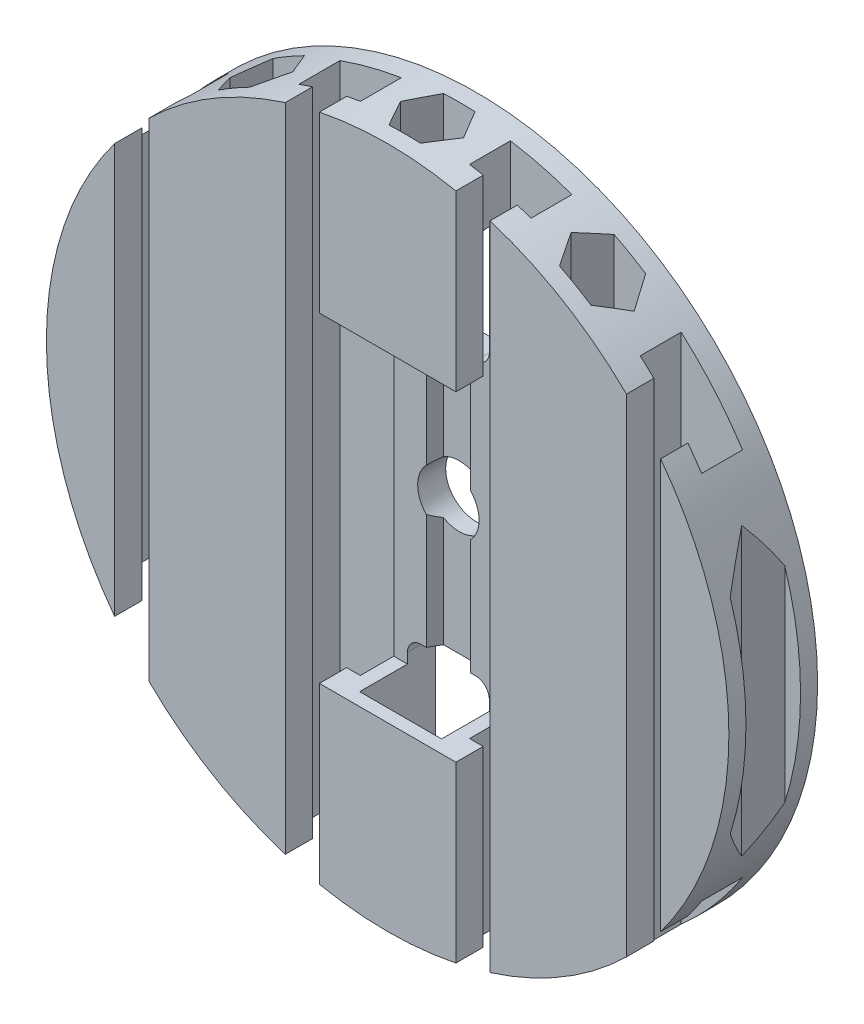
ISO-10303-21;
HEADER;
FILE_DESCRIPTION(('STEP AP214'),'2;1');
FILE_NAME('part.step','',(''),(''),'','','');
FILE_SCHEMA(('AUTOMOTIVE_DESIGN { 1 0 10303 214 1 1 1 1 }'));
ENDSEC;
DATA;
#1=APPLICATION_CONTEXT('core data for automotive mechanical design processes');
#2=APPLICATION_PROTOCOL_DEFINITION('international standard','automotive_design',2000,#1);
#3=PRODUCT_CONTEXT('',#1,'mechanical');
#4=PRODUCT('Part','Part','',(#3));
#5=PRODUCT_RELATED_PRODUCT_CATEGORY('part','',(#4));
#6=PRODUCT_DEFINITION_FORMATION('','',#4);
#7=PRODUCT_DEFINITION_CONTEXT('part definition',#1,'design');
#8=PRODUCT_DEFINITION('design','',#6,#7);
#9=PRODUCT_DEFINITION_SHAPE('','',#8);
#10=(LENGTH_UNIT() NAMED_UNIT(*) SI_UNIT(.MILLI.,.METRE.));
#11=(NAMED_UNIT(*) PLANE_ANGLE_UNIT() SI_UNIT($,.RADIAN.));
#12=(NAMED_UNIT(*) SI_UNIT($,.STERADIAN.) SOLID_ANGLE_UNIT());
#13=UNCERTAINTY_MEASURE_WITH_UNIT(LENGTH_MEASURE(1.E-05),#10,'distance_accuracy_value','');
#14=(GEOMETRIC_REPRESENTATION_CONTEXT(3) GLOBAL_UNCERTAINTY_ASSIGNED_CONTEXT((#13)) GLOBAL_UNIT_ASSIGNED_CONTEXT((#10,
#11,#12)) REPRESENTATION_CONTEXT('',''));
#15=CARTESIAN_POINT('',(0.,0.,0.));
#16=DIRECTION('',(0.,0.,1.));
#17=DIRECTION('',(1.,0.,0.));
#18=AXIS2_PLACEMENT_3D('',#15,#16,#17);
#19=CARTESIAN_POINT('',(0.,0.,4.1));
#20=DIRECTION('',(0.,0.,1.));
#21=DIRECTION('',(1.,0.,0.));
#22=AXIS2_PLACEMENT_3D('',#19,#20,#21);
#23=PLANE('',#22);
#24=DIRECTION('',(0.,1.,0.));
#25=VECTOR('',#24,1.);
#26=CARTESIAN_POINT('',(6.,-22.,4.1));
#27=LINE('',#26,#25);
#28=CARTESIAN_POINT('',(6.,-23.5,4.1));
#29=VERTEX_POINT('',#28);
#30=CARTESIAN_POINT('',(6.,-22.,4.1));
#31=VERTEX_POINT('',#30);
#32=EDGE_CURVE('E70',#29,#31,#27,.T.);
#33=ORIENTED_EDGE('',*,*,#32,.F.);
#34=DIRECTION('',(-1.,0.,0.));
#35=VECTOR('',#34,1.);
#36=CARTESIAN_POINT('',(8.00000000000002,-23.5,4.1));
#37=LINE('',#36,#35);
#38=CARTESIAN_POINT('',(8.,-23.5,4.1));
#39=VERTEX_POINT('',#38);
#40=EDGE_CURVE('E2401',#39,#29,#37,.T.);
#41=ORIENTED_EDGE('',*,*,#40,.F.);
#42=DIRECTION('',(0.,1.,0.));
#43=VECTOR('',#42,1.);
#44=CARTESIAN_POINT('',(8.,-148.421931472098,4.1));
#45=LINE('',#44,#43);
#46=CARTESIAN_POINT('',(8.,40.,4.1));
#47=VERTEX_POINT('',#46);
#48=EDGE_CURVE('E1547',#39,#47,#45,.T.);
#49=ORIENTED_EDGE('',*,*,#48,.T.);
#50=DIRECTION('',(-1.,0.,0.));
#51=VECTOR('',#50,1.);
#52=CARTESIAN_POINT('',(25.9234483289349,40.,4.1));
#53=LINE('',#52,#51);
#54=CARTESIAN_POINT('',(4.,40.,4.1));
#55=VERTEX_POINT('',#54);
#56=EDGE_CURVE('E1403',#47,#55,#53,.T.);
#57=ORIENTED_EDGE('',*,*,#56,.T.);
#58=CARTESIAN_POINT('',(4.,38.,4.1));
#59=DIRECTION('',(0.,0.,-1.));
#60=DIRECTION('',(1.,0.,0.));
#61=AXIS2_PLACEMENT_3D('',#58,#59,#60);
#62=CIRCLE('',#61,2.);
#63=CARTESIAN_POINT('',(6.,38.,4.1));
#64=VERTEX_POINT('',#63);
#65=EDGE_CURVE('E1337',#55,#64,#62,.T.);
#66=ORIENTED_EDGE('',*,*,#65,.T.);
#67=DIRECTION('',(0.,-1.,0.));
#68=VECTOR('',#67,1.);
#69=CARTESIAN_POINT('',(6.,22.,4.1));
#70=LINE('',#69,#68);
#71=CARTESIAN_POINT('',(6.,22.,4.1));
#72=VERTEX_POINT('',#71);
#73=EDGE_CURVE('E1333',#64,#72,#70,.T.);
#74=ORIENTED_EDGE('',*,*,#73,.T.);
#75=CARTESIAN_POINT('',(4.,22.,4.1));
#76=DIRECTION('',(0.,0.,-1.));
#77=DIRECTION('',(-1.,0.,0.));
#78=AXIS2_PLACEMENT_3D('',#75,#76,#77);
#79=CIRCLE('',#78,2.);
#80=CARTESIAN_POINT('',(4.,20.,4.1));
#81=VERTEX_POINT('',#80);
#82=EDGE_CURVE('E1329',#72,#81,#79,.T.);
#83=ORIENTED_EDGE('',*,*,#82,.T.);
#84=DIRECTION('',(-1.,0.,0.));
#85=VECTOR('',#84,1.);
#86=CARTESIAN_POINT('',(-4.,20.,4.1));
#87=LINE('',#86,#85);
#88=CARTESIAN_POINT('',(3.2331615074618,20.,4.1));
#89=VERTEX_POINT('',#88);
#90=EDGE_CURVE('E1325',#81,#89,#87,.T.);
#91=ORIENTED_EDGE('',*,*,#90,.T.);
#92=DIRECTION('',(0.,1.,0.));
#93=VECTOR('',#92,1.);
#94=CARTESIAN_POINT('',(3.2331615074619,0.,4.1));
#95=LINE('',#94,#93);
#96=CARTESIAN_POINT('',(3.23316150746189,3.12996272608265,4.1));
#97=VERTEX_POINT('',#96);
#98=EDGE_CURVE('E1217',#97,#89,#95,.T.);
#99=ORIENTED_EDGE('',*,*,#98,.F.);
#100=CARTESIAN_POINT('',(0.,0.,4.1));
#101=DIRECTION('',(0.,0.,1.));
#102=DIRECTION('',(1.,0.,0.));
#103=AXIS2_PLACEMENT_3D('',#100,#101,#102);
#104=CIRCLE('',#103,4.5);
#105=CARTESIAN_POINT('',(3.23316150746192,-3.12996272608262,4.1));
#106=VERTEX_POINT('',#105);
#107=EDGE_CURVE('E986',#97,#106,#104,.F.);
#108=ORIENTED_EDGE('',*,*,#107,.T.);
#109=CARTESIAN_POINT('',(3.23316150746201,-20.,4.1));
#110=VERTEX_POINT('',#109);
#111=EDGE_CURVE('E1221',#110,#106,#95,.T.);
#112=ORIENTED_EDGE('',*,*,#111,.F.);
#113=DIRECTION('',(-1.,0.,0.));
#114=VECTOR('',#113,1.);
#115=CARTESIAN_POINT('',(-4.,-20.,4.1));
#116=LINE('',#115,#114);
#117=CARTESIAN_POINT('',(4.,-20.,4.1));
#118=VERTEX_POINT('',#117);
#119=EDGE_CURVE('E1462',#118,#110,#116,.T.);
#120=ORIENTED_EDGE('',*,*,#119,.F.);
#121=CARTESIAN_POINT('',(4.,-22.,4.1));
#122=DIRECTION('',(0.,0.,1.));
#123=DIRECTION('',(-1.,0.,0.));
#124=AXIS2_PLACEMENT_3D('',#121,#122,#123);
#125=CIRCLE('',#124,2.);
#126=EDGE_CURVE('E1457',#31,#118,#125,.T.);
#127=ORIENTED_EDGE('',*,*,#126,.F.);
#128=EDGE_LOOP('',(#33,#41,#49,#57,#66,#74,#83,#91,#99,#108,#112,#120,#127));
#129=FACE_BOUND('',#128,.T.);
#130=ADVANCED_FACE('F53',(#129),#23,.T.);
#131=DIRECTION('',(-1.,0.,0.));
#132=VECTOR('',#131,1.);
#133=CARTESIAN_POINT('',(-8.,-23.5,4.1));
#134=LINE('',#133,#132);
#135=CARTESIAN_POINT('',(-6.,-23.5,4.1));
#136=VERTEX_POINT('',#135);
#137=CARTESIAN_POINT('',(-8.,-23.5,4.1));
#138=VERTEX_POINT('',#137);
#139=EDGE_CURVE('E2408',#136,#138,#134,.T.);
#140=ORIENTED_EDGE('',*,*,#139,.F.);
#141=DIRECTION('',(0.,-1.,0.));
#142=VECTOR('',#141,1.);
#143=CARTESIAN_POINT('',(-6.,-22.,4.1));
#144=LINE('',#143,#142);
#145=CARTESIAN_POINT('',(-6.,-22.,4.1));
#146=VERTEX_POINT('',#145);
#147=EDGE_CURVE('E1470',#146,#136,#144,.T.);
#148=ORIENTED_EDGE('',*,*,#147,.F.);
#149=CARTESIAN_POINT('',(-4.,-22.,4.1));
#150=DIRECTION('',(0.,0.,1.));
#151=DIRECTION('',(1.,0.,0.));
#152=AXIS2_PLACEMENT_3D('',#149,#150,#151);
#153=CIRCLE('',#152,2.);
#154=CARTESIAN_POINT('',(-4.,-20.,4.1));
#155=VERTEX_POINT('',#154);
#156=EDGE_CURVE('E1466',#155,#146,#153,.T.);
#157=ORIENTED_EDGE('',*,*,#156,.F.);
#158=CARTESIAN_POINT('',(-3.2331615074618,-20.,4.1));
#159=VERTEX_POINT('',#158);
#160=EDGE_CURVE('E1461',#159,#155,#116,.T.);
#161=ORIENTED_EDGE('',*,*,#160,.F.);
#162=DIRECTION('',(0.,-1.,0.));
#163=VECTOR('',#162,1.);
#164=CARTESIAN_POINT('',(-3.2331615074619,0.,4.1));
#165=LINE('',#164,#163);
#166=CARTESIAN_POINT('',(-3.23316150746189,-3.12996272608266,4.1));
#167=VERTEX_POINT('',#166);
#168=EDGE_CURVE('E1249',#167,#159,#165,.T.);
#169=ORIENTED_EDGE('',*,*,#168,.F.);
#170=CARTESIAN_POINT('',(-3.23316150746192,3.12996272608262,4.1));
#171=VERTEX_POINT('',#170);
#172=EDGE_CURVE('E990',#167,#171,#104,.F.);
#173=ORIENTED_EDGE('',*,*,#172,.T.);
#174=CARTESIAN_POINT('',(-3.23316150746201,20.,4.1));
#175=VERTEX_POINT('',#174);
#176=EDGE_CURVE('E1245',#175,#171,#165,.T.);
#177=ORIENTED_EDGE('',*,*,#176,.F.);
#178=CARTESIAN_POINT('',(-4.,20.,4.1));
#179=VERTEX_POINT('',#178);
#180=EDGE_CURVE('E1324',#175,#179,#87,.T.);
#181=ORIENTED_EDGE('',*,*,#180,.T.);
#182=CARTESIAN_POINT('',(-4.,22.,4.1));
#183=DIRECTION('',(0.,0.,-1.));
#184=DIRECTION('',(1.,0.,0.));
#185=AXIS2_PLACEMENT_3D('',#182,#183,#184);
#186=CIRCLE('',#185,2.);
#187=CARTESIAN_POINT('',(-6.,22.,4.1));
#188=VERTEX_POINT('',#187);
#189=EDGE_CURVE('E1320',#179,#188,#186,.T.);
#190=ORIENTED_EDGE('',*,*,#189,.T.);
#191=DIRECTION('',(0.,1.,0.));
#192=VECTOR('',#191,1.);
#193=CARTESIAN_POINT('',(-6.,22.,4.1));
#194=LINE('',#193,#192);
#195=CARTESIAN_POINT('',(-6.,38.,4.1));
#196=VERTEX_POINT('',#195);
#197=EDGE_CURVE('E1316',#188,#196,#194,.T.);
#198=ORIENTED_EDGE('',*,*,#197,.T.);
#199=CARTESIAN_POINT('',(-4.,38.,4.1));
#200=DIRECTION('',(0.,0.,-1.));
#201=DIRECTION('',(1.,0.,0.));
#202=AXIS2_PLACEMENT_3D('',#199,#200,#201);
#203=CIRCLE('',#202,2.00000000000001);
#204=CARTESIAN_POINT('',(-4.,40.,4.1));
#205=VERTEX_POINT('',#204);
#206=EDGE_CURVE('E1312',#196,#205,#203,.T.);
#207=ORIENTED_EDGE('',*,*,#206,.T.);
#208=CARTESIAN_POINT('',(-8.,40.,4.1));
#209=VERTEX_POINT('',#208);
#210=EDGE_CURVE('E1407',#205,#209,#53,.T.);
#211=ORIENTED_EDGE('',*,*,#210,.T.);
#212=DIRECTION('',(0.,-1.,0.));
#213=VECTOR('',#212,1.);
#214=CARTESIAN_POINT('',(-8.,-148.421931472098,4.1));
#215=LINE('',#214,#213);
#216=EDGE_CURVE('E1550',#209,#138,#215,.T.);
#217=ORIENTED_EDGE('',*,*,#216,.T.);
#218=EDGE_LOOP('',(#140,#148,#157,#161,#169,#173,#177,#181,#190,#198,#207,#211,#217));
#219=FACE_BOUND('',#218,.T.);
#220=ADVANCED_FACE('F2348',(#219),#23,.T.);
#221=CARTESIAN_POINT('',(-2.30940107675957,201.579068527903,2.5));
#222=DIRECTION('',(0.,0.,-1.));
#223=DIRECTION('',(-1.,0.,0.));
#224=AXIS2_PLACEMENT_3D('',#221,#222,#223);
#225=PLANE('',#224);
#226=DIRECTION('',(0.,-1.,0.));
#227=VECTOR('',#226,1.);
#228=CARTESIAN_POINT('',(2.30940107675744,201.579068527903,2.5));
#229=LINE('',#228,#227);
#230=CARTESIAN_POINT('',(2.30940107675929,20.,2.5));
#231=VERTEX_POINT('',#230);
#232=CARTESIAN_POINT('',(2.30940107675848,3.86221007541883,2.5));
#233=VERTEX_POINT('',#232);
#234=EDGE_CURVE('E1195',#231,#233,#229,.T.);
#235=ORIENTED_EDGE('',*,*,#234,.F.);
#236=DIRECTION('',(-1.,0.,0.));
#237=VECTOR('',#236,1.);
#238=CARTESIAN_POINT('',(-4.,20.,2.5));
#239=LINE('',#238,#237);
#240=CARTESIAN_POINT('',(-2.30940107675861,20.,2.5));
#241=VERTEX_POINT('',#240);
#242=EDGE_CURVE('E999',#231,#241,#239,.T.);
#243=ORIENTED_EDGE('',*,*,#242,.T.);
#244=DIRECTION('',(0.,-1.,0.));
#245=VECTOR('',#244,1.);
#246=CARTESIAN_POINT('',(-2.30940107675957,201.579068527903,2.5));
#247=LINE('',#246,#245);
#248=CARTESIAN_POINT('',(-2.30940107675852,3.86221007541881,2.5));
#249=VERTEX_POINT('',#248);
#250=EDGE_CURVE('E1200',#241,#249,#247,.T.);
#251=ORIENTED_EDGE('',*,*,#250,.T.);
#252=CARTESIAN_POINT('',(0.,0.,2.5));
#253=DIRECTION('',(0.,0.,-1.));
#254=DIRECTION('',(-1.,0.,0.));
#255=AXIS2_PLACEMENT_3D('',#252,#253,#254);
#256=CIRCLE('',#255,4.5);
#257=EDGE_CURVE('E1212',#233,#249,#256,.F.);
#258=ORIENTED_EDGE('',*,*,#257,.F.);
#259=EDGE_LOOP('',(#235,#243,#251,#258));
#260=FACE_BOUND('',#259,.T.);
#261=ADVANCED_FACE('F2355',(#260),#225,.F.);
#262=CARTESIAN_POINT('',(-2.30940107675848,-3.86221007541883,2.5));
#263=VERTEX_POINT('',#262);
#264=CARTESIAN_POINT('',(-2.30940107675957,-20.,2.5));
#265=VERTEX_POINT('',#264);
#266=EDGE_CURVE('E2215',#263,#265,#247,.T.);
#267=ORIENTED_EDGE('',*,*,#266,.T.);
#268=DIRECTION('',(-1.,0.,0.));
#269=VECTOR('',#268,1.);
#270=CARTESIAN_POINT('',(-4.,-20.,2.5));
#271=LINE('',#270,#269);
#272=CARTESIAN_POINT('',(2.30940107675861,-20.,2.5));
#273=VERTEX_POINT('',#272);
#274=EDGE_CURVE('E1204',#273,#265,#271,.T.);
#275=ORIENTED_EDGE('',*,*,#274,.F.);
#276=CARTESIAN_POINT('',(2.30940107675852,-3.86221007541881,2.5));
#277=VERTEX_POINT('',#276);
#278=EDGE_CURVE('E2208',#277,#273,#229,.T.);
#279=ORIENTED_EDGE('',*,*,#278,.F.);
#280=EDGE_CURVE('E1216',#263,#277,#256,.F.);
#281=ORIENTED_EDGE('',*,*,#280,.F.);
#282=EDGE_LOOP('',(#267,#275,#279,#281));
#283=FACE_BOUND('',#282,.T.);
#284=ADVANCED_FACE('F2775',(#283),#225,.F.);
#285=CARTESIAN_POINT('',(-4.61880215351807,201.579068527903,6.5));
#286=DIRECTION('',(-0.866025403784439,0.,-0.5));
#287=DIRECTION('',(-0.5,0.,0.866025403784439));
#288=AXIS2_PLACEMENT_3D('',#285,#286,#287);
#289=PLANE('',#288);
#290=ORIENTED_EDGE('',*,*,#168,.T.);
#291=DIRECTION('',(-0.5,0.,0.866025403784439));
#292=VECTOR('',#291,1.);
#293=CARTESIAN_POINT('',(0.515977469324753,-20.,-2.3936991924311));
#294=LINE('',#293,#292);
#295=EDGE_CURVE('E1261',#265,#159,#294,.T.);
#296=ORIENTED_EDGE('',*,*,#295,.F.);
#297=ORIENTED_EDGE('',*,*,#266,.F.);
#298=CARTESIAN_POINT('',(0.,0.,-1.5));
#299=DIRECTION('',(-0.866025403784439,0.,-0.5));
#300=DIRECTION('',(0.5,0.,-0.866025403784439));
#301=AXIS2_PLACEMENT_3D('',#298,#299,#300);
#302=ELLIPSE('',#301,9.,4.5);
#303=EDGE_CURVE('E1254',#167,#263,#302,.F.);
#304=ORIENTED_EDGE('',*,*,#303,.F.);
#305=EDGE_LOOP('',(#290,#296,#297,#304));
#306=FACE_BOUND('',#305,.T.);
#307=ADVANCED_FACE('F2778',(#306),#289,.F.);
#308=ORIENTED_EDGE('',*,*,#250,.F.);
#309=DIRECTION('',(-0.5,0.,0.866025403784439));
#310=VECTOR('',#309,1.);
#311=CARTESIAN_POINT('',(0.515977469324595,20.,-2.39369919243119));
#312=LINE('',#311,#310);
#313=EDGE_CURVE('E1006',#241,#175,#312,.T.);
#314=ORIENTED_EDGE('',*,*,#313,.T.);
#315=ORIENTED_EDGE('',*,*,#176,.T.);
#316=EDGE_CURVE('E1248',#249,#171,#302,.F.);
#317=ORIENTED_EDGE('',*,*,#316,.F.);
#318=EDGE_LOOP('',(#308,#314,#315,#317));
#319=FACE_BOUND('',#318,.T.);
#320=ADVANCED_FACE('F2785',(#319),#289,.F.);
#321=CARTESIAN_POINT('',(2.30940107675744,201.579068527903,2.5));
#322=DIRECTION('',(0.866025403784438,0.,-0.5));
#323=DIRECTION('',(-0.5,0.,-0.866025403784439));
#324=AXIS2_PLACEMENT_3D('',#321,#322,#323);
#325=PLANE('',#324);
#326=ORIENTED_EDGE('',*,*,#98,.T.);
#327=DIRECTION('',(-0.5,0.,-0.866025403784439));
#328=VECTOR('',#327,1.);
#329=CARTESIAN_POINT('',(-2.51597746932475,20.,-5.85780080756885));
#330=LINE('',#329,#328);
#331=EDGE_CURVE('E1002',#89,#231,#330,.T.);
#332=ORIENTED_EDGE('',*,*,#331,.T.);
#333=ORIENTED_EDGE('',*,*,#234,.T.);
#334=CARTESIAN_POINT('',(0.,0.,-1.5));
#335=DIRECTION('',(0.866025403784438,0.,-0.5));
#336=DIRECTION('',(-0.5,0.,-0.866025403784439));
#337=AXIS2_PLACEMENT_3D('',#334,#335,#336);
#338=ELLIPSE('',#337,9.,4.5);
#339=EDGE_CURVE('E1220',#97,#233,#338,.F.);
#340=ORIENTED_EDGE('',*,*,#339,.F.);
#341=EDGE_LOOP('',(#326,#332,#333,#340));
#342=FACE_BOUND('',#341,.T.);
#343=ADVANCED_FACE('F2774',(#342),#325,.F.);
#344=ORIENTED_EDGE('',*,*,#278,.T.);
#345=DIRECTION('',(-0.5,0.,-0.866025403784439));
#346=VECTOR('',#345,1.);
#347=CARTESIAN_POINT('',(-2.51597746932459,-20.,-5.85780080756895));
#348=LINE('',#347,#346);
#349=EDGE_CURVE('E1233',#110,#273,#348,.T.);
#350=ORIENTED_EDGE('',*,*,#349,.F.);
#351=ORIENTED_EDGE('',*,*,#111,.T.);
#352=EDGE_CURVE('E1226',#277,#106,#338,.F.);
#353=ORIENTED_EDGE('',*,*,#352,.F.);
#354=EDGE_LOOP('',(#344,#350,#351,#353));
#355=FACE_BOUND('',#354,.T.);
#356=ADVANCED_FACE('F2825',(#355),#325,.F.);
#357=CARTESIAN_POINT('',(25.9234483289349,23.5,11.1));
#358=DIRECTION('',(0.,0.,-1.));
#359=DIRECTION('',(0.,1.,0.));
#360=AXIS2_PLACEMENT_3D('',#357,#358,#359);
#361=PLANE('',#360);
#362=DIRECTION('',(-1.,0.,0.));
#363=VECTOR('',#362,1.);
#364=CARTESIAN_POINT('',(25.9234483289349,23.5,11.1));
#365=LINE('',#364,#363);
#366=CARTESIAN_POINT('',(8.,23.5,11.1));
#367=VERTEX_POINT('',#366);
#368=CARTESIAN_POINT('',(-8.,23.5,11.1));
#369=VERTEX_POINT('',#368);
#370=EDGE_CURVE('E1402',#367,#369,#365,.T.);
#371=ORIENTED_EDGE('',*,*,#370,.T.);
#372=DIRECTION('',(0.,-1.,0.));
#373=VECTOR('',#372,1.);
#374=CARTESIAN_POINT('',(-8.,23.5,11.1));
#375=LINE('',#374,#373);
#376=CARTESIAN_POINT('',(-8.,35.,11.1));
#377=VERTEX_POINT('',#376);
#378=EDGE_CURVE('E1389',#377,#369,#375,.T.);
#379=ORIENTED_EDGE('',*,*,#378,.F.);
#380=DIRECTION('',(-1.,0.,0.));
#381=VECTOR('',#380,1.);
#382=CARTESIAN_POINT('',(25.9234483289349,35.,11.1));
#383=LINE('',#382,#381);
#384=CARTESIAN_POINT('',(8.,35.,11.1));
#385=VERTEX_POINT('',#384);
#386=EDGE_CURVE('E1413',#385,#377,#383,.T.);
#387=ORIENTED_EDGE('',*,*,#386,.F.);
#388=DIRECTION('',(0.,1.,0.));
#389=VECTOR('',#388,1.);
#390=CARTESIAN_POINT('',(8.,23.5,11.1));
#391=LINE('',#390,#389);
#392=EDGE_CURVE('E1372',#367,#385,#391,.T.);
#393=ORIENTED_EDGE('',*,*,#392,.F.);
#394=EDGE_LOOP('',(#371,#379,#387,#393));
#395=FACE_BOUND('',#394,.T.);
#396=ADVANCED_FACE('F2170',(#395),#361,.T.);
#397=CARTESIAN_POINT('',(25.9234483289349,-23.5,11.1));
#398=DIRECTION('',(0.,0.,1.));
#399=DIRECTION('',(0.,-1.,0.));
#400=AXIS2_PLACEMENT_3D('',#397,#398,#399);
#401=PLANE('',#400);
#402=DIRECTION('',(-1.,0.,0.));
#403=VECTOR('',#402,1.);
#404=CARTESIAN_POINT('',(25.9234483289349,-23.5,11.1));
#405=LINE('',#404,#403);
#406=CARTESIAN_POINT('',(6.00000000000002,-23.5,11.1));
#407=VERTEX_POINT('',#406);
#408=CARTESIAN_POINT('',(-6.,-23.5,11.1));
#409=VERTEX_POINT('',#408);
#410=EDGE_CURVE('E78',#407,#409,#405,.T.);
#411=ORIENTED_EDGE('',*,*,#410,.F.);
#412=DIRECTION('',(0.,1.,0.));
#413=VECTOR('',#412,1.);
#414=CARTESIAN_POINT('',(6.00000000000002,-47.2801098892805,11.1));
#415=LINE('',#414,#413);
#416=CARTESIAN_POINT('',(6.00000000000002,-35.,11.1));
#417=VERTEX_POINT('',#416);
#418=EDGE_CURVE('E2391',#417,#407,#415,.T.);
#419=ORIENTED_EDGE('',*,*,#418,.F.);
#420=DIRECTION('',(-1.,0.,0.));
#421=VECTOR('',#420,1.);
#422=CARTESIAN_POINT('',(25.9234483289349,-35.,11.1));
#423=LINE('',#422,#421);
#424=CARTESIAN_POINT('',(-6.,-35.,11.1));
#425=VERTEX_POINT('',#424);
#426=EDGE_CURVE('E1511',#417,#425,#423,.T.);
#427=ORIENTED_EDGE('',*,*,#426,.T.);
#428=DIRECTION('',(0.,1.,0.));
#429=VECTOR('',#428,1.);
#430=CARTESIAN_POINT('',(-5.99999999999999,-47.2801098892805,11.1));
#431=LINE('',#430,#429);
#432=EDGE_CURVE('E2412',#425,#409,#431,.T.);
#433=ORIENTED_EDGE('',*,*,#432,.T.);
#434=EDGE_LOOP('',(#411,#419,#427,#433));
#435=FACE_BOUND('',#434,.T.);
#436=ADVANCED_FACE('F2824',(#435),#401,.F.);
#437=CARTESIAN_POINT('',(22.6905989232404,201.579068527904,2.5));
#438=DIRECTION('',(0.,0.,-1.));
#439=DIRECTION('',(-1.,0.,0.));
#440=AXIS2_PLACEMENT_3D('',#437,#438,#439);
#441=PLANE('',#440);
#442=DIRECTION('',(0.,-1.,0.));
#443=VECTOR('',#442,1.);
#444=CARTESIAN_POINT('',(22.6905989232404,201.579068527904,2.5));
#445=LINE('',#444,#443);
#446=CARTESIAN_POINT('',(22.6905989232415,-2.85564303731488,2.5));
#447=VERTEX_POINT('',#446);
#448=CARTESIAN_POINT('',(22.690598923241,-18.9862199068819,2.5));
#449=VERTEX_POINT('',#448);
#450=EDGE_CURVE('E2242',#447,#449,#445,.T.);
#451=ORIENTED_EDGE('',*,*,#450,.T.);
#452=CARTESIAN_POINT('',(25.0000000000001,-23.4209314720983,2.5));
#453=DIRECTION('',(0.,0.,1.));
#454=DIRECTION('',(1.,0.,0.));
#455=AXIS2_PLACEMENT_3D('',#452,#453,#454);
#456=CIRCLE('',#455,5.);
#457=CARTESIAN_POINT('',(27.309401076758,-18.9862199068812,2.5));
#458=VERTEX_POINT('',#457);
#459=EDGE_CURVE('E1722',#458,#449,#456,.T.);
#460=ORIENTED_EDGE('',*,*,#459,.F.);
#461=DIRECTION('',(0.,-1.,0.));
#462=VECTOR('',#461,1.);
#463=CARTESIAN_POINT('',(27.3094010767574,201.579068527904,2.5));
#464=LINE('',#463,#462);
#465=CARTESIAN_POINT('',(27.309401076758,-2.85564303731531,2.5));
#466=VERTEX_POINT('',#465);
#467=EDGE_CURVE('E2235',#466,#458,#464,.T.);
#468=ORIENTED_EDGE('',*,*,#467,.F.);
#469=CARTESIAN_POINT('',(25.0000000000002,1.57906852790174,2.5));
#470=DIRECTION('',(0.,0.,1.));
#471=DIRECTION('',(1.,0.,0.));
#472=AXIS2_PLACEMENT_3D('',#469,#470,#471);
#473=CIRCLE('',#472,5.);
#474=EDGE_CURVE('E1761',#447,#466,#473,.T.);
#475=ORIENTED_EDGE('',*,*,#474,.F.);
#476=EDGE_LOOP('',(#451,#460,#468,#475));
#477=FACE_BOUND('',#476,.T.);
#478=ADVANCED_FACE('F2304',(#477),#441,.F.);
#479=CARTESIAN_POINT('',(25.0000000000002,1.57906852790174,6.5));
#480=DIRECTION('',(0.,0.,-1.));
#481=DIRECTION('',(1.,0.,0.));
#482=AXIS2_PLACEMENT_3D('',#479,#480,#481);
#483=CYLINDRICAL_SURFACE('',#482,5.);
#484=CARTESIAN_POINT('',(25.0000000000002,1.57906852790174,2.));
#485=DIRECTION('',(0.,0.,1.));
#486=DIRECTION('',(1.,0.,0.));
#487=AXIS2_PLACEMENT_3D('',#484,#485,#486);
#488=CIRCLE('',#487,5.);
#489=CARTESIAN_POINT('',(30.0000000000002,1.57906852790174,2.));
#490=VERTEX_POINT('',#489);
#491=EDGE_CURVE('E1760',#490,#490,#488,.T.);
#492=ORIENTED_EDGE('',*,*,#491,.F.);
#493=EDGE_LOOP('',(#492));
#494=FACE_BOUND('',#493,.T.);
#495=CARTESIAN_POINT('',(27.309401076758,6.01378009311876,2.5));
#496=VERTEX_POINT('',#495);
#497=CARTESIAN_POINT('',(22.690598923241,6.01378009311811,2.5));
#498=VERTEX_POINT('',#497);
#499=EDGE_CURVE('E1756',#496,#498,#473,.T.);
#500=ORIENTED_EDGE('',*,*,#499,.T.);
#501=CARTESIAN_POINT('',(25.0000000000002,1.57906852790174,-1.50000000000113));
#502=DIRECTION('',(0.866025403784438,0.,0.5));
#503=DIRECTION('',(0.5,0.,-0.866025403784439));
#504=AXIS2_PLACEMENT_3D('',#501,#502,#503);
#505=ELLIPSE('',#504,10.,5.);
#506=CARTESIAN_POINT('',(20.3811978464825,3.49392274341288,6.5));
#507=VERTEX_POINT('',#506);
#508=EDGE_CURVE('E1776',#498,#507,#505,.T.);
#509=ORIENTED_EDGE('',*,*,#508,.T.);
#510=CARTESIAN_POINT('',(25.0000000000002,1.57906852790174,6.5));
#511=DIRECTION('',(0.,0.,1.));
#512=DIRECTION('',(1.,0.,0.));
#513=AXIS2_PLACEMENT_3D('',#510,#511,#512);
#514=CIRCLE('',#513,5.);
#515=CARTESIAN_POINT('',(20.3811978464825,-0.335785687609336,6.5));
#516=VERTEX_POINT('',#515);
#517=EDGE_CURVE('E1772',#507,#516,#514,.T.);
#518=ORIENTED_EDGE('',*,*,#517,.T.);
#519=EDGE_CURVE('E1773',#516,#447,#505,.T.);
#520=ORIENTED_EDGE('',*,*,#519,.T.);
#521=ORIENTED_EDGE('',*,*,#474,.T.);
#522=CARTESIAN_POINT('',(25.0000000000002,1.57906852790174,-1.49999999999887));
#523=DIRECTION('',(-0.866025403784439,0.,0.5));
#524=DIRECTION('',(-0.5,0.,-0.866025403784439));
#525=AXIS2_PLACEMENT_3D('',#522,#523,#524);
#526=ELLIPSE('',#525,10.,5.);
#527=CARTESIAN_POINT('',(29.6188021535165,-0.335785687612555,6.5));
#528=VERTEX_POINT('',#527);
#529=EDGE_CURVE('E1769',#466,#528,#526,.T.);
#530=ORIENTED_EDGE('',*,*,#529,.T.);
#531=CARTESIAN_POINT('',(29.6188021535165,3.49392274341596,6.5));
#532=VERTEX_POINT('',#531);
#533=EDGE_CURVE('E1768',#528,#532,#514,.T.);
#534=ORIENTED_EDGE('',*,*,#533,.T.);
#535=EDGE_CURVE('E1765',#532,#496,#526,.T.);
#536=ORIENTED_EDGE('',*,*,#535,.T.);
#537=EDGE_LOOP('',(#500,#509,#518,#520,#521,#530,#534,#536));
#538=FACE_BOUND('',#537,.T.);
#539=ADVANCED_FACE('F2297',(#494,#538),#483,.F.);
#540=CARTESIAN_POINT('',(22.6905989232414,22.1443569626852,2.5));
#541=VERTEX_POINT('',#540);
#542=EDGE_CURVE('E1160',#541,#498,#445,.T.);
#543=ORIENTED_EDGE('',*,*,#542,.T.);
#544=ORIENTED_EDGE('',*,*,#499,.F.);
#545=CARTESIAN_POINT('',(27.309401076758,22.1443569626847,2.5));
#546=VERTEX_POINT('',#545);
#547=EDGE_CURVE('E1155',#546,#496,#464,.T.);
#548=ORIENTED_EDGE('',*,*,#547,.F.);
#549=CARTESIAN_POINT('',(25.0000000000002,26.5790685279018,2.5));
#550=DIRECTION('',(0.,0.,1.));
#551=DIRECTION('',(1.,0.,0.));
#552=AXIS2_PLACEMENT_3D('',#549,#550,#551);
#553=CIRCLE('',#552,5.);
#554=EDGE_CURVE('E1792',#541,#546,#553,.T.);
#555=ORIENTED_EDGE('',*,*,#554,.F.);
#556=EDGE_LOOP('',(#543,#544,#548,#555));
#557=FACE_BOUND('',#556,.T.);
#558=ADVANCED_FACE('F2324',(#557),#441,.F.);
#559=CARTESIAN_POINT('',(-27.3094010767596,201.579068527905,2.5));
#560=DIRECTION('',(0.,0.,-1.));
#561=DIRECTION('',(-1.,0.,0.));
#562=AXIS2_PLACEMENT_3D('',#559,#560,#561);
#563=PLANE('',#562);
#564=DIRECTION('',(0.,-1.,0.));
#565=VECTOR('',#564,1.);
#566=CARTESIAN_POINT('',(-22.6905989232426,201.579068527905,2.5));
#567=LINE('',#566,#565);
#568=CARTESIAN_POINT('',(-22.6905989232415,-2.85564303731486,2.5));
#569=VERTEX_POINT('',#568);
#570=CARTESIAN_POINT('',(-22.6905989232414,-18.9862199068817,2.5));
#571=VERTEX_POINT('',#570);
#572=EDGE_CURVE('E3981',#569,#571,#567,.T.);
#573=ORIENTED_EDGE('',*,*,#572,.F.);
#574=CARTESIAN_POINT('',(-25.0000000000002,1.57906852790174,2.5));
#575=DIRECTION('',(0.,0.,-1.));
#576=DIRECTION('',(-1.,0.,0.));
#577=AXIS2_PLACEMENT_3D('',#574,#575,#576);
#578=CIRCLE('',#577,5.);
#579=CARTESIAN_POINT('',(-27.3094010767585,-2.85564303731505,2.5));
#580=VERTEX_POINT('',#579);
#581=EDGE_CURVE('E1026',#569,#580,#578,.T.);
#582=ORIENTED_EDGE('',*,*,#581,.T.);
#583=DIRECTION('',(0.,-1.,0.));
#584=VECTOR('',#583,1.);
#585=CARTESIAN_POINT('',(-27.3094010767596,201.579068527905,2.5));
#586=LINE('',#585,#584);
#587=CARTESIAN_POINT('',(-27.3094010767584,-18.9862199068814,2.5));
#588=VERTEX_POINT('',#587);
#589=EDGE_CURVE('E1909',#580,#588,#586,.T.);
#590=ORIENTED_EDGE('',*,*,#589,.T.);
#591=CARTESIAN_POINT('',(-25.0000000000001,-23.4209314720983,2.5));
#592=DIRECTION('',(0.,0.,-1.));
#593=DIRECTION('',(-1.,0.,0.));
#594=AXIS2_PLACEMENT_3D('',#591,#592,#593);
#595=CIRCLE('',#594,5.);
#596=EDGE_CURVE('E1025',#588,#571,#595,.T.);
#597=ORIENTED_EDGE('',*,*,#596,.T.);
#598=EDGE_LOOP('',(#573,#582,#590,#597));
#599=FACE_BOUND('',#598,.T.);
#600=ADVANCED_FACE('F2649',(#599),#563,.F.);
#601=CARTESIAN_POINT('',(-25.0000000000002,1.57906852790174,6.5));
#602=DIRECTION('',(0.,0.,-1.));
#603=DIRECTION('',(-1.,0.,0.));
#604=AXIS2_PLACEMENT_3D('',#601,#602,#603);
#605=CYLINDRICAL_SURFACE('',#604,5.);
#606=CARTESIAN_POINT('',(-25.0000000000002,1.57906852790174,2.));
#607=DIRECTION('',(0.,0.,-1.));
#608=DIRECTION('',(-1.,0.,0.));
#609=AXIS2_PLACEMENT_3D('',#606,#607,#608);
#610=CIRCLE('',#609,5.);
#611=CARTESIAN_POINT('',(-30.0000000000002,1.57906852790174,2.));
#612=VERTEX_POINT('',#611);
#613=EDGE_CURVE('E1044',#612,#612,#610,.T.);
#614=ORIENTED_EDGE('',*,*,#613,.T.);
#615=EDGE_LOOP('',(#614));
#616=FACE_BOUND('',#615,.T.);
#617=CARTESIAN_POINT('',(-25.0000000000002,1.57906852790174,6.5));
#618=DIRECTION('',(0.,0.,-1.));
#619=DIRECTION('',(-1.,0.,0.));
#620=AXIS2_PLACEMENT_3D('',#617,#618,#619);
#621=CIRCLE('',#620,5.);
#622=CARTESIAN_POINT('',(-29.618802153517,-0.335785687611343,6.5));
#623=VERTEX_POINT('',#622);
#624=CARTESIAN_POINT('',(-29.618802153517,3.49392274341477,6.5));
#625=VERTEX_POINT('',#624);
#626=EDGE_CURVE('E1817',#623,#625,#621,.T.);
#627=ORIENTED_EDGE('',*,*,#626,.F.);
#628=CARTESIAN_POINT('',(-25.0000000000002,1.57906852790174,-1.49999999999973));
#629=DIRECTION('',(-0.866025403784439,0.,-0.5));
#630=DIRECTION('',(0.5,0.,-0.866025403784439));
#631=AXIS2_PLACEMENT_3D('',#628,#629,#630);
#632=ELLIPSE('',#631,10.,5.);
#633=EDGE_CURVE('E1845',#580,#623,#632,.T.);
#634=ORIENTED_EDGE('',*,*,#633,.F.);
#635=ORIENTED_EDGE('',*,*,#581,.F.);
#636=CARTESIAN_POINT('',(-25.0000000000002,1.57906852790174,-1.50000000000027));
#637=DIRECTION('',(0.866025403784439,0.,-0.5));
#638=DIRECTION('',(-0.5,0.,-0.866025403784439));
#639=AXIS2_PLACEMENT_3D('',#636,#637,#638);
#640=ELLIPSE('',#639,10.,5.);
#641=CARTESIAN_POINT('',(-20.381197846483,-0.33578568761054,6.5));
#642=VERTEX_POINT('',#641);
#643=EDGE_CURVE('E1841',#642,#569,#640,.T.);
#644=ORIENTED_EDGE('',*,*,#643,.F.);
#645=CARTESIAN_POINT('',(-20.381197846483,3.49392274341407,6.5));
#646=VERTEX_POINT('',#645);
#647=EDGE_CURVE('E1821',#646,#642,#621,.T.);
#648=ORIENTED_EDGE('',*,*,#647,.F.);
#649=CARTESIAN_POINT('',(-22.6905989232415,6.01378009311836,2.5));
#650=VERTEX_POINT('',#649);
#651=EDGE_CURVE('E1846',#650,#646,#640,.T.);
#652=ORIENTED_EDGE('',*,*,#651,.F.);
#653=CARTESIAN_POINT('',(-27.3094010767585,6.0137800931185,2.5));
#654=VERTEX_POINT('',#653);
#655=EDGE_CURVE('E1030',#654,#650,#578,.T.);
#656=ORIENTED_EDGE('',*,*,#655,.F.);
#657=EDGE_CURVE('E1850',#625,#654,#632,.T.);
#658=ORIENTED_EDGE('',*,*,#657,.F.);
#659=EDGE_LOOP('',(#627,#634,#635,#644,#648,#652,#656,#658));
#660=FACE_BOUND('',#659,.T.);
#661=ADVANCED_FACE('F2647',(#616,#660),#605,.F.);
#662=CARTESIAN_POINT('',(-22.6905989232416,22.1443569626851,2.5));
#663=VERTEX_POINT('',#662);
#664=EDGE_CURVE('E1113',#663,#650,#567,.T.);
#665=ORIENTED_EDGE('',*,*,#664,.F.);
#666=CARTESIAN_POINT('',(-25.0000000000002,26.5790685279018,2.5));
#667=DIRECTION('',(0.,0.,-1.));
#668=DIRECTION('',(-1.,0.,0.));
#669=AXIS2_PLACEMENT_3D('',#666,#667,#668);
#670=CIRCLE('',#669,5.);
#671=CARTESIAN_POINT('',(-27.3094010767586,22.144356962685,2.5));
#672=VERTEX_POINT('',#671);
#673=EDGE_CURVE('E1031',#663,#672,#670,.T.);
#674=ORIENTED_EDGE('',*,*,#673,.T.);
#675=EDGE_CURVE('E1118',#672,#654,#586,.T.);
#676=ORIENTED_EDGE('',*,*,#675,.T.);
#677=ORIENTED_EDGE('',*,*,#655,.T.);
#678=EDGE_LOOP('',(#665,#674,#676,#677));
#679=FACE_BOUND('',#678,.T.);
#680=ADVANCED_FACE('F1919',(#679),#563,.F.);
#681=CARTESIAN_POINT('',(25.0000000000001,-23.4209314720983,2.));
#682=DIRECTION('',(0.,0.,-1.));
#683=DIRECTION('',(1.,0.,0.));
#684=AXIS2_PLACEMENT_3D('',#681,#682,#683);
#685=CONICAL_SURFACE('',#684,5.,0.785398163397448);
#686=CARTESIAN_POINT('',(25.0000000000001,-23.4209314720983,0.));
#687=DIRECTION('',(0.,0.,1.));
#688=DIRECTION('',(1.,0.,0.));
#689=AXIS2_PLACEMENT_3D('',#686,#687,#688);
#690=CIRCLE('',#689,7.);
#691=CARTESIAN_POINT('',(32.0000000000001,-23.4209314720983,0.));
#692=VERTEX_POINT('',#691);
#693=EDGE_CURVE('E1718',#692,#692,#690,.F.);
#694=ORIENTED_EDGE('',*,*,#693,.T.);
#695=EDGE_LOOP('',(#694));
#696=FACE_BOUND('',#695,.T.);
#697=CARTESIAN_POINT('',(25.0000000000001,-23.4209314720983,2.));
#698=DIRECTION('',(0.,0.,1.));
#699=DIRECTION('',(1.,0.,0.));
#700=AXIS2_PLACEMENT_3D('',#697,#698,#699);
#701=CIRCLE('',#700,5.);
#702=CARTESIAN_POINT('',(30.0000000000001,-23.4209314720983,2.));
#703=VERTEX_POINT('',#702);
#704=EDGE_CURVE('E1726',#703,#703,#701,.T.);
#705=ORIENTED_EDGE('',*,*,#704,.T.);
#706=EDGE_LOOP('',(#705));
#707=FACE_BOUND('',#706,.T.);
#708=ADVANCED_FACE('F3183',(#696,#707),#685,.F.);
#709=CARTESIAN_POINT('',(25.0000000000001,-23.4209314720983,6.5));
#710=DIRECTION('',(0.,0.,-1.));
#711=DIRECTION('',(1.,0.,0.));
#712=AXIS2_PLACEMENT_3D('',#709,#710,#711);
#713=CYLINDRICAL_SURFACE('',#712,5.);
#714=ORIENTED_EDGE('',*,*,#704,.F.);
#715=EDGE_LOOP('',(#714));
#716=FACE_BOUND('',#715,.T.);
#717=ORIENTED_EDGE('',*,*,#459,.T.);
#718=CARTESIAN_POINT('',(25.0000000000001,-23.4209314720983,-1.50000000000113));
#719=DIRECTION('',(0.866025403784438,0.,0.5));
#720=DIRECTION('',(0.5,0.,-0.866025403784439));
#721=AXIS2_PLACEMENT_3D('',#718,#719,#720);
#722=ELLIPSE('',#721,10.,5.);
#723=CARTESIAN_POINT('',(20.3811978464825,-21.5060772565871,6.5));
#724=VERTEX_POINT('',#723);
#725=EDGE_CURVE('E1742',#449,#724,#722,.T.);
#726=ORIENTED_EDGE('',*,*,#725,.T.);
#727=CARTESIAN_POINT('',(25.0000000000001,-23.4209314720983,6.5));
#728=DIRECTION('',(0.,0.,1.));
#729=DIRECTION('',(1.,0.,0.));
#730=AXIS2_PLACEMENT_3D('',#727,#728,#729);
#731=CIRCLE('',#730,5.);
#732=CARTESIAN_POINT('',(20.3811978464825,-25.3357856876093,6.5));
#733=VERTEX_POINT('',#732);
#734=EDGE_CURVE('E1738',#724,#733,#731,.T.);
#735=ORIENTED_EDGE('',*,*,#734,.T.);
#736=CARTESIAN_POINT('',(22.6905989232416,-27.855643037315,2.5));
#737=VERTEX_POINT('',#736);
#738=EDGE_CURVE('E1739',#733,#737,#722,.T.);
#739=ORIENTED_EDGE('',*,*,#738,.T.);
#740=CARTESIAN_POINT('',(27.309401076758,-27.8556430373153,2.5));
#741=VERTEX_POINT('',#740);
#742=EDGE_CURVE('E1727',#737,#741,#456,.T.);
#743=ORIENTED_EDGE('',*,*,#742,.T.);
#744=CARTESIAN_POINT('',(25.0000000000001,-23.4209314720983,-1.49999999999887));
#745=DIRECTION('',(-0.866025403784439,0.,0.5));
#746=DIRECTION('',(-0.5,0.,-0.866025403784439));
#747=AXIS2_PLACEMENT_3D('',#744,#745,#746);
#748=ELLIPSE('',#747,10.,5.);
#749=CARTESIAN_POINT('',(29.6188021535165,-25.3357856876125,6.5));
#750=VERTEX_POINT('',#749);
#751=EDGE_CURVE('E1735',#741,#750,#748,.T.);
#752=ORIENTED_EDGE('',*,*,#751,.T.);
#753=CARTESIAN_POINT('',(29.6188021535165,-21.506077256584,6.5));
#754=VERTEX_POINT('',#753);
#755=EDGE_CURVE('E1734',#750,#754,#731,.T.);
#756=ORIENTED_EDGE('',*,*,#755,.T.);
#757=EDGE_CURVE('E1731',#754,#458,#748,.T.);
#758=ORIENTED_EDGE('',*,*,#757,.T.);
#759=EDGE_LOOP('',(#717,#726,#735,#739,#743,#752,#756,#758));
#760=FACE_BOUND('',#759,.T.);
#761=ADVANCED_FACE('F2283',(#716,#760),#713,.F.);
#762=CARTESIAN_POINT('',(25.0000000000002,26.5790685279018,6.5));
#763=DIRECTION('',(0.,0.,-1.));
#764=DIRECTION('',(1.,0.,0.));
#765=AXIS2_PLACEMENT_3D('',#762,#763,#764);
#766=CYLINDRICAL_SURFACE('',#765,5.);
#767=CARTESIAN_POINT('',(25.0000000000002,26.5790685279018,2.));
#768=DIRECTION('',(0.,0.,1.));
#769=DIRECTION('',(1.,0.,0.));
#770=AXIS2_PLACEMENT_3D('',#767,#768,#769);
#771=CIRCLE('',#770,5.);
#772=CARTESIAN_POINT('',(30.0000000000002,26.5790685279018,2.));
#773=VERTEX_POINT('',#772);
#774=EDGE_CURVE('E1791',#773,#773,#771,.T.);
#775=ORIENTED_EDGE('',*,*,#774,.F.);
#776=EDGE_LOOP('',(#775));
#777=FACE_BOUND('',#776,.T.);
#778=CARTESIAN_POINT('',(27.3094010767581,31.0137800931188,2.5));
#779=VERTEX_POINT('',#778);
#780=CARTESIAN_POINT('',(22.6905989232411,31.0137800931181,2.5));
#781=VERTEX_POINT('',#780);
#782=EDGE_CURVE('E1787',#779,#781,#553,.T.);
#783=ORIENTED_EDGE('',*,*,#782,.T.);
#784=CARTESIAN_POINT('',(25.0000000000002,26.5790685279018,-1.50000000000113));
#785=DIRECTION('',(0.866025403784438,0.,0.5));
#786=DIRECTION('',(0.5,0.,-0.866025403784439));
#787=AXIS2_PLACEMENT_3D('',#784,#785,#786);
#788=ELLIPSE('',#787,10.,5.);
#789=CARTESIAN_POINT('',(20.3811978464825,28.4939227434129,6.5));
#790=VERTEX_POINT('',#789);
#791=EDGE_CURVE('E1809',#781,#790,#788,.T.);
#792=ORIENTED_EDGE('',*,*,#791,.T.);
#793=CARTESIAN_POINT('',(25.0000000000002,26.5790685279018,6.5));
#794=DIRECTION('',(0.,0.,1.));
#795=DIRECTION('',(1.,0.,0.));
#796=AXIS2_PLACEMENT_3D('',#793,#794,#795);
#797=CIRCLE('',#796,5.);
#798=CARTESIAN_POINT('',(20.3811978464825,24.6642143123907,6.5));
#799=VERTEX_POINT('',#798);
#800=EDGE_CURVE('E1805',#790,#799,#797,.T.);
#801=ORIENTED_EDGE('',*,*,#800,.T.);
#802=EDGE_CURVE('E1806',#799,#541,#788,.T.);
#803=ORIENTED_EDGE('',*,*,#802,.T.);
#804=ORIENTED_EDGE('',*,*,#554,.T.);
#805=CARTESIAN_POINT('',(25.0000000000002,26.5790685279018,-1.49999999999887));
#806=DIRECTION('',(-0.866025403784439,0.,0.5));
#807=DIRECTION('',(-0.5,0.,-0.866025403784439));
#808=AXIS2_PLACEMENT_3D('',#805,#806,#807);
#809=ELLIPSE('',#808,10.,5.);
#810=CARTESIAN_POINT('',(29.6188021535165,24.6642143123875,6.5));
#811=VERTEX_POINT('',#810);
#812=EDGE_CURVE('E1801',#546,#811,#809,.T.);
#813=ORIENTED_EDGE('',*,*,#812,.T.);
#814=CARTESIAN_POINT('',(29.6188021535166,28.493922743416,6.5));
#815=VERTEX_POINT('',#814);
#816=EDGE_CURVE('E1800',#811,#815,#797,.T.);
#817=ORIENTED_EDGE('',*,*,#816,.T.);
#818=EDGE_CURVE('E1796',#815,#779,#809,.T.);
#819=ORIENTED_EDGE('',*,*,#818,.T.);
#820=EDGE_LOOP('',(#783,#792,#801,#803,#804,#813,#817,#819));
#821=FACE_BOUND('',#820,.T.);
#822=ADVANCED_FACE('F3318',(#777,#821),#766,.F.);
#823=CARTESIAN_POINT('',(25.0000000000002,26.5790685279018,6.5));
#824=DIRECTION('',(0.,0.,-1.));
#825=DIRECTION('',(1.,0.,0.));
#826=AXIS2_PLACEMENT_3D('',#823,#824,#825);
#827=PLANE('',#826);
#828=DIRECTION('',(0.,1.,0.));
#829=VECTOR('',#828,1.);
#830=CARTESIAN_POINT('',(20.3811978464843,351.579068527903,6.5));
#831=LINE('',#830,#829);
#832=EDGE_CURVE('E1757',#799,#790,#831,.T.);
#833=ORIENTED_EDGE('',*,*,#832,.F.);
#834=ORIENTED_EDGE('',*,*,#800,.F.);
#835=EDGE_LOOP('',(#833,#834));
#836=FACE_BOUND('',#835,.T.);
#837=ADVANCED_FACE('F2343',(#836),#827,.T.);
#838=CARTESIAN_POINT('',(20.3811978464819,201.579068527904,6.5));
#839=DIRECTION('',(-0.866025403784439,0.,-0.5));
#840=DIRECTION('',(-0.5,0.,0.866025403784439));
#841=AXIS2_PLACEMENT_3D('',#838,#839,#840);
#842=PLANE('',#841);
#843=DIRECTION('',(0.,-1.,0.));
#844=VECTOR('',#843,1.);
#845=CARTESIAN_POINT('',(20.3811978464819,201.579068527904,6.5));
#846=LINE('',#845,#844);
#847=EDGE_CURVE('E1137',#799,#507,#846,.T.);
#848=ORIENTED_EDGE('',*,*,#847,.T.);
#849=ORIENTED_EDGE('',*,*,#508,.F.);
#850=ORIENTED_EDGE('',*,*,#542,.F.);
#851=ORIENTED_EDGE('',*,*,#802,.F.);
#852=EDGE_LOOP('',(#848,#849,#850,#851));
#853=FACE_BOUND('',#852,.T.);
#854=ADVANCED_FACE('F2329',(#853),#842,.F.);
#855=CARTESIAN_POINT('',(25.0000000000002,1.57906852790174,6.5));
#856=DIRECTION('',(0.,0.,-1.));
#857=DIRECTION('',(1.,0.,0.));
#858=AXIS2_PLACEMENT_3D('',#855,#856,#857);
#859=PLANE('',#858);
#860=DIRECTION('',(0.,1.,0.));
#861=VECTOR('',#860,1.);
#862=CARTESIAN_POINT('',(20.3811978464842,326.579068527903,6.5));
#863=LINE('',#862,#861);
#864=EDGE_CURVE('E1723',#516,#507,#863,.T.);
#865=ORIENTED_EDGE('',*,*,#864,.F.);
#866=ORIENTED_EDGE('',*,*,#517,.F.);
#867=EDGE_LOOP('',(#865,#866));
#868=FACE_BOUND('',#867,.T.);
#869=ADVANCED_FACE('F2334',(#868),#859,.T.);
#870=EDGE_CURVE('E2221',#516,#724,#846,.T.);
#871=ORIENTED_EDGE('',*,*,#870,.T.);
#872=ORIENTED_EDGE('',*,*,#725,.F.);
#873=ORIENTED_EDGE('',*,*,#450,.F.);
#874=ORIENTED_EDGE('',*,*,#519,.F.);
#875=EDGE_LOOP('',(#871,#872,#873,#874));
#876=FACE_BOUND('',#875,.T.);
#877=ADVANCED_FACE('F2293',(#876),#842,.F.);
#878=CARTESIAN_POINT('',(25.0000000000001,-23.4209314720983,6.5));
#879=DIRECTION('',(0.,0.,-1.));
#880=DIRECTION('',(1.,0.,0.));
#881=AXIS2_PLACEMENT_3D('',#878,#879,#880);
#882=PLANE('',#881);
#883=DIRECTION('',(0.,1.,0.));
#884=VECTOR('',#883,1.);
#885=CARTESIAN_POINT('',(20.3811978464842,301.579068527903,6.5));
#886=LINE('',#885,#884);
#887=EDGE_CURVE('E1747',#733,#724,#886,.T.);
#888=ORIENTED_EDGE('',*,*,#887,.F.);
#889=ORIENTED_EDGE('',*,*,#734,.F.);
#890=EDGE_LOOP('',(#888,#889));
#891=FACE_BOUND('',#890,.T.);
#892=ADVANCED_FACE('F2289',(#891),#882,.T.);
#893=DIRECTION('',(0.,-1.,0.));
#894=VECTOR('',#893,1.);
#895=CARTESIAN_POINT('',(29.6188021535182,301.579068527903,6.5));
#896=LINE('',#895,#894);
#897=EDGE_CURVE('E1743',#754,#750,#896,.T.);
#898=ORIENTED_EDGE('',*,*,#897,.F.);
#899=ORIENTED_EDGE('',*,*,#755,.F.);
#900=EDGE_LOOP('',(#898,#899));
#901=FACE_BOUND('',#900,.T.);
#902=ADVANCED_FACE('F3291',(#901),#882,.T.);
#903=CARTESIAN_POINT('',(27.3094010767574,201.579068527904,2.5));
#904=DIRECTION('',(0.866025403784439,0.,-0.5));
#905=DIRECTION('',(-0.5,0.,-0.866025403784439));
#906=AXIS2_PLACEMENT_3D('',#903,#904,#905);
#907=PLANE('',#906);
#908=ORIENTED_EDGE('',*,*,#467,.T.);
#909=ORIENTED_EDGE('',*,*,#757,.F.);
#910=DIRECTION('',(0.,-1.,0.));
#911=VECTOR('',#910,1.);
#912=CARTESIAN_POINT('',(29.6188021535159,201.579068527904,6.5));
#913=LINE('',#912,#911);
#914=EDGE_CURVE('E2228',#528,#754,#913,.T.);
#915=ORIENTED_EDGE('',*,*,#914,.F.);
#916=ORIENTED_EDGE('',*,*,#529,.F.);
#917=EDGE_LOOP('',(#908,#909,#915,#916));
#918=FACE_BOUND('',#917,.T.);
#919=ADVANCED_FACE('F2312',(#918),#907,.F.);
#920=DIRECTION('',(0.,-1.,0.));
#921=VECTOR('',#920,1.);
#922=CARTESIAN_POINT('',(29.6188021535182,326.579068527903,6.5));
#923=LINE('',#922,#921);
#924=EDGE_CURVE('E1777',#532,#528,#923,.T.);
#925=ORIENTED_EDGE('',*,*,#924,.F.);
#926=ORIENTED_EDGE('',*,*,#533,.F.);
#927=EDGE_LOOP('',(#925,#926));
#928=FACE_BOUND('',#927,.T.);
#929=ADVANCED_FACE('F2316',(#928),#859,.T.);
#930=ORIENTED_EDGE('',*,*,#547,.T.);
#931=ORIENTED_EDGE('',*,*,#535,.F.);
#932=EDGE_CURVE('E1150',#811,#532,#913,.T.);
#933=ORIENTED_EDGE('',*,*,#932,.F.);
#934=ORIENTED_EDGE('',*,*,#812,.F.);
#935=EDGE_LOOP('',(#930,#931,#933,#934));
#936=FACE_BOUND('',#935,.T.);
#937=ADVANCED_FACE('F2318',(#936),#907,.F.);
#938=DIRECTION('',(0.,-1.,0.));
#939=VECTOR('',#938,1.);
#940=CARTESIAN_POINT('',(29.6188021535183,351.579068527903,6.5));
#941=LINE('',#940,#939);
#942=EDGE_CURVE('E1810',#815,#811,#941,.T.);
#943=ORIENTED_EDGE('',*,*,#942,.F.);
#944=ORIENTED_EDGE('',*,*,#816,.F.);
#945=EDGE_LOOP('',(#943,#944));
#946=FACE_BOUND('',#945,.T.);
#947=ADVANCED_FACE('F2733',(#946),#827,.T.);
#948=CARTESIAN_POINT('',(0.,0.,2.5));
#949=DIRECTION('',(0.,0.,-1.));
#950=DIRECTION('',(-1.,0.,0.));
#951=AXIS2_PLACEMENT_3D('',#948,#949,#950);
#952=CIRCLE('',#951,50.);
#953=CARTESIAN_POINT('',(27.3094010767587,-41.8831304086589,2.5));
#954=VERTEX_POINT('',#953);
#955=CARTESIAN_POINT('',(22.6905989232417,-44.5548731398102,2.5));
#956=VERTEX_POINT('',#955);
#957=EDGE_CURVE('E2008',#954,#956,#952,.T.);
#958=ORIENTED_EDGE('',*,*,#957,.F.);
#959=EDGE_CURVE('E1156',#741,#954,#464,.T.);
#960=ORIENTED_EDGE('',*,*,#959,.F.);
#961=ORIENTED_EDGE('',*,*,#742,.F.);
#962=EDGE_CURVE('E1161',#737,#956,#445,.T.);
#963=ORIENTED_EDGE('',*,*,#962,.T.);
#964=EDGE_LOOP('',(#958,#960,#961,#963));
#965=FACE_BOUND('',#964,.T.);
#966=ADVANCED_FACE('F2250',(#965),#441,.F.);
#967=CARTESIAN_POINT('',(29.6188021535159,201.579068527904,6.5));
#968=DIRECTION('',(0.866025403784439,0.,0.5));
#969=DIRECTION('',(0.5,0.,-0.866025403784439));
#970=AXIS2_PLACEMENT_3D('',#967,#968,#969);
#971=PLANE('',#970);
#972=CARTESIAN_POINT('',(0.,0.,57.8012701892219));
#973=DIRECTION('',(0.866025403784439,0.,0.5));
#974=DIRECTION('',(0.5,0.,-0.866025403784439));
#975=AXIS2_PLACEMENT_3D('',#972,#973,#974);
#976=ELLIPSE('',#975,100.,50.);
#977=CARTESIAN_POINT('',(29.6188021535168,40.2830803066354,6.5));
#978=VERTEX_POINT('',#977);
#979=CARTESIAN_POINT('',(27.3094010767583,41.8831304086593,10.5));
#980=VERTEX_POINT('',#979);
#981=EDGE_CURVE('E1994',#978,#980,#976,.T.);
#982=ORIENTED_EDGE('',*,*,#981,.F.);
#983=EDGE_CURVE('E1147',#978,#815,#913,.T.);
#984=ORIENTED_EDGE('',*,*,#983,.T.);
#985=ORIENTED_EDGE('',*,*,#942,.T.);
#986=ORIENTED_EDGE('',*,*,#932,.T.);
#987=ORIENTED_EDGE('',*,*,#924,.T.);
#988=ORIENTED_EDGE('',*,*,#914,.T.);
#989=ORIENTED_EDGE('',*,*,#897,.T.);
#990=CARTESIAN_POINT('',(29.6188021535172,-40.2830803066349,6.5));
#991=VERTEX_POINT('',#990);
#992=EDGE_CURVE('E1151',#750,#991,#913,.T.);
#993=ORIENTED_EDGE('',*,*,#992,.T.);
#994=CARTESIAN_POINT('',(27.3094010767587,-41.8831304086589,10.5));
#995=VERTEX_POINT('',#994);
#996=EDGE_CURVE('E1990',#995,#991,#976,.T.);
#997=ORIENTED_EDGE('',*,*,#996,.F.);
#998=DIRECTION('',(0.,-1.,0.));
#999=VECTOR('',#998,1.);
#1000=CARTESIAN_POINT('',(27.3094010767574,201.579068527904,10.5));
#1001=LINE('',#1000,#999);
#1002=EDGE_CURVE('E1143',#980,#995,#1001,.T.);
#1003=ORIENTED_EDGE('',*,*,#1002,.F.);
#1004=EDGE_LOOP('',(#982,#984,#985,#986,#987,#988,#989,#993,#997,#1003));
#1005=FACE_BOUND('',#1004,.T.);
#1006=ADVANCED_FACE('F2273',(#1005),#971,.F.);
#1007=CARTESIAN_POINT('',(27.3094010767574,201.579068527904,10.5));
#1008=DIRECTION('',(0.,0.,1.));
#1009=DIRECTION('',(1.,0.,0.));
#1010=AXIS2_PLACEMENT_3D('',#1007,#1008,#1009);
#1011=PLANE('',#1010);
#1012=CARTESIAN_POINT('',(0.,0.,10.5));
#1013=DIRECTION('',(0.,0.,1.));
#1014=DIRECTION('',(1.,0.,0.));
#1015=AXIS2_PLACEMENT_3D('',#1012,#1013,#1014);
#1016=CIRCLE('',#1015,50.);
#1017=CARTESIAN_POINT('',(22.6905989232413,44.5548731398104,10.5));
#1018=VERTEX_POINT('',#1017);
#1019=EDGE_CURVE('E1998',#980,#1018,#1016,.T.);
#1020=ORIENTED_EDGE('',*,*,#1019,.F.);
#1021=ORIENTED_EDGE('',*,*,#1002,.T.);
#1022=CARTESIAN_POINT('',(22.6905989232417,-44.5548731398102,10.5));
#1023=VERTEX_POINT('',#1022);
#1024=EDGE_CURVE('E1993',#1023,#995,#1016,.T.);
#1025=ORIENTED_EDGE('',*,*,#1024,.F.);
#1026=DIRECTION('',(0.,-1.,0.));
#1027=VECTOR('',#1026,1.);
#1028=CARTESIAN_POINT('',(22.6905989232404,201.579068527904,10.5));
#1029=LINE('',#1028,#1027);
#1030=EDGE_CURVE('E1139',#1018,#1023,#1029,.T.);
#1031=ORIENTED_EDGE('',*,*,#1030,.F.);
#1032=EDGE_LOOP('',(#1020,#1021,#1025,#1031));
#1033=FACE_BOUND('',#1032,.T.);
#1034=ADVANCED_FACE('F2267',(#1033),#1011,.F.);
#1035=CARTESIAN_POINT('',(22.6905989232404,201.579068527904,10.5));
#1036=DIRECTION('',(-0.866025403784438,0.,0.5));
#1037=DIRECTION('',(0.5,0.,0.866025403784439));
#1038=AXIS2_PLACEMENT_3D('',#1035,#1036,#1037);
#1039=PLANE('',#1038);
#1040=CARTESIAN_POINT('',(0.,0.,-28.8012701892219));
#1041=DIRECTION('',(-0.866025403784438,0.,0.5));
#1042=DIRECTION('',(-0.5,0.,-0.866025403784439));
#1043=AXIS2_PLACEMENT_3D('',#1040,#1041,#1042);
#1044=ELLIPSE('',#1043,100.,50.);
#1045=CARTESIAN_POINT('',(20.3811978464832,-45.6574941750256,6.5));
#1046=VERTEX_POINT('',#1045);
#1047=EDGE_CURVE('E1997',#1046,#1023,#1044,.T.);
#1048=ORIENTED_EDGE('',*,*,#1047,.F.);
#1049=EDGE_CURVE('E1138',#733,#1046,#846,.T.);
#1050=ORIENTED_EDGE('',*,*,#1049,.F.);
#1051=ORIENTED_EDGE('',*,*,#887,.T.);
#1052=ORIENTED_EDGE('',*,*,#870,.F.);
#1053=ORIENTED_EDGE('',*,*,#864,.T.);
#1054=ORIENTED_EDGE('',*,*,#847,.F.);
#1055=ORIENTED_EDGE('',*,*,#832,.T.);
#1056=CARTESIAN_POINT('',(20.3811978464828,45.657494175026,6.5));
#1057=VERTEX_POINT('',#1056);
#1058=EDGE_CURVE('E1133',#1057,#790,#846,.T.);
#1059=ORIENTED_EDGE('',*,*,#1058,.F.);
#1060=EDGE_CURVE('E2002',#1018,#1057,#1044,.T.);
#1061=ORIENTED_EDGE('',*,*,#1060,.F.);
#1062=ORIENTED_EDGE('',*,*,#1030,.T.);
#1063=EDGE_LOOP('',(#1048,#1050,#1051,#1052,#1053,#1054,#1055,#1059,#1061,#1062));
#1064=FACE_BOUND('',#1063,.T.);
#1065=ADVANCED_FACE('F2261',(#1064),#1039,.F.);
#1066=CARTESIAN_POINT('',(0.,0.,2.5));
#1067=DIRECTION('',(0.,0.,-1.));
#1068=DIRECTION('',(-1.,0.,0.));
#1069=AXIS2_PLACEMENT_3D('',#1066,#1067,#1068);
#1070=CIRCLE('',#1069,50.);
#1071=CARTESIAN_POINT('',(22.6905989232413,44.5548731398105,2.5));
#1072=VERTEX_POINT('',#1071);
#1073=CARTESIAN_POINT('',(27.3094010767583,41.8831304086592,2.5));
#1074=VERTEX_POINT('',#1073);
#1075=EDGE_CURVE('E2017',#1072,#1074,#1070,.T.);
#1076=ORIENTED_EDGE('',*,*,#1075,.F.);
#1077=EDGE_CURVE('E1157',#1072,#781,#445,.T.);
#1078=ORIENTED_EDGE('',*,*,#1077,.T.);
#1079=ORIENTED_EDGE('',*,*,#782,.F.);
#1080=EDGE_CURVE('E1152',#1074,#779,#464,.T.);
#1081=ORIENTED_EDGE('',*,*,#1080,.F.);
#1082=EDGE_LOOP('',(#1076,#1078,#1079,#1081));
#1083=FACE_BOUND('',#1082,.T.);
#1084=ADVANCED_FACE('F2724',(#1083),#441,.F.);
#1085=CARTESIAN_POINT('',(0.,0.,-44.8012701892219));
#1086=DIRECTION('',(0.866025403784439,0.,-0.5));
#1087=DIRECTION('',(-0.5,0.,-0.866025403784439));
#1088=AXIS2_PLACEMENT_3D('',#1085,#1086,#1087);
#1089=ELLIPSE('',#1088,100.,50.);
#1090=EDGE_CURVE('E2011',#1074,#978,#1089,.T.);
#1091=ORIENTED_EDGE('',*,*,#1090,.F.);
#1092=ORIENTED_EDGE('',*,*,#1080,.T.);
#1093=ORIENTED_EDGE('',*,*,#818,.F.);
#1094=ORIENTED_EDGE('',*,*,#983,.F.);
#1095=EDGE_LOOP('',(#1091,#1092,#1093,#1094));
#1096=FACE_BOUND('',#1095,.T.);
#1097=ADVANCED_FACE('F2731',(#1096),#907,.F.);
#1098=CARTESIAN_POINT('',(0.,0.,-44.8012701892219));
#1099=DIRECTION('',(0.866025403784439,0.,-0.5));
#1100=DIRECTION('',(-0.5,0.,-0.866025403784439));
#1101=AXIS2_PLACEMENT_3D('',#1098,#1099,#1100);
#1102=ELLIPSE('',#1101,100.,50.);
#1103=EDGE_CURVE('E2001',#991,#954,#1102,.T.);
#1104=ORIENTED_EDGE('',*,*,#1103,.F.);
#1105=ORIENTED_EDGE('',*,*,#992,.F.);
#1106=ORIENTED_EDGE('',*,*,#751,.F.);
#1107=ORIENTED_EDGE('',*,*,#959,.T.);
#1108=EDGE_LOOP('',(#1104,#1105,#1106,#1107));
#1109=FACE_BOUND('',#1108,.T.);
#1110=ADVANCED_FACE('F2278',(#1109),#907,.F.);
#1111=CARTESIAN_POINT('',(0.,0.,41.8012701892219));
#1112=DIRECTION('',(-0.866025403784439,0.,-0.5));
#1113=DIRECTION('',(0.5,0.,-0.866025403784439));
#1114=AXIS2_PLACEMENT_3D('',#1111,#1112,#1113);
#1115=ELLIPSE('',#1114,100.,50.);
#1116=EDGE_CURVE('E2014',#1057,#1072,#1115,.T.);
#1117=ORIENTED_EDGE('',*,*,#1116,.F.);
#1118=ORIENTED_EDGE('',*,*,#1058,.T.);
#1119=ORIENTED_EDGE('',*,*,#791,.F.);
#1120=ORIENTED_EDGE('',*,*,#1077,.F.);
#1121=EDGE_LOOP('',(#1117,#1118,#1119,#1120));
#1122=FACE_BOUND('',#1121,.T.);
#1123=ADVANCED_FACE('F2342',(#1122),#842,.F.);
#1124=CARTESIAN_POINT('',(0.,0.,41.8012701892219));
#1125=DIRECTION('',(-0.866025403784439,0.,-0.5));
#1126=DIRECTION('',(0.5,0.,-0.866025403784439));
#1127=AXIS2_PLACEMENT_3D('',#1124,#1125,#1126);
#1128=ELLIPSE('',#1127,100.,50.);
#1129=EDGE_CURVE('E2005',#956,#1046,#1128,.T.);
#1130=ORIENTED_EDGE('',*,*,#1129,.F.);
#1131=ORIENTED_EDGE('',*,*,#962,.F.);
#1132=ORIENTED_EDGE('',*,*,#738,.F.);
#1133=ORIENTED_EDGE('',*,*,#1049,.T.);
#1134=EDGE_LOOP('',(#1130,#1131,#1132,#1133));
#1135=FACE_BOUND('',#1134,.T.);
#1136=ADVANCED_FACE('F2255',(#1135),#842,.F.);
#1137=CARTESIAN_POINT('',(25.0000000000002,26.5790685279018,2.));
#1138=DIRECTION('',(0.,0.,-1.));
#1139=DIRECTION('',(1.,0.,0.));
#1140=AXIS2_PLACEMENT_3D('',#1137,#1138,#1139);
#1141=CONICAL_SURFACE('',#1140,5.,0.785398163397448);
#1142=CARTESIAN_POINT('',(25.0000000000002,26.5790685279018,0.));
#1143=DIRECTION('',(0.,0.,1.));
#1144=DIRECTION('',(1.,0.,0.));
#1145=AXIS2_PLACEMENT_3D('',#1142,#1143,#1144);
#1146=CIRCLE('',#1145,7.);
#1147=CARTESIAN_POINT('',(32.0000000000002,26.5790685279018,0.));
#1148=VERTEX_POINT('',#1147);
#1149=EDGE_CURVE('E1717',#1148,#1148,#1146,.F.);
#1150=ORIENTED_EDGE('',*,*,#1149,.T.);
#1151=EDGE_LOOP('',(#1150));
#1152=FACE_BOUND('',#1151,.T.);
#1153=ORIENTED_EDGE('',*,*,#774,.T.);
#1154=EDGE_LOOP('',(#1153));
#1155=FACE_BOUND('',#1154,.T.);
#1156=ADVANCED_FACE('F2736',(#1152,#1155),#1141,.F.);
#1157=CARTESIAN_POINT('',(4.,38.,-5.00100000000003));
#1158=DIRECTION('',(0.,0.,1.));
#1159=DIRECTION('',(1.,0.,0.));
#1160=AXIS2_PLACEMENT_3D('',#1157,#1158,#1159);
#1161=CYLINDRICAL_SURFACE('',#1160,2.);
#1162=CARTESIAN_POINT('',(4.,38.,0.));
#1163=DIRECTION('',(0.,0.,-1.));
#1164=DIRECTION('',(-1.,0.,0.));
#1165=AXIS2_PLACEMENT_3D('',#1162,#1163,#1164);
#1166=CIRCLE('',#1165,2.);
#1167=CARTESIAN_POINT('',(4.,40.,0.));
#1168=VERTEX_POINT('',#1167);
#1169=CARTESIAN_POINT('',(6.,38.,0.));
#1170=VERTEX_POINT('',#1169);
#1171=EDGE_CURVE('E1300',#1168,#1170,#1166,.T.);
#1172=ORIENTED_EDGE('',*,*,#1171,.T.);
#1173=DIRECTION('',(0.,0.,1.));
#1174=VECTOR('',#1173,1.);
#1175=CARTESIAN_POINT('',(6.,38.,-5.00100000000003));
#1176=LINE('',#1175,#1174);
#1177=EDGE_CURVE('E1350',#1170,#64,#1176,.T.);
#1178=ORIENTED_EDGE('',*,*,#1177,.T.);
#1179=ORIENTED_EDGE('',*,*,#65,.F.);
#1180=DIRECTION('',(0.,0.,1.));
#1181=VECTOR('',#1180,1.);
#1182=CARTESIAN_POINT('',(4.,40.,-5.00100000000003));
#1183=LINE('',#1182,#1181);
#1184=EDGE_CURVE('E1346',#1168,#55,#1183,.T.);
#1185=ORIENTED_EDGE('',*,*,#1184,.F.);
#1186=EDGE_LOOP('',(#1172,#1178,#1179,#1185));
#1187=FACE_BOUND('',#1186,.T.);
#1188=ADVANCED_FACE('F2786',(#1187),#1161,.F.);
#1189=CARTESIAN_POINT('',(6.,22.,-5.00100000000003));
#1190=DIRECTION('',(-1.,0.,0.));
#1191=DIRECTION('',(0.,-1.,0.));
#1192=AXIS2_PLACEMENT_3D('',#1189,#1190,#1191);
#1193=PLANE('',#1192);
#1194=DIRECTION('',(0.,-1.,0.));
#1195=VECTOR('',#1194,1.);
#1196=CARTESIAN_POINT('',(6.,22.,0.));
#1197=LINE('',#1196,#1195);
#1198=CARTESIAN_POINT('',(6.,22.,0.));
#1199=VERTEX_POINT('',#1198);
#1200=EDGE_CURVE('E1296',#1170,#1199,#1197,.T.);
#1201=ORIENTED_EDGE('',*,*,#1200,.T.);
#1202=DIRECTION('',(0.,0.,1.));
#1203=VECTOR('',#1202,1.);
#1204=CARTESIAN_POINT('',(6.,22.,-5.00100000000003));
#1205=LINE('',#1204,#1203);
#1206=EDGE_CURVE('E1353',#1199,#72,#1205,.T.);
#1207=ORIENTED_EDGE('',*,*,#1206,.T.);
#1208=ORIENTED_EDGE('',*,*,#73,.F.);
#1209=ORIENTED_EDGE('',*,*,#1177,.F.);
#1210=EDGE_LOOP('',(#1201,#1207,#1208,#1209));
#1211=FACE_BOUND('',#1210,.T.);
#1212=ADVANCED_FACE('F2789',(#1211),#1193,.T.);
#1213=CARTESIAN_POINT('',(4.,22.,-5.00100000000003));
#1214=DIRECTION('',(0.,0.,1.));
#1215=DIRECTION('',(1.,0.,0.));
#1216=AXIS2_PLACEMENT_3D('',#1213,#1214,#1215);
#1217=CYLINDRICAL_SURFACE('',#1216,2.);
#1218=CARTESIAN_POINT('',(4.,22.,0.));
#1219=DIRECTION('',(0.,0.,-1.));
#1220=DIRECTION('',(-1.,0.,0.));
#1221=AXIS2_PLACEMENT_3D('',#1218,#1219,#1220);
#1222=CIRCLE('',#1221,2.);
#1223=CARTESIAN_POINT('',(4.,20.,0.));
#1224=VERTEX_POINT('',#1223);
#1225=EDGE_CURVE('E1292',#1199,#1224,#1222,.T.);
#1226=ORIENTED_EDGE('',*,*,#1225,.T.);
#1227=DIRECTION('',(0.,0.,1.));
#1228=VECTOR('',#1227,1.);
#1229=CARTESIAN_POINT('',(4.,20.,-5.00100000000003));
#1230=LINE('',#1229,#1228);
#1231=EDGE_CURVE('E1356',#1224,#81,#1230,.T.);
#1232=ORIENTED_EDGE('',*,*,#1231,.T.);
#1233=ORIENTED_EDGE('',*,*,#82,.F.);
#1234=ORIENTED_EDGE('',*,*,#1206,.F.);
#1235=EDGE_LOOP('',(#1226,#1232,#1233,#1234));
#1236=FACE_BOUND('',#1235,.T.);
#1237=ADVANCED_FACE('F2793',(#1236),#1217,.F.);
#1238=CARTESIAN_POINT('',(-4.,20.,-5.00100000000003));
#1239=DIRECTION('',(0.,1.,0.));
#1240=DIRECTION('',(-1.,0.,0.));
#1241=AXIS2_PLACEMENT_3D('',#1238,#1239,#1240);
#1242=PLANE('',#1241);
#1243=ORIENTED_EDGE('',*,*,#313,.F.);
#1244=ORIENTED_EDGE('',*,*,#242,.F.);
#1245=ORIENTED_EDGE('',*,*,#331,.F.);
#1246=ORIENTED_EDGE('',*,*,#90,.F.);
#1247=ORIENTED_EDGE('',*,*,#1231,.F.);
#1248=DIRECTION('',(-1.,0.,0.));
#1249=VECTOR('',#1248,1.);
#1250=CARTESIAN_POINT('',(-4.,20.,0.));
#1251=LINE('',#1250,#1249);
#1252=CARTESIAN_POINT('',(-4.,20.,0.));
#1253=VERTEX_POINT('',#1252);
#1254=EDGE_CURVE('E1288',#1224,#1253,#1251,.T.);
#1255=ORIENTED_EDGE('',*,*,#1254,.T.);
#1256=DIRECTION('',(0.,0.,1.));
#1257=VECTOR('',#1256,1.);
#1258=CARTESIAN_POINT('',(-4.,20.,-5.00100000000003));
#1259=LINE('',#1258,#1257);
#1260=EDGE_CURVE('E1359',#1253,#179,#1259,.T.);
#1261=ORIENTED_EDGE('',*,*,#1260,.T.);
#1262=ORIENTED_EDGE('',*,*,#180,.F.);
#1263=EDGE_LOOP('',(#1243,#1244,#1245,#1246,#1247,#1255,#1261,#1262));
#1264=FACE_BOUND('',#1263,.T.);
#1265=ADVANCED_FACE('F2797',(#1264),#1242,.T.);
#1266=CARTESIAN_POINT('',(-4.,22.,-5.00100000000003));
#1267=DIRECTION('',(0.,0.,1.));
#1268=DIRECTION('',(1.,0.,0.));
#1269=AXIS2_PLACEMENT_3D('',#1266,#1267,#1268);
#1270=CYLINDRICAL_SURFACE('',#1269,2.);
#1271=CARTESIAN_POINT('',(-4.,22.,0.));
#1272=DIRECTION('',(0.,0.,-1.));
#1273=DIRECTION('',(-1.,0.,0.));
#1274=AXIS2_PLACEMENT_3D('',#1271,#1272,#1273);
#1275=CIRCLE('',#1274,2.);
#1276=CARTESIAN_POINT('',(-6.,22.,0.));
#1277=VERTEX_POINT('',#1276);
#1278=EDGE_CURVE('E1285',#1253,#1277,#1275,.T.);
#1279=ORIENTED_EDGE('',*,*,#1278,.T.);
#1280=DIRECTION('',(0.,0.,1.));
#1281=VECTOR('',#1280,1.);
#1282=CARTESIAN_POINT('',(-6.,22.,-5.00100000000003));
#1283=LINE('',#1282,#1281);
#1284=EDGE_CURVE('E1363',#1277,#188,#1283,.T.);
#1285=ORIENTED_EDGE('',*,*,#1284,.T.);
#1286=ORIENTED_EDGE('',*,*,#189,.F.);
#1287=ORIENTED_EDGE('',*,*,#1260,.F.);
#1288=EDGE_LOOP('',(#1279,#1285,#1286,#1287));
#1289=FACE_BOUND('',#1288,.T.);
#1290=ADVANCED_FACE('F2801',(#1289),#1270,.F.);
#1291=CARTESIAN_POINT('',(-6.,22.,-5.00100000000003));
#1292=DIRECTION('',(1.,0.,0.));
#1293=DIRECTION('',(0.,1.,0.));
#1294=AXIS2_PLACEMENT_3D('',#1291,#1292,#1293);
#1295=PLANE('',#1294);
#1296=DIRECTION('',(0.,1.,0.));
#1297=VECTOR('',#1296,1.);
#1298=CARTESIAN_POINT('',(-6.,22.,0.));
#1299=LINE('',#1298,#1297);
#1300=CARTESIAN_POINT('',(-6.,38.,0.));
#1301=VERTEX_POINT('',#1300);
#1302=EDGE_CURVE('E1345',#1277,#1301,#1299,.T.);
#1303=ORIENTED_EDGE('',*,*,#1302,.T.);
#1304=DIRECTION('',(0.,0.,1.));
#1305=VECTOR('',#1304,1.);
#1306=CARTESIAN_POINT('',(-6.,38.,-5.00100000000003));
#1307=LINE('',#1306,#1305);
#1308=EDGE_CURVE('E1341',#1301,#196,#1307,.T.);
#1309=ORIENTED_EDGE('',*,*,#1308,.T.);
#1310=ORIENTED_EDGE('',*,*,#197,.F.);
#1311=ORIENTED_EDGE('',*,*,#1284,.F.);
#1312=EDGE_LOOP('',(#1303,#1309,#1310,#1311));
#1313=FACE_BOUND('',#1312,.T.);
#1314=ADVANCED_FACE('F2805',(#1313),#1295,.T.);
#1315=CARTESIAN_POINT('',(-4.,38.,-5.00100000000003));
#1316=DIRECTION('',(0.,0.,1.));
#1317=DIRECTION('',(1.,0.,0.));
#1318=AXIS2_PLACEMENT_3D('',#1315,#1316,#1317);
#1319=CYLINDRICAL_SURFACE('',#1318,2.00000000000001);
#1320=CARTESIAN_POINT('',(-4.,38.,0.));
#1321=DIRECTION('',(0.,0.,-1.));
#1322=DIRECTION('',(-1.,0.,0.));
#1323=AXIS2_PLACEMENT_3D('',#1320,#1321,#1322);
#1324=CIRCLE('',#1323,2.00000000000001);
#1325=CARTESIAN_POINT('',(-4.,40.,0.));
#1326=VERTEX_POINT('',#1325);
#1327=EDGE_CURVE('E1308',#1301,#1326,#1324,.T.);
#1328=ORIENTED_EDGE('',*,*,#1327,.T.);
#1329=DIRECTION('',(0.,0.,1.));
#1330=VECTOR('',#1329,1.);
#1331=CARTESIAN_POINT('',(-4.,40.,-5.00100000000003));
#1332=LINE('',#1331,#1330);
#1333=EDGE_CURVE('E1342',#1326,#205,#1332,.T.);
#1334=ORIENTED_EDGE('',*,*,#1333,.T.);
#1335=ORIENTED_EDGE('',*,*,#206,.F.);
#1336=ORIENTED_EDGE('',*,*,#1308,.F.);
#1337=EDGE_LOOP('',(#1328,#1334,#1335,#1336));
#1338=FACE_BOUND('',#1337,.T.);
#1339=ADVANCED_FACE('F2809',(#1338),#1319,.F.);
#1340=CARTESIAN_POINT('',(0.,0.,0.));
#1341=DIRECTION('',(0.,0.,-1.));
#1342=DIRECTION('',(-1.,0.,0.));
#1343=AXIS2_PLACEMENT_3D('',#1340,#1341,#1342);
#1344=CYLINDRICAL_SURFACE('',#1343,4.5);
#1345=ORIENTED_EDGE('',*,*,#172,.F.);
#1346=ORIENTED_EDGE('',*,*,#303,.T.);
#1347=ORIENTED_EDGE('',*,*,#280,.T.);
#1348=ORIENTED_EDGE('',*,*,#352,.T.);
#1349=ORIENTED_EDGE('',*,*,#107,.F.);
#1350=ORIENTED_EDGE('',*,*,#339,.T.);
#1351=ORIENTED_EDGE('',*,*,#257,.T.);
#1352=ORIENTED_EDGE('',*,*,#316,.T.);
#1353=EDGE_LOOP('',(#1345,#1346,#1347,#1348,#1349,#1350,#1351,#1352));
#1354=FACE_BOUND('',#1353,.T.);
#1355=CARTESIAN_POINT('',(0.,0.,0.));
#1356=DIRECTION('',(0.,0.,-1.));
#1357=DIRECTION('',(-1.,0.,0.));
#1358=AXIS2_PLACEMENT_3D('',#1355,#1356,#1357);
#1359=CIRCLE('',#1358,4.5);
#1360=CARTESIAN_POINT('',(-4.5,0.,0.));
#1361=VERTEX_POINT('',#1360);
#1362=EDGE_CURVE('E885',#1361,#1361,#1359,.T.);
#1363=ORIENTED_EDGE('',*,*,#1362,.T.);
#1364=EDGE_LOOP('',(#1363));
#1365=FACE_BOUND('',#1364,.T.);
#1366=ADVANCED_FACE('F2813',(#1354,#1365),#1344,.F.);
#1367=CARTESIAN_POINT('',(-6.,-22.,-5.00100000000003));
#1368=DIRECTION('',(-1.,0.,0.));
#1369=DIRECTION('',(0.,-1.,0.));
#1370=AXIS2_PLACEMENT_3D('',#1367,#1368,#1369);
#1371=PLANE('',#1370);
#1372=DIRECTION('',(0.,0.,1.));
#1373=VECTOR('',#1372,1.);
#1374=CARTESIAN_POINT('',(-6.,-22.,-5.00100000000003));
#1375=LINE('',#1374,#1373);
#1376=CARTESIAN_POINT('',(-6.,-22.,0.));
#1377=VERTEX_POINT('',#1376);
#1378=EDGE_CURVE('E1479',#1377,#146,#1375,.T.);
#1379=ORIENTED_EDGE('',*,*,#1378,.T.);
#1380=ORIENTED_EDGE('',*,*,#147,.T.);
#1381=DIRECTION('',(0.,0.,-1.));
#1382=VECTOR('',#1381,1.);
#1383=CARTESIAN_POINT('',(-6.,-23.5,4.1));
#1384=LINE('',#1383,#1382);
#1385=EDGE_CURVE('E2413',#409,#136,#1384,.T.);
#1386=ORIENTED_EDGE('',*,*,#1385,.F.);
#1387=ORIENTED_EDGE('',*,*,#432,.F.);
#1388=CARTESIAN_POINT('',(-6.,-35.,6.1));
#1389=DIRECTION('',(1.,0.,0.));
#1390=DIRECTION('',(0.,1.,0.));
#1391=AXIS2_PLACEMENT_3D('',#1388,#1389,#1390);
#1392=CIRCLE('',#1391,5.);
#1393=CARTESIAN_POINT('',(-6.,-40.,6.1));
#1394=VERTEX_POINT('',#1393);
#1395=EDGE_CURVE('E63',#1394,#425,#1392,.F.);
#1396=ORIENTED_EDGE('',*,*,#1395,.F.);
#1397=DIRECTION('',(0.,0.,-1.));
#1398=VECTOR('',#1397,1.);
#1399=CARTESIAN_POINT('',(-5.99999999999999,-40.,4.10000000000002));
#1400=LINE('',#1399,#1398);
#1401=CARTESIAN_POINT('',(-5.99999999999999,-40.,4.1));
#1402=VERTEX_POINT('',#1401);
#1403=EDGE_CURVE('E2420',#1394,#1402,#1400,.T.);
#1404=ORIENTED_EDGE('',*,*,#1403,.T.);
#1405=DIRECTION('',(0.,1.,0.));
#1406=VECTOR('',#1405,1.);
#1407=CARTESIAN_POINT('',(-5.99999999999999,-47.2801098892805,4.1));
#1408=LINE('',#1407,#1406);
#1409=CARTESIAN_POINT('',(-6.,-38.,4.1));
#1410=VERTEX_POINT('',#1409);
#1411=EDGE_CURVE('E856',#1402,#1410,#1408,.T.);
#1412=ORIENTED_EDGE('',*,*,#1411,.T.);
#1413=DIRECTION('',(0.,0.,1.));
#1414=VECTOR('',#1413,1.);
#1415=CARTESIAN_POINT('',(-6.,-38.,-5.00100000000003));
#1416=LINE('',#1415,#1414);
#1417=CARTESIAN_POINT('',(-6.,-38.,0.));
#1418=VERTEX_POINT('',#1417);
#1419=EDGE_CURVE('E1475',#1418,#1410,#1416,.T.);
#1420=ORIENTED_EDGE('',*,*,#1419,.F.);
#1421=DIRECTION('',(0.,-1.,0.));
#1422=VECTOR('',#1421,1.);
#1423=CARTESIAN_POINT('',(-6.,-22.,0.));
#1424=LINE('',#1423,#1422);
#1425=EDGE_CURVE('E1440',#1377,#1418,#1424,.T.);
#1426=ORIENTED_EDGE('',*,*,#1425,.F.);
#1427=EDGE_LOOP('',(#1379,#1380,#1386,#1387,#1396,#1404,#1412,#1420,#1426));
#1428=FACE_BOUND('',#1427,.T.);
#1429=ADVANCED_FACE('F2826',(#1428),#1371,.F.);
#1430=CARTESIAN_POINT('',(-4.,-22.,-5.00100000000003));
#1431=DIRECTION('',(0.,0.,1.));
#1432=DIRECTION('',(1.,0.,0.));
#1433=AXIS2_PLACEMENT_3D('',#1430,#1431,#1432);
#1434=CYLINDRICAL_SURFACE('',#1433,2.);
#1435=DIRECTION('',(0.,0.,1.));
#1436=VECTOR('',#1435,1.);
#1437=CARTESIAN_POINT('',(-4.,-20.,-5.00100000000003));
#1438=LINE('',#1437,#1436);
#1439=CARTESIAN_POINT('',(-4.,-20.,0.));
#1440=VERTEX_POINT('',#1439);
#1441=EDGE_CURVE('E1482',#1440,#155,#1438,.T.);
#1442=ORIENTED_EDGE('',*,*,#1441,.T.);
#1443=ORIENTED_EDGE('',*,*,#156,.T.);
#1444=ORIENTED_EDGE('',*,*,#1378,.F.);
#1445=CARTESIAN_POINT('',(-4.,-22.,0.));
#1446=DIRECTION('',(0.,0.,-1.));
#1447=DIRECTION('',(-1.,0.,0.));
#1448=AXIS2_PLACEMENT_3D('',#1445,#1446,#1447);
#1449=CIRCLE('',#1448,2.);
#1450=EDGE_CURVE('E1436',#1440,#1377,#1449,.F.);
#1451=ORIENTED_EDGE('',*,*,#1450,.F.);
#1452=EDGE_LOOP('',(#1442,#1443,#1444,#1451));
#1453=FACE_BOUND('',#1452,.T.);
#1454=ADVANCED_FACE('F2829',(#1453),#1434,.F.);
#1455=CARTESIAN_POINT('',(-4.,-20.,-5.00100000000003));
#1456=DIRECTION('',(0.,1.,0.));
#1457=DIRECTION('',(-1.,0.,0.));
#1458=AXIS2_PLACEMENT_3D('',#1455,#1456,#1457);
#1459=PLANE('',#1458);
#1460=ORIENTED_EDGE('',*,*,#274,.T.);
#1461=ORIENTED_EDGE('',*,*,#295,.T.);
#1462=ORIENTED_EDGE('',*,*,#160,.T.);
#1463=ORIENTED_EDGE('',*,*,#1441,.F.);
#1464=DIRECTION('',(-1.,0.,0.));
#1465=VECTOR('',#1464,1.);
#1466=CARTESIAN_POINT('',(-4.,-20.,0.));
#1467=LINE('',#1466,#1465);
#1468=CARTESIAN_POINT('',(4.,-20.,0.));
#1469=VERTEX_POINT('',#1468);
#1470=EDGE_CURVE('E1432',#1469,#1440,#1467,.T.);
#1471=ORIENTED_EDGE('',*,*,#1470,.F.);
#1472=DIRECTION('',(0.,0.,1.));
#1473=VECTOR('',#1472,1.);
#1474=CARTESIAN_POINT('',(4.,-20.,-5.00100000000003));
#1475=LINE('',#1474,#1473);
#1476=EDGE_CURVE('E1486',#1469,#118,#1475,.T.);
#1477=ORIENTED_EDGE('',*,*,#1476,.T.);
#1478=ORIENTED_EDGE('',*,*,#119,.T.);
#1479=ORIENTED_EDGE('',*,*,#349,.T.);
#1480=EDGE_LOOP('',(#1460,#1461,#1462,#1463,#1471,#1477,#1478,#1479));
#1481=FACE_BOUND('',#1480,.T.);
#1482=ADVANCED_FACE('F2833',(#1481),#1459,.F.);
#1483=CARTESIAN_POINT('',(4.,-22.,-5.00100000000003));
#1484=DIRECTION('',(0.,0.,1.));
#1485=DIRECTION('',(1.,0.,0.));
#1486=AXIS2_PLACEMENT_3D('',#1483,#1484,#1485);
#1487=CYLINDRICAL_SURFACE('',#1486,2.);
#1488=DIRECTION('',(0.,0.,1.));
#1489=VECTOR('',#1488,1.);
#1490=CARTESIAN_POINT('',(6.,-22.,-5.00100000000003));
#1491=LINE('',#1490,#1489);
#1492=CARTESIAN_POINT('',(6.,-22.,0.));
#1493=VERTEX_POINT('',#1492);
#1494=EDGE_CURVE('E1489',#1493,#31,#1491,.T.);
#1495=ORIENTED_EDGE('',*,*,#1494,.T.);
#1496=ORIENTED_EDGE('',*,*,#126,.T.);
#1497=ORIENTED_EDGE('',*,*,#1476,.F.);
#1498=CARTESIAN_POINT('',(4.,-22.,0.));
#1499=DIRECTION('',(0.,0.,-1.));
#1500=DIRECTION('',(-1.,0.,0.));
#1501=AXIS2_PLACEMENT_3D('',#1498,#1499,#1500);
#1502=CIRCLE('',#1501,2.);
#1503=EDGE_CURVE('E1428',#1493,#1469,#1502,.F.);
#1504=ORIENTED_EDGE('',*,*,#1503,.F.);
#1505=EDGE_LOOP('',(#1495,#1496,#1497,#1504));
#1506=FACE_BOUND('',#1505,.T.);
#1507=ADVANCED_FACE('F2837',(#1506),#1487,.F.);
#1508=CARTESIAN_POINT('',(6.,-22.,-5.00100000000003));
#1509=DIRECTION('',(1.,0.,0.));
#1510=DIRECTION('',(0.,1.,0.));
#1511=AXIS2_PLACEMENT_3D('',#1508,#1509,#1510);
#1512=PLANE('',#1511);
#1513=DIRECTION('',(0.,0.,1.));
#1514=VECTOR('',#1513,1.);
#1515=CARTESIAN_POINT('',(6.,-38.,-5.00100000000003));
#1516=LINE('',#1515,#1514);
#1517=CARTESIAN_POINT('',(6.00000000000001,-38.,0.));
#1518=VERTEX_POINT('',#1517);
#1519=CARTESIAN_POINT('',(6.,-38.,4.1));
#1520=VERTEX_POINT('',#1519);
#1521=EDGE_CURVE('E1493',#1518,#1520,#1516,.T.);
#1522=ORIENTED_EDGE('',*,*,#1521,.T.);
#1523=DIRECTION('',(0.,1.,0.));
#1524=VECTOR('',#1523,1.);
#1525=CARTESIAN_POINT('',(6.00000000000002,-47.2801098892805,4.1));
#1526=LINE('',#1525,#1524);
#1527=CARTESIAN_POINT('',(6.00000000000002,-40.,4.1));
#1528=VERTEX_POINT('',#1527);
#1529=EDGE_CURVE('E2372',#1528,#1520,#1526,.T.);
#1530=ORIENTED_EDGE('',*,*,#1529,.F.);
#1531=DIRECTION('',(0.,0.,1.));
#1532=VECTOR('',#1531,1.);
#1533=CARTESIAN_POINT('',(6.00000000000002,-40.,4.10000000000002));
#1534=LINE('',#1533,#1532);
#1535=CARTESIAN_POINT('',(6.00000000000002,-40.,6.1));
#1536=VERTEX_POINT('',#1535);
#1537=EDGE_CURVE('E2377',#1528,#1536,#1534,.T.);
#1538=ORIENTED_EDGE('',*,*,#1537,.T.);
#1539=CARTESIAN_POINT('',(6.00000000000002,-35.,6.1));
#1540=DIRECTION('',(-1.,0.,0.));
#1541=DIRECTION('',(0.,-1.,0.));
#1542=AXIS2_PLACEMENT_3D('',#1539,#1540,#1541);
#1543=CIRCLE('',#1542,5.);
#1544=EDGE_CURVE('E13',#417,#1536,#1543,.F.);
#1545=ORIENTED_EDGE('',*,*,#1544,.F.);
#1546=ORIENTED_EDGE('',*,*,#418,.T.);
#1547=DIRECTION('',(0.,0.,1.));
#1548=VECTOR('',#1547,1.);
#1549=CARTESIAN_POINT('',(6.00000000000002,-23.5,4.1));
#1550=LINE('',#1549,#1548);
#1551=EDGE_CURVE('E2376',#29,#407,#1550,.T.);
#1552=ORIENTED_EDGE('',*,*,#1551,.F.);
#1553=ORIENTED_EDGE('',*,*,#32,.T.);
#1554=ORIENTED_EDGE('',*,*,#1494,.F.);
#1555=DIRECTION('',(0.,1.,0.));
#1556=VECTOR('',#1555,1.);
#1557=CARTESIAN_POINT('',(6.,-22.,0.));
#1558=LINE('',#1557,#1556);
#1559=EDGE_CURVE('E1424',#1518,#1493,#1558,.T.);
#1560=ORIENTED_EDGE('',*,*,#1559,.F.);
#1561=EDGE_LOOP('',(#1522,#1530,#1538,#1545,#1546,#1552,#1553,#1554,#1560));
#1562=FACE_BOUND('',#1561,.T.);
#1563=ADVANCED_FACE('F2380',(#1562),#1512,.F.);
#1564=CARTESIAN_POINT('',(4.,-38.,-5.00100000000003));
#1565=DIRECTION('',(0.,0.,1.));
#1566=DIRECTION('',(1.,0.,0.));
#1567=AXIS2_PLACEMENT_3D('',#1564,#1565,#1566);
#1568=CYLINDRICAL_SURFACE('',#1567,2.);
#1569=DIRECTION('',(0.,0.,1.));
#1570=VECTOR('',#1569,1.);
#1571=CARTESIAN_POINT('',(4.,-40.,-5.00100000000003));
#1572=LINE('',#1571,#1570);
#1573=CARTESIAN_POINT('',(4.,-40.,0.));
#1574=VERTEX_POINT('',#1573);
#1575=CARTESIAN_POINT('',(4.,-40.,4.1));
#1576=VERTEX_POINT('',#1575);
#1577=EDGE_CURVE('E1497',#1574,#1576,#1572,.T.);
#1578=ORIENTED_EDGE('',*,*,#1577,.T.);
#1579=CARTESIAN_POINT('',(4.,-38.,4.1));
#1580=DIRECTION('',(0.,0.,1.));
#1581=DIRECTION('',(1.,0.,0.));
#1582=AXIS2_PLACEMENT_3D('',#1579,#1580,#1581);
#1583=CIRCLE('',#1582,2.);
#1584=EDGE_CURVE('E1451',#1576,#1520,#1583,.T.);
#1585=ORIENTED_EDGE('',*,*,#1584,.T.);
#1586=ORIENTED_EDGE('',*,*,#1521,.F.);
#1587=CARTESIAN_POINT('',(4.,-38.,0.));
#1588=DIRECTION('',(0.,0.,-1.));
#1589=DIRECTION('',(-1.,0.,0.));
#1590=AXIS2_PLACEMENT_3D('',#1587,#1588,#1589);
#1591=CIRCLE('',#1590,2.);
#1592=EDGE_CURVE('E1386',#1574,#1518,#1591,.F.);
#1593=ORIENTED_EDGE('',*,*,#1592,.F.);
#1594=EDGE_LOOP('',(#1578,#1585,#1586,#1593));
#1595=FACE_BOUND('',#1594,.T.);
#1596=ADVANCED_FACE('F2384',(#1595),#1568,.F.);
#1597=CARTESIAN_POINT('',(-4.,-38.,-5.00100000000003));
#1598=DIRECTION('',(0.,0.,1.));
#1599=DIRECTION('',(1.,0.,0.));
#1600=AXIS2_PLACEMENT_3D('',#1597,#1598,#1599);
#1601=CYLINDRICAL_SURFACE('',#1600,2.00000000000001);
#1602=ORIENTED_EDGE('',*,*,#1419,.T.);
#1603=CARTESIAN_POINT('',(-4.,-38.,4.1));
#1604=DIRECTION('',(0.,0.,1.));
#1605=DIRECTION('',(1.,0.,0.));
#1606=AXIS2_PLACEMENT_3D('',#1603,#1604,#1605);
#1607=CIRCLE('',#1606,2.00000000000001);
#1608=CARTESIAN_POINT('',(-4.,-40.,4.1));
#1609=VERTEX_POINT('',#1608);
#1610=EDGE_CURVE('E1448',#1410,#1609,#1607,.T.);
#1611=ORIENTED_EDGE('',*,*,#1610,.T.);
#1612=DIRECTION('',(0.,0.,1.));
#1613=VECTOR('',#1612,1.);
#1614=CARTESIAN_POINT('',(-4.,-40.,-5.00100000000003));
#1615=LINE('',#1614,#1613);
#1616=CARTESIAN_POINT('',(-4.,-40.,0.));
#1617=VERTEX_POINT('',#1616);
#1618=EDGE_CURVE('E1474',#1617,#1609,#1615,.T.);
#1619=ORIENTED_EDGE('',*,*,#1618,.F.);
#1620=CARTESIAN_POINT('',(-4.,-38.,0.));
#1621=DIRECTION('',(0.,0.,-1.));
#1622=DIRECTION('',(-1.,0.,0.));
#1623=AXIS2_PLACEMENT_3D('',#1620,#1621,#1622);
#1624=CIRCLE('',#1623,2.00000000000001);
#1625=EDGE_CURVE('E1444',#1418,#1617,#1624,.F.);
#1626=ORIENTED_EDGE('',*,*,#1625,.F.);
#1627=EDGE_LOOP('',(#1602,#1611,#1619,#1626));
#1628=FACE_BOUND('',#1627,.T.);
#1629=ADVANCED_FACE('F2632',(#1628),#1601,.F.);
#1630=CARTESIAN_POINT('',(-25.0000000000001,-23.4209314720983,2.));
#1631=DIRECTION('',(0.,0.,-1.));
#1632=DIRECTION('',(-1.,0.,0.));
#1633=AXIS2_PLACEMENT_3D('',#1630,#1631,#1632);
#1634=CONICAL_SURFACE('',#1633,5.,0.785398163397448);
#1635=CARTESIAN_POINT('',(-25.0000000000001,-23.4209314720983,0.));
#1636=DIRECTION('',(0.,0.,-1.));
#1637=DIRECTION('',(-1.,0.,0.));
#1638=AXIS2_PLACEMENT_3D('',#1635,#1636,#1637);
#1639=CIRCLE('',#1638,7.00000000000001);
#1640=CARTESIAN_POINT('',(-32.0000000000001,-23.4209314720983,0.));
#1641=VERTEX_POINT('',#1640);
#1642=EDGE_CURVE('E1040',#1641,#1641,#1639,.F.);
#1643=ORIENTED_EDGE('',*,*,#1642,.F.);
#1644=EDGE_LOOP('',(#1643));
#1645=FACE_BOUND('',#1644,.T.);
#1646=CARTESIAN_POINT('',(-25.0000000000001,-23.4209314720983,2.));
#1647=DIRECTION('',(0.,0.,-1.));
#1648=DIRECTION('',(-1.,0.,0.));
#1649=AXIS2_PLACEMENT_3D('',#1646,#1647,#1648);
#1650=CIRCLE('',#1649,5.);
#1651=CARTESIAN_POINT('',(-30.0000000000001,-23.4209314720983,2.));
#1652=VERTEX_POINT('',#1651);
#1653=EDGE_CURVE('E1036',#1652,#1652,#1650,.T.);
#1654=ORIENTED_EDGE('',*,*,#1653,.F.);
#1655=EDGE_LOOP('',(#1654));
#1656=FACE_BOUND('',#1655,.T.);
#1657=ADVANCED_FACE('F2626',(#1645,#1656),#1634,.F.);
#1658=CARTESIAN_POINT('',(-25.0000000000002,1.57906852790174,2.));
#1659=DIRECTION('',(0.,0.,-1.));
#1660=DIRECTION('',(-1.,0.,0.));
#1661=AXIS2_PLACEMENT_3D('',#1658,#1659,#1660);
#1662=CONICAL_SURFACE('',#1661,5.,0.785398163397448);
#1663=CARTESIAN_POINT('',(-25.0000000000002,1.57906852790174,0.));
#1664=DIRECTION('',(0.,0.,-1.));
#1665=DIRECTION('',(-1.,0.,0.));
#1666=AXIS2_PLACEMENT_3D('',#1663,#1664,#1665);
#1667=CIRCLE('',#1666,7.);
#1668=CARTESIAN_POINT('',(-32.0000000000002,1.57906852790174,0.));
#1669=VERTEX_POINT('',#1668);
#1670=EDGE_CURVE('E1048',#1669,#1669,#1667,.F.);
#1671=ORIENTED_EDGE('',*,*,#1670,.F.);
#1672=EDGE_LOOP('',(#1671));
#1673=FACE_BOUND('',#1672,.T.);
#1674=ORIENTED_EDGE('',*,*,#613,.F.);
#1675=EDGE_LOOP('',(#1674));
#1676=FACE_BOUND('',#1675,.T.);
#1677=ADVANCED_FACE('F2631',(#1673,#1676),#1662,.F.);
#1678=CARTESIAN_POINT('',(-25.0000000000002,26.5790685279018,6.5));
#1679=DIRECTION('',(0.,0.,-1.));
#1680=DIRECTION('',(-1.,0.,0.));
#1681=AXIS2_PLACEMENT_3D('',#1678,#1679,#1680);
#1682=CYLINDRICAL_SURFACE('',#1681,5.);
#1683=CARTESIAN_POINT('',(-25.0000000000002,26.5790685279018,2.));
#1684=DIRECTION('',(0.,0.,-1.));
#1685=DIRECTION('',(-1.,0.,0.));
#1686=AXIS2_PLACEMENT_3D('',#1683,#1684,#1685);
#1687=CIRCLE('',#1686,5.);
#1688=CARTESIAN_POINT('',(-30.0000000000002,26.5790685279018,2.));
#1689=VERTEX_POINT('',#1688);
#1690=EDGE_CURVE('E1052',#1689,#1689,#1687,.T.);
#1691=ORIENTED_EDGE('',*,*,#1690,.T.);
#1692=EDGE_LOOP('',(#1691));
#1693=FACE_BOUND('',#1692,.T.);
#1694=CARTESIAN_POINT('',(-25.0000000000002,26.5790685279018,6.5));
#1695=DIRECTION('',(0.,0.,-1.));
#1696=DIRECTION('',(-1.,0.,0.));
#1697=AXIS2_PLACEMENT_3D('',#1694,#1695,#1696);
#1698=CIRCLE('',#1697,5.);
#1699=CARTESIAN_POINT('',(-29.6188021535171,24.6642143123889,6.5));
#1700=VERTEX_POINT('',#1699);
#1701=CARTESIAN_POINT('',(-29.6188021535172,28.4939227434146,6.5));
#1702=VERTEX_POINT('',#1701);
#1703=EDGE_CURVE('E1751',#1700,#1702,#1698,.T.);
#1704=ORIENTED_EDGE('',*,*,#1703,.F.);
#1705=CARTESIAN_POINT('',(-25.0000000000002,26.5790685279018,-1.49999999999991));
#1706=DIRECTION('',(-0.866025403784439,0.,-0.5));
#1707=DIRECTION('',(0.5,0.,-0.866025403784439));
#1708=AXIS2_PLACEMENT_3D('',#1705,#1706,#1707);
#1709=ELLIPSE('',#1708,10.,5.);
#1710=EDGE_CURVE('E1855',#672,#1700,#1709,.T.);
#1711=ORIENTED_EDGE('',*,*,#1710,.F.);
#1712=ORIENTED_EDGE('',*,*,#673,.F.);
#1713=CARTESIAN_POINT('',(-25.0000000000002,26.5790685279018,-1.5000000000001));
#1714=DIRECTION('',(0.866025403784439,0.,-0.5));
#1715=DIRECTION('',(-0.5,0.,-0.866025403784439));
#1716=AXIS2_PLACEMENT_3D('',#1713,#1714,#1715);
#1717=ELLIPSE('',#1716,10.,5.);
#1718=CARTESIAN_POINT('',(-20.3811978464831,24.6642143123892,6.5));
#1719=VERTEX_POINT('',#1718);
#1720=EDGE_CURVE('E1851',#1719,#663,#1717,.T.);
#1721=ORIENTED_EDGE('',*,*,#1720,.F.);
#1722=CARTESIAN_POINT('',(-20.3811978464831,28.4939227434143,6.5));
#1723=VERTEX_POINT('',#1722);
#1724=EDGE_CURVE('E1822',#1723,#1719,#1698,.T.);
#1725=ORIENTED_EDGE('',*,*,#1724,.F.);
#1726=CARTESIAN_POINT('',(-22.6905989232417,31.0137800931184,2.5));
#1727=VERTEX_POINT('',#1726);
#1728=EDGE_CURVE('E1856',#1727,#1723,#1717,.T.);
#1729=ORIENTED_EDGE('',*,*,#1728,.F.);
#1730=CARTESIAN_POINT('',(-27.3094010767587,31.0137800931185,2.5));
#1731=VERTEX_POINT('',#1730);
#1732=EDGE_CURVE('E1035',#1731,#1727,#670,.T.);
#1733=ORIENTED_EDGE('',*,*,#1732,.F.);
#1734=EDGE_CURVE('E1860',#1702,#1731,#1709,.T.);
#1735=ORIENTED_EDGE('',*,*,#1734,.F.);
#1736=EDGE_LOOP('',(#1704,#1711,#1712,#1721,#1725,#1729,#1733,#1735));
#1737=FACE_BOUND('',#1736,.T.);
#1738=ADVANCED_FACE('F2125',(#1693,#1737),#1682,.F.);
#1739=CARTESIAN_POINT('',(-25.0000000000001,-23.4209314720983,6.5));
#1740=DIRECTION('',(0.,0.,-1.));
#1741=DIRECTION('',(-1.,0.,0.));
#1742=AXIS2_PLACEMENT_3D('',#1739,#1740,#1741);
#1743=CYLINDRICAL_SURFACE('',#1742,5.);
#1744=ORIENTED_EDGE('',*,*,#1653,.T.);
#1745=EDGE_LOOP('',(#1744));
#1746=FACE_BOUND('',#1745,.T.);
#1747=CARTESIAN_POINT('',(-25.0000000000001,-23.4209314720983,6.5));
#1748=DIRECTION('',(0.,0.,-1.));
#1749=DIRECTION('',(-1.,0.,0.));
#1750=AXIS2_PLACEMENT_3D('',#1747,#1748,#1749);
#1751=CIRCLE('',#1750,5.);
#1752=CARTESIAN_POINT('',(-29.6188021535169,-25.3357856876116,6.5));
#1753=VERTEX_POINT('',#1752);
#1754=CARTESIAN_POINT('',(-29.6188021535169,-21.506077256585,6.5));
#1755=VERTEX_POINT('',#1754);
#1756=EDGE_CURVE('E1826',#1753,#1755,#1751,.T.);
#1757=ORIENTED_EDGE('',*,*,#1756,.F.);
#1758=CARTESIAN_POINT('',(-25.0000000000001,-23.4209314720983,-1.49999999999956));
#1759=DIRECTION('',(-0.866025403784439,0.,-0.5));
#1760=DIRECTION('',(0.5,0.,-0.866025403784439));
#1761=AXIS2_PLACEMENT_3D('',#1758,#1759,#1760);
#1762=ELLIPSE('',#1761,10.,5.);
#1763=CARTESIAN_POINT('',(-27.3094010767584,-27.8556430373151,2.5));
#1764=VERTEX_POINT('',#1763);
#1765=EDGE_CURVE('E1835',#1764,#1753,#1762,.T.);
#1766=ORIENTED_EDGE('',*,*,#1765,.F.);
#1767=CARTESIAN_POINT('',(-22.6905989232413,-27.8556430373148,2.5));
#1768=VERTEX_POINT('',#1767);
#1769=EDGE_CURVE('E1021',#1768,#1764,#595,.T.);
#1770=ORIENTED_EDGE('',*,*,#1769,.F.);
#1771=CARTESIAN_POINT('',(-25.0000000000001,-23.4209314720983,-1.50000000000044));
#1772=DIRECTION('',(0.866025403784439,0.,-0.5));
#1773=DIRECTION('',(-0.5,0.,-0.866025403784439));
#1774=AXIS2_PLACEMENT_3D('',#1771,#1772,#1773);
#1775=ELLIPSE('',#1774,10.,5.);
#1776=CARTESIAN_POINT('',(-20.3811978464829,-25.3357856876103,6.5));
#1777=VERTEX_POINT('',#1776);
#1778=EDGE_CURVE('E1831',#1777,#1768,#1775,.T.);
#1779=ORIENTED_EDGE('',*,*,#1778,.F.);
#1780=CARTESIAN_POINT('',(-20.3811978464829,-21.5060772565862,6.5));
#1781=VERTEX_POINT('',#1780);
#1782=EDGE_CURVE('E1830',#1781,#1777,#1751,.T.);
#1783=ORIENTED_EDGE('',*,*,#1782,.F.);
#1784=EDGE_CURVE('E1836',#571,#1781,#1775,.T.);
#1785=ORIENTED_EDGE('',*,*,#1784,.F.);
#1786=ORIENTED_EDGE('',*,*,#596,.F.);
#1787=EDGE_CURVE('E1840',#1755,#588,#1762,.T.);
#1788=ORIENTED_EDGE('',*,*,#1787,.F.);
#1789=EDGE_LOOP('',(#1757,#1766,#1770,#1779,#1783,#1785,#1786,#1788));
#1790=FACE_BOUND('',#1789,.T.);
#1791=ADVANCED_FACE('F1901',(#1746,#1790),#1743,.F.);
#1792=CARTESIAN_POINT('',(-25.0000000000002,26.5790685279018,6.5));
#1793=DIRECTION('',(0.,0.,-1.));
#1794=DIRECTION('',(-1.,0.,0.));
#1795=AXIS2_PLACEMENT_3D('',#1792,#1793,#1794);
#1796=PLANE('',#1795);
#1797=DIRECTION('',(0.,-1.,0.));
#1798=VECTOR('',#1797,1.);
#1799=CARTESIAN_POINT('',(-29.6188021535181,201.579068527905,6.5));
#1800=LINE('',#1799,#1798);
#1801=EDGE_CURVE('E1132',#1702,#1700,#1800,.T.);
#1802=ORIENTED_EDGE('',*,*,#1801,.T.);
#1803=ORIENTED_EDGE('',*,*,#1703,.T.);
#1804=EDGE_LOOP('',(#1802,#1803));
#1805=FACE_BOUND('',#1804,.T.);
#1806=ADVANCED_FACE('F2123',(#1805),#1796,.T.);
#1807=CARTESIAN_POINT('',(-29.6188021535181,201.579068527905,6.5));
#1808=DIRECTION('',(-0.866025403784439,0.,-0.5));
#1809=DIRECTION('',(-0.5,0.,0.866025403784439));
#1810=AXIS2_PLACEMENT_3D('',#1807,#1808,#1809);
#1811=PLANE('',#1810);
#1812=ORIENTED_EDGE('',*,*,#675,.F.);
#1813=ORIENTED_EDGE('',*,*,#1710,.T.);
#1814=DIRECTION('',(0.,-1.,0.));
#1815=VECTOR('',#1814,1.);
#1816=CARTESIAN_POINT('',(-29.6188021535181,201.579068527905,6.5));
#1817=LINE('',#1816,#1815);
#1818=EDGE_CURVE('E1869',#1700,#625,#1817,.T.);
#1819=ORIENTED_EDGE('',*,*,#1818,.T.);
#1820=ORIENTED_EDGE('',*,*,#657,.T.);
#1821=EDGE_LOOP('',(#1812,#1813,#1819,#1820));
#1822=FACE_BOUND('',#1821,.T.);
#1823=ADVANCED_FACE('F1923',(#1822),#1811,.F.);
#1824=CARTESIAN_POINT('',(-25.0000000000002,1.57906852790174,6.5));
#1825=DIRECTION('',(0.,0.,-1.));
#1826=DIRECTION('',(-1.,0.,0.));
#1827=AXIS2_PLACEMENT_3D('',#1824,#1825,#1826);
#1828=PLANE('',#1827);
#1829=DIRECTION('',(0.,-1.,0.));
#1830=VECTOR('',#1829,1.);
#1831=CARTESIAN_POINT('',(-29.6188021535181,201.579068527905,6.5));
#1832=LINE('',#1831,#1830);
#1833=EDGE_CURVE('E1864',#625,#623,#1832,.T.);
#1834=ORIENTED_EDGE('',*,*,#1833,.T.);
#1835=ORIENTED_EDGE('',*,*,#626,.T.);
#1836=EDGE_LOOP('',(#1834,#1835));
#1837=FACE_BOUND('',#1836,.T.);
#1838=ADVANCED_FACE('F2652',(#1837),#1828,.T.);
#1839=ORIENTED_EDGE('',*,*,#589,.F.);
#1840=ORIENTED_EDGE('',*,*,#633,.T.);
#1841=EDGE_CURVE('E1877',#623,#1755,#1817,.T.);
#1842=ORIENTED_EDGE('',*,*,#1841,.T.);
#1843=ORIENTED_EDGE('',*,*,#1787,.T.);
#1844=EDGE_LOOP('',(#1839,#1840,#1842,#1843));
#1845=FACE_BOUND('',#1844,.T.);
#1846=ADVANCED_FACE('F1889',(#1845),#1811,.F.);
#1847=CARTESIAN_POINT('',(-25.0000000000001,-23.4209314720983,6.5));
#1848=DIRECTION('',(0.,0.,-1.));
#1849=DIRECTION('',(-1.,0.,0.));
#1850=AXIS2_PLACEMENT_3D('',#1847,#1848,#1849);
#1851=PLANE('',#1850);
#1852=DIRECTION('',(0.,-1.,0.));
#1853=VECTOR('',#1852,1.);
#1854=CARTESIAN_POINT('',(-29.6188021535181,201.579068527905,6.5));
#1855=LINE('',#1854,#1853);
#1856=EDGE_CURVE('E1861',#1755,#1753,#1855,.T.);
#1857=ORIENTED_EDGE('',*,*,#1856,.T.);
#1858=ORIENTED_EDGE('',*,*,#1756,.T.);
#1859=EDGE_LOOP('',(#1857,#1858));
#1860=FACE_BOUND('',#1859,.T.);
#1861=ADVANCED_FACE('F1899',(#1860),#1851,.T.);
#1862=DIRECTION('',(0.,-1.,0.));
#1863=VECTOR('',#1862,1.);
#1864=CARTESIAN_POINT('',(-20.3811978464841,201.579068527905,6.5));
#1865=LINE('',#1864,#1863);
#1866=EDGE_CURVE('E1945',#1781,#1777,#1865,.T.);
#1867=ORIENTED_EDGE('',*,*,#1866,.F.);
#1868=ORIENTED_EDGE('',*,*,#1782,.T.);
#1869=EDGE_LOOP('',(#1867,#1868));
#1870=FACE_BOUND('',#1869,.T.);
#1871=ADVANCED_FACE('F2671',(#1870),#1851,.T.);
#1872=CARTESIAN_POINT('',(-22.6905989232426,201.579068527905,2.5));
#1873=DIRECTION('',(0.866025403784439,0.,-0.5));
#1874=DIRECTION('',(-0.5,0.,-0.866025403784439));
#1875=AXIS2_PLACEMENT_3D('',#1872,#1873,#1874);
#1876=PLANE('',#1875);
#1877=EDGE_CURVE('E1943',#642,#1781,#1865,.T.);
#1878=ORIENTED_EDGE('',*,*,#1877,.F.);
#1879=ORIENTED_EDGE('',*,*,#643,.T.);
#1880=ORIENTED_EDGE('',*,*,#572,.T.);
#1881=ORIENTED_EDGE('',*,*,#1784,.T.);
#1882=EDGE_LOOP('',(#1878,#1879,#1880,#1881));
#1883=FACE_BOUND('',#1882,.T.);
#1884=ADVANCED_FACE('F2663',(#1883),#1876,.F.);
#1885=EDGE_CURVE('E1938',#646,#642,#1865,.T.);
#1886=ORIENTED_EDGE('',*,*,#1885,.F.);
#1887=ORIENTED_EDGE('',*,*,#647,.T.);
#1888=EDGE_LOOP('',(#1886,#1887));
#1889=FACE_BOUND('',#1888,.T.);
#1890=ADVANCED_FACE('F2655',(#1889),#1828,.T.);
#1891=EDGE_CURVE('E1933',#1719,#646,#1865,.T.);
#1892=ORIENTED_EDGE('',*,*,#1891,.F.);
#1893=ORIENTED_EDGE('',*,*,#1720,.T.);
#1894=ORIENTED_EDGE('',*,*,#664,.T.);
#1895=ORIENTED_EDGE('',*,*,#651,.T.);
#1896=EDGE_LOOP('',(#1892,#1893,#1894,#1895));
#1897=FACE_BOUND('',#1896,.T.);
#1898=ADVANCED_FACE('F1932',(#1897),#1876,.F.);
#1899=EDGE_CURVE('E1105',#1723,#1719,#1865,.T.);
#1900=ORIENTED_EDGE('',*,*,#1899,.F.);
#1901=ORIENTED_EDGE('',*,*,#1724,.T.);
#1902=EDGE_LOOP('',(#1900,#1901));
#1903=FACE_BOUND('',#1902,.T.);
#1904=ADVANCED_FACE('F2669',(#1903),#1796,.T.);
#1905=CARTESIAN_POINT('',(0.,0.,2.5));
#1906=DIRECTION('',(0.,0.,-1.));
#1907=DIRECTION('',(-1.,0.,0.));
#1908=AXIS2_PLACEMENT_3D('',#1905,#1906,#1907);
#1909=CIRCLE('',#1908,50.);
#1910=CARTESIAN_POINT('',(-22.6905989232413,-44.5548731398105,2.5));
#1911=VERTEX_POINT('',#1910);
#1912=CARTESIAN_POINT('',(-27.3094010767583,-41.8831304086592,2.5));
#1913=VERTEX_POINT('',#1912);
#1914=EDGE_CURVE('E1092',#1911,#1913,#1909,.T.);
#1915=ORIENTED_EDGE('',*,*,#1914,.F.);
#1916=EDGE_CURVE('E1114',#1768,#1911,#567,.T.);
#1917=ORIENTED_EDGE('',*,*,#1916,.F.);
#1918=ORIENTED_EDGE('',*,*,#1769,.T.);
#1919=EDGE_CURVE('E1119',#1764,#1913,#586,.T.);
#1920=ORIENTED_EDGE('',*,*,#1919,.T.);
#1921=EDGE_LOOP('',(#1915,#1917,#1918,#1920));
#1922=FACE_BOUND('',#1921,.T.);
#1923=ADVANCED_FACE('F2680',(#1922),#563,.F.);
#1924=CARTESIAN_POINT('',(-20.3811978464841,201.579068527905,6.5));
#1925=DIRECTION('',(0.866025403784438,0.,0.5));
#1926=DIRECTION('',(0.5,0.,-0.866025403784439));
#1927=AXIS2_PLACEMENT_3D('',#1924,#1925,#1926);
#1928=PLANE('',#1927);
#1929=CARTESIAN_POINT('',(0.,0.,-28.8012701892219));
#1930=DIRECTION('',(0.866025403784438,0.,0.5));
#1931=DIRECTION('',(0.5,0.,-0.866025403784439));
#1932=AXIS2_PLACEMENT_3D('',#1929,#1930,#1931);
#1933=ELLIPSE('',#1932,100.,50.);
#1934=CARTESIAN_POINT('',(-20.3811978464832,45.6574941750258,6.5));
#1935=VERTEX_POINT('',#1934);
#1936=CARTESIAN_POINT('',(-22.6905989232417,44.5548731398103,10.5));
#1937=VERTEX_POINT('',#1936);
#1938=EDGE_CURVE('E1062',#1935,#1937,#1933,.T.);
#1939=ORIENTED_EDGE('',*,*,#1938,.F.);
#1940=EDGE_CURVE('E1099',#1935,#1723,#1865,.T.);
#1941=ORIENTED_EDGE('',*,*,#1940,.T.);
#1942=ORIENTED_EDGE('',*,*,#1899,.T.);
#1943=ORIENTED_EDGE('',*,*,#1891,.T.);
#1944=ORIENTED_EDGE('',*,*,#1885,.T.);
#1945=ORIENTED_EDGE('',*,*,#1877,.T.);
#1946=ORIENTED_EDGE('',*,*,#1866,.T.);
#1947=CARTESIAN_POINT('',(-20.3811978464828,-45.6574941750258,6.5));
#1948=VERTEX_POINT('',#1947);
#1949=EDGE_CURVE('E1107',#1777,#1948,#1865,.T.);
#1950=ORIENTED_EDGE('',*,*,#1949,.T.);
#1951=CARTESIAN_POINT('',(-22.6905989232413,-44.5548731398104,10.5));
#1952=VERTEX_POINT('',#1951);
#1953=EDGE_CURVE('E1060',#1952,#1948,#1933,.T.);
#1954=ORIENTED_EDGE('',*,*,#1953,.F.);
#1955=DIRECTION('',(0.,-1.,0.));
#1956=VECTOR('',#1955,1.);
#1957=CARTESIAN_POINT('',(-22.6905989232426,201.579068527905,10.5));
#1958=LINE('',#1957,#1956);
#1959=EDGE_CURVE('E1087',#1937,#1952,#1958,.T.);
#1960=ORIENTED_EDGE('',*,*,#1959,.F.);
#1961=EDGE_LOOP('',(#1939,#1941,#1942,#1943,#1944,#1945,#1946,#1950,#1954,#1960));
#1962=FACE_BOUND('',#1961,.T.);
#1963=ADVANCED_FACE('F1096',(#1962),#1928,.F.);
#1964=CARTESIAN_POINT('',(-22.6905989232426,201.579068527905,10.5));
#1965=DIRECTION('',(0.,0.,1.));
#1966=DIRECTION('',(1.,0.,0.));
#1967=AXIS2_PLACEMENT_3D('',#1964,#1965,#1966);
#1968=PLANE('',#1967);
#1969=CARTESIAN_POINT('',(0.,0.,10.5));
#1970=DIRECTION('',(0.,0.,1.));
#1971=DIRECTION('',(1.,0.,0.));
#1972=AXIS2_PLACEMENT_3D('',#1969,#1970,#1971);
#1973=CIRCLE('',#1972,50.);
#1974=CARTESIAN_POINT('',(-27.3094010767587,41.8831304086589,10.5));
#1975=VERTEX_POINT('',#1974);
#1976=EDGE_CURVE('E1075',#1937,#1975,#1973,.T.);
#1977=ORIENTED_EDGE('',*,*,#1976,.F.);
#1978=ORIENTED_EDGE('',*,*,#1959,.T.);
#1979=CARTESIAN_POINT('',(-27.3094010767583,-41.8831304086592,10.5));
#1980=VERTEX_POINT('',#1979);
#1981=EDGE_CURVE('E1094',#1980,#1952,#1973,.T.);
#1982=ORIENTED_EDGE('',*,*,#1981,.F.);
#1983=DIRECTION('',(0.,-1.,0.));
#1984=VECTOR('',#1983,1.);
#1985=CARTESIAN_POINT('',(-27.3094010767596,201.579068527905,10.5));
#1986=LINE('',#1985,#1984);
#1987=EDGE_CURVE('E1089',#1975,#1980,#1986,.T.);
#1988=ORIENTED_EDGE('',*,*,#1987,.F.);
#1989=EDGE_LOOP('',(#1977,#1978,#1982,#1988));
#1990=FACE_BOUND('',#1989,.T.);
#1991=ADVANCED_FACE('F1085',(#1990),#1968,.F.);
#1992=CARTESIAN_POINT('',(-27.3094010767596,201.579068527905,10.5));
#1993=DIRECTION('',(-0.866025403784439,0.,0.5));
#1994=DIRECTION('',(0.5,0.,0.866025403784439));
#1995=AXIS2_PLACEMENT_3D('',#1992,#1993,#1994);
#1996=PLANE('',#1995);
#1997=CARTESIAN_POINT('',(0.,0.,57.8012701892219));
#1998=DIRECTION('',(-0.866025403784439,0.,0.5));
#1999=DIRECTION('',(-0.5,0.,-0.866025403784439));
#2000=AXIS2_PLACEMENT_3D('',#1997,#1998,#1999);
#2001=ELLIPSE('',#2000,100.,50.);
#2002=CARTESIAN_POINT('',(-29.6188021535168,-40.2830803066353,6.5));
#2003=VERTEX_POINT('',#2002);
#2004=EDGE_CURVE('E1959',#2003,#1980,#2001,.T.);
#2005=ORIENTED_EDGE('',*,*,#2004,.F.);
#2006=EDGE_CURVE('E1103',#1753,#2003,#1817,.T.);
#2007=ORIENTED_EDGE('',*,*,#2006,.F.);
#2008=ORIENTED_EDGE('',*,*,#1856,.F.);
#2009=ORIENTED_EDGE('',*,*,#1841,.F.);
#2010=ORIENTED_EDGE('',*,*,#1833,.F.);
#2011=ORIENTED_EDGE('',*,*,#1818,.F.);
#2012=ORIENTED_EDGE('',*,*,#1801,.F.);
#2013=CARTESIAN_POINT('',(-29.6188021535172,40.283080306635,6.5));
#2014=VERTEX_POINT('',#2013);
#2015=EDGE_CURVE('E1174',#2014,#1702,#1817,.T.);
#2016=ORIENTED_EDGE('',*,*,#2015,.F.);
#2017=EDGE_CURVE('E1091',#1975,#2014,#2001,.T.);
#2018=ORIENTED_EDGE('',*,*,#2017,.F.);
#2019=ORIENTED_EDGE('',*,*,#1987,.T.);
#2020=EDGE_LOOP('',(#2005,#2007,#2008,#2009,#2010,#2011,#2012,#2016,#2018,#2019));
#2021=FACE_BOUND('',#2020,.T.);
#2022=ADVANCED_FACE('F1895',(#2021),#1996,.F.);
#2023=CARTESIAN_POINT('',(0.,0.,41.8012701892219));
#2024=DIRECTION('',(0.866025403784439,0.,-0.5));
#2025=DIRECTION('',(-0.5,0.,-0.866025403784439));
#2026=AXIS2_PLACEMENT_3D('',#2023,#2024,#2025);
#2027=ELLIPSE('',#2026,100.,50.);
#2028=EDGE_CURVE('E1956',#1948,#1911,#2027,.T.);
#2029=ORIENTED_EDGE('',*,*,#2028,.F.);
#2030=ORIENTED_EDGE('',*,*,#1949,.F.);
#2031=ORIENTED_EDGE('',*,*,#1778,.T.);
#2032=ORIENTED_EDGE('',*,*,#1916,.T.);
#2033=EDGE_LOOP('',(#2029,#2030,#2031,#2032));
#2034=FACE_BOUND('',#2033,.T.);
#2035=ADVANCED_FACE('F1953',(#2034),#1876,.F.);
#2036=CARTESIAN_POINT('',(0.,0.,2.5));
#2037=DIRECTION('',(0.,0.,-1.));
#2038=DIRECTION('',(-1.,0.,0.));
#2039=AXIS2_PLACEMENT_3D('',#2036,#2037,#2038);
#2040=CIRCLE('',#2039,50.);
#2041=CARTESIAN_POINT('',(-27.3094010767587,41.883130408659,2.5));
#2042=VERTEX_POINT('',#2041);
#2043=CARTESIAN_POINT('',(-22.6905989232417,44.5548731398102,2.5));
#2044=VERTEX_POINT('',#2043);
#2045=EDGE_CURVE('E1973',#2042,#2044,#2040,.T.);
#2046=ORIENTED_EDGE('',*,*,#2045,.F.);
#2047=EDGE_CURVE('E1115',#2042,#1731,#586,.T.);
#2048=ORIENTED_EDGE('',*,*,#2047,.T.);
#2049=ORIENTED_EDGE('',*,*,#1732,.T.);
#2050=EDGE_CURVE('E1110',#2044,#1727,#567,.T.);
#2051=ORIENTED_EDGE('',*,*,#2050,.F.);
#2052=EDGE_LOOP('',(#2046,#2048,#2049,#2051));
#2053=FACE_BOUND('',#2052,.T.);
#2054=ADVANCED_FACE('F2138',(#2053),#563,.F.);
#2055=CARTESIAN_POINT('',(0.,0.,41.8012701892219));
#2056=DIRECTION('',(0.866025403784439,0.,-0.5));
#2057=DIRECTION('',(-0.5,0.,-0.866025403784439));
#2058=AXIS2_PLACEMENT_3D('',#2055,#2056,#2057);
#2059=ELLIPSE('',#2058,100.,50.);
#2060=EDGE_CURVE('E1078',#2044,#1935,#2059,.T.);
#2061=ORIENTED_EDGE('',*,*,#2060,.F.);
#2062=ORIENTED_EDGE('',*,*,#2050,.T.);
#2063=ORIENTED_EDGE('',*,*,#1728,.T.);
#2064=ORIENTED_EDGE('',*,*,#1940,.F.);
#2065=EDGE_LOOP('',(#2061,#2062,#2063,#2064));
#2066=FACE_BOUND('',#2065,.T.);
#2067=ADVANCED_FACE('F2133',(#2066),#1876,.F.);
#2068=CARTESIAN_POINT('',(0.,0.,-44.801270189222));
#2069=DIRECTION('',(-0.866025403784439,0.,-0.5));
#2070=DIRECTION('',(0.5,0.,-0.866025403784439));
#2071=AXIS2_PLACEMENT_3D('',#2068,#2069,#2070);
#2072=ELLIPSE('',#2071,100.,50.);
#2073=EDGE_CURVE('E1905',#1913,#2003,#2072,.T.);
#2074=ORIENTED_EDGE('',*,*,#2073,.F.);
#2075=ORIENTED_EDGE('',*,*,#1919,.F.);
#2076=ORIENTED_EDGE('',*,*,#1765,.T.);
#2077=ORIENTED_EDGE('',*,*,#2006,.T.);
#2078=EDGE_LOOP('',(#2074,#2075,#2076,#2077));
#2079=FACE_BOUND('',#2078,.T.);
#2080=ADVANCED_FACE('F1903',(#2079),#1811,.F.);
#2081=CARTESIAN_POINT('',(0.,0.,-44.801270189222));
#2082=DIRECTION('',(-0.866025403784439,0.,-0.5));
#2083=DIRECTION('',(0.5,0.,-0.866025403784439));
#2084=AXIS2_PLACEMENT_3D('',#2081,#2082,#2083);
#2085=ELLIPSE('',#2084,100.,50.);
#2086=EDGE_CURVE('E1970',#2014,#2042,#2085,.T.);
#2087=ORIENTED_EDGE('',*,*,#2086,.F.);
#2088=ORIENTED_EDGE('',*,*,#2015,.T.);
#2089=ORIENTED_EDGE('',*,*,#1734,.T.);
#2090=ORIENTED_EDGE('',*,*,#2047,.F.);
#2091=EDGE_LOOP('',(#2087,#2088,#2089,#2090));
#2092=FACE_BOUND('',#2091,.T.);
#2093=ADVANCED_FACE('F2119',(#2092),#1811,.F.);
#2094=CARTESIAN_POINT('',(-25.0000000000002,26.5790685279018,2.));
#2095=DIRECTION('',(0.,0.,-1.));
#2096=DIRECTION('',(-1.,0.,0.));
#2097=AXIS2_PLACEMENT_3D('',#2094,#2095,#2096);
#2098=CONICAL_SURFACE('',#2097,5.,0.785398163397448);
#2099=CARTESIAN_POINT('',(-25.0000000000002,26.5790685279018,0.));
#2100=DIRECTION('',(0.,0.,-1.));
#2101=DIRECTION('',(-1.,0.,0.));
#2102=AXIS2_PLACEMENT_3D('',#2099,#2100,#2101);
#2103=CIRCLE('',#2102,7.00000000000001);
#2104=CARTESIAN_POINT('',(-32.0000000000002,26.5790685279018,0.));
#2105=VERTEX_POINT('',#2104);
#2106=EDGE_CURVE('E1056',#2105,#2105,#2103,.F.);
#2107=ORIENTED_EDGE('',*,*,#2106,.F.);
#2108=EDGE_LOOP('',(#2107));
#2109=FACE_BOUND('',#2108,.T.);
#2110=ORIENTED_EDGE('',*,*,#1690,.F.);
#2111=EDGE_LOOP('',(#2110));
#2112=FACE_BOUND('',#2111,.T.);
#2113=ADVANCED_FACE('F56',(#2109,#2112),#2098,.F.);
#2114=CARTESIAN_POINT('',(25.0000000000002,1.57906852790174,2.));
#2115=DIRECTION('',(0.,0.,-1.));
#2116=DIRECTION('',(1.,0.,0.));
#2117=AXIS2_PLACEMENT_3D('',#2114,#2115,#2116);
#2118=CONICAL_SURFACE('',#2117,5.,0.785398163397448);
#2119=CARTESIAN_POINT('',(25.0000000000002,1.57906852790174,0.));
#2120=DIRECTION('',(0.,0.,1.));
#2121=DIRECTION('',(1.,0.,0.));
#2122=AXIS2_PLACEMENT_3D('',#2119,#2120,#2121);
#2123=CIRCLE('',#2122,7.);
#2124=CARTESIAN_POINT('',(32.0000000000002,1.57906852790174,0.));
#2125=VERTEX_POINT('',#2124);
#2126=EDGE_CURVE('E1752',#2125,#2125,#2123,.F.);
#2127=ORIENTED_EDGE('',*,*,#2126,.T.);
#2128=EDGE_LOOP('',(#2127));
#2129=FACE_BOUND('',#2128,.T.);
#2130=ORIENTED_EDGE('',*,*,#491,.T.);
#2131=EDGE_LOOP('',(#2130));
#2132=FACE_BOUND('',#2131,.T.);
#2133=ADVANCED_FACE('F2367',(#2129,#2132),#2118,.F.);
#2134=ORIENTED_EDGE('',*,*,#1411,.F.);
#2135=DIRECTION('',(-1.,0.,0.));
#2136=VECTOR('',#2135,1.);
#2137=CARTESIAN_POINT('',(25.9234483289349,-40.,4.1));
#2138=LINE('',#2137,#2136);
#2139=EDGE_CURVE('E1507',#1609,#1402,#2138,.T.);
#2140=ORIENTED_EDGE('',*,*,#2139,.F.);
#2141=ORIENTED_EDGE('',*,*,#1610,.F.);
#2142=EDGE_LOOP('',(#2134,#2140,#2141));
#2143=FACE_BOUND('',#2142,.T.);
#2144=ADVANCED_FACE('F2357',(#2143),#23,.T.);
#2145=ORIENTED_EDGE('',*,*,#1529,.T.);
#2146=ORIENTED_EDGE('',*,*,#1584,.F.);
#2147=EDGE_CURVE('E1518',#1528,#1576,#2138,.T.);
#2148=ORIENTED_EDGE('',*,*,#2147,.F.);
#2149=EDGE_LOOP('',(#2145,#2146,#2148));
#2150=FACE_BOUND('',#2149,.T.);
#2151=ADVANCED_FACE('F2350',(#2150),#23,.T.);
#2152=CARTESIAN_POINT('',(-8.,35.,6.1));
#2153=DIRECTION('',(-1.,0.,0.));
#2154=DIRECTION('',(0.,0.,1.));
#2155=AXIS2_PLACEMENT_3D('',#2152,#2153,#2154);
#2156=PLANE('',#2155);
#2157=CARTESIAN_POINT('',(-8.,35.,6.1));
#2158=DIRECTION('',(1.,0.,0.));
#2159=DIRECTION('',(0.,0.,1.));
#2160=AXIS2_PLACEMENT_3D('',#2157,#2158,#2159);
#2161=CIRCLE('',#2160,5.);
#2162=CARTESIAN_POINT('',(-8.,39.0730823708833,9.));
#2163=VERTEX_POINT('',#2162);
#2164=EDGE_CURVE('E1393',#2163,#377,#2161,.T.);
#2165=ORIENTED_EDGE('',*,*,#2164,.T.);
#2166=ORIENTED_EDGE('',*,*,#378,.T.);
#2167=DIRECTION('',(0.,0.,-1.));
#2168=VECTOR('',#2167,1.);
#2169=CARTESIAN_POINT('',(-8.,23.5,4.1));
#2170=LINE('',#2169,#2168);
#2171=CARTESIAN_POINT('',(-8.,23.5,9.));
#2172=VERTEX_POINT('',#2171);
#2173=EDGE_CURVE('E1371',#369,#2172,#2170,.T.);
#2174=ORIENTED_EDGE('',*,*,#2173,.T.);
#2175=DIRECTION('',(0.,1.,0.));
#2176=VECTOR('',#2175,1.);
#2177=CARTESIAN_POINT('',(-8.,-148.421931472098,9.));
#2178=LINE('',#2177,#2176);
#2179=EDGE_CURVE('E962',#2172,#2163,#2178,.T.);
#2180=ORIENTED_EDGE('',*,*,#2179,.T.);
#2181=EDGE_LOOP('',(#2165,#2166,#2174,#2180));
#2182=FACE_BOUND('',#2181,.T.);
#2183=ADVANCED_FACE('F2173',(#2182),#2156,.F.);
#2184=CARTESIAN_POINT('',(8.,-148.421931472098,3.));
#2185=DIRECTION('',(-1.,0.,0.));
#2186=DIRECTION('',(0.,0.,1.));
#2187=AXIS2_PLACEMENT_3D('',#2184,#2185,#2186);
#2188=PLANE('',#2187);
#2189=DIRECTION('',(0.,1.,0.));
#2190=VECTOR('',#2189,1.);
#2191=CARTESIAN_POINT('',(8.,-148.421931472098,9.));
#2192=LINE('',#2191,#2190);
#2193=CARTESIAN_POINT('',(8.,23.5,9.));
#2194=VERTEX_POINT('',#2193);
#2195=CARTESIAN_POINT('',(8.,39.0730823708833,9.));
#2196=VERTEX_POINT('',#2195);
#2197=EDGE_CURVE('E919',#2194,#2196,#2192,.T.);
#2198=ORIENTED_EDGE('',*,*,#2197,.F.);
#2199=DIRECTION('',(0.,0.,1.));
#2200=VECTOR('',#2199,1.);
#2201=CARTESIAN_POINT('',(8.,23.5,4.1));
#2202=LINE('',#2201,#2200);
#2203=EDGE_CURVE('E1377',#2194,#367,#2202,.T.);
#2204=ORIENTED_EDGE('',*,*,#2203,.T.);
#2205=ORIENTED_EDGE('',*,*,#392,.T.);
#2206=CARTESIAN_POINT('',(8.,35.,6.1));
#2207=DIRECTION('',(-1.,0.,0.));
#2208=DIRECTION('',(0.,0.,1.));
#2209=AXIS2_PLACEMENT_3D('',#2206,#2207,#2208);
#2210=CIRCLE('',#2209,5.);
#2211=EDGE_CURVE('E1378',#385,#2196,#2210,.T.);
#2212=ORIENTED_EDGE('',*,*,#2211,.T.);
#2213=EDGE_LOOP('',(#2198,#2204,#2205,#2212));
#2214=FACE_BOUND('',#2213,.T.);
#2215=ADVANCED_FACE('F2160',(#2214),#2188,.T.);
#2216=CARTESIAN_POINT('',(-10.,23.5,4.1));
#2217=DIRECTION('',(0.,1.,0.));
#2218=DIRECTION('',(-1.,0.,0.));
#2219=AXIS2_PLACEMENT_3D('',#2216,#2217,#2218);
#2220=PLANE('',#2219);
#2221=DIRECTION('',(-1.,0.,0.));
#2222=VECTOR('',#2221,1.);
#2223=CARTESIAN_POINT('',(-8.00000000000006,23.5,9.));
#2224=LINE('',#2223,#2222);
#2225=CARTESIAN_POINT('',(-10.,23.5,9.));
#2226=VERTEX_POINT('',#2225);
#2227=EDGE_CURVE('E1556',#2172,#2226,#2224,.T.);
#2228=ORIENTED_EDGE('',*,*,#2227,.F.);
#2229=ORIENTED_EDGE('',*,*,#2173,.F.);
#2230=ORIENTED_EDGE('',*,*,#370,.F.);
#2231=ORIENTED_EDGE('',*,*,#2203,.F.);
#2232=DIRECTION('',(-1.,0.,0.));
#2233=VECTOR('',#2232,1.);
#2234=CARTESIAN_POINT('',(7.99999999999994,23.5,9.));
#2235=LINE('',#2234,#2233);
#2236=CARTESIAN_POINT('',(10.,23.5,9.));
#2237=VERTEX_POINT('',#2236);
#2238=EDGE_CURVE('E995',#2237,#2194,#2235,.T.);
#2239=ORIENTED_EDGE('',*,*,#2238,.F.);
#2240=DIRECTION('',(0.,0.,1.));
#2241=VECTOR('',#2240,1.);
#2242=CARTESIAN_POINT('',(10.,23.5,4.1));
#2243=LINE('',#2242,#2241);
#2244=CARTESIAN_POINT('',(10.,23.5,13.));
#2245=VERTEX_POINT('',#2244);
#2246=EDGE_CURVE('E1537',#2237,#2245,#2243,.T.);
#2247=ORIENTED_EDGE('',*,*,#2246,.T.);
#2248=DIRECTION('',(-1.,0.,0.));
#2249=VECTOR('',#2248,1.);
#2250=CARTESIAN_POINT('',(-10.,23.5,13.));
#2251=LINE('',#2250,#2249);
#2252=CARTESIAN_POINT('',(-10.,23.5,13.));
#2253=VERTEX_POINT('',#2252);
#2254=EDGE_CURVE('E1530',#2245,#2253,#2251,.T.);
#2255=ORIENTED_EDGE('',*,*,#2254,.T.);
#2256=DIRECTION('',(0.,0.,1.));
#2257=VECTOR('',#2256,1.);
#2258=CARTESIAN_POINT('',(-10.,23.5,4.1));
#2259=LINE('',#2258,#2257);
#2260=EDGE_CURVE('E991',#2226,#2253,#2259,.T.);
#2261=ORIENTED_EDGE('',*,*,#2260,.F.);
#2262=EDGE_LOOP('',(#2228,#2229,#2230,#2231,#2239,#2247,#2255,#2261));
#2263=FACE_BOUND('',#2262,.T.);
#2264=ADVANCED_FACE('F2165',(#2263),#2220,.F.);
#2265=CARTESIAN_POINT('',(-9.99999999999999,-23.5,4.1));
#2266=DIRECTION('',(0.,-1.,0.));
#2267=DIRECTION('',(1.,0.,0.));
#2268=AXIS2_PLACEMENT_3D('',#2265,#2266,#2267);
#2269=PLANE('',#2268);
#2270=ORIENTED_EDGE('',*,*,#1551,.T.);
#2271=ORIENTED_EDGE('',*,*,#410,.T.);
#2272=ORIENTED_EDGE('',*,*,#1385,.T.);
#2273=ORIENTED_EDGE('',*,*,#139,.T.);
#2274=DIRECTION('',(0.,0.,1.));
#2275=VECTOR('',#2274,1.);
#2276=CARTESIAN_POINT('',(-8.,-23.5,4.1));
#2277=LINE('',#2276,#2275);
#2278=CARTESIAN_POINT('',(-8.,-23.5,9.));
#2279=VERTEX_POINT('',#2278);
#2280=EDGE_CURVE('E2400',#138,#2279,#2277,.T.);
#2281=ORIENTED_EDGE('',*,*,#2280,.T.);
#2282=DIRECTION('',(1.,0.,0.));
#2283=VECTOR('',#2282,1.);
#2284=CARTESIAN_POINT('',(-8.00000000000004,-23.5,9.));
#2285=LINE('',#2284,#2283);
#2286=CARTESIAN_POINT('',(-9.99999999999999,-23.5,9.));
#2287=VERTEX_POINT('',#2286);
#2288=EDGE_CURVE('E1553',#2287,#2279,#2285,.T.);
#2289=ORIENTED_EDGE('',*,*,#2288,.F.);
#2290=DIRECTION('',(0.,0.,1.));
#2291=VECTOR('',#2290,1.);
#2292=CARTESIAN_POINT('',(-9.99999999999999,-23.5,4.1));
#2293=LINE('',#2292,#2291);
#2294=CARTESIAN_POINT('',(-9.99999999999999,-23.5,13.));
#2295=VERTEX_POINT('',#2294);
#2296=EDGE_CURVE('E1533',#2287,#2295,#2293,.T.);
#2297=ORIENTED_EDGE('',*,*,#2296,.T.);
#2298=DIRECTION('',(1.,0.,0.));
#2299=VECTOR('',#2298,1.);
#2300=CARTESIAN_POINT('',(-9.99999999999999,-23.5,13.));
#2301=LINE('',#2300,#2299);
#2302=CARTESIAN_POINT('',(10.,-23.5,13.));
#2303=VERTEX_POINT('',#2302);
#2304=EDGE_CURVE('E1526',#2295,#2303,#2301,.T.);
#2305=ORIENTED_EDGE('',*,*,#2304,.T.);
#2306=DIRECTION('',(0.,0.,1.));
#2307=VECTOR('',#2306,1.);
#2308=CARTESIAN_POINT('',(10.,-23.5,4.1));
#2309=LINE('',#2308,#2307);
#2310=CARTESIAN_POINT('',(10.,-23.5,9.));
#2311=VERTEX_POINT('',#2310);
#2312=EDGE_CURVE('E1540',#2311,#2303,#2309,.T.);
#2313=ORIENTED_EDGE('',*,*,#2312,.F.);
#2314=DIRECTION('',(1.,0.,0.));
#2315=VECTOR('',#2314,1.);
#2316=CARTESIAN_POINT('',(7.99999999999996,-23.5,9.));
#2317=LINE('',#2316,#2315);
#2318=CARTESIAN_POINT('',(8.,-23.5,9.));
#2319=VERTEX_POINT('',#2318);
#2320=EDGE_CURVE('E957',#2319,#2311,#2317,.T.);
#2321=ORIENTED_EDGE('',*,*,#2320,.F.);
#2322=DIRECTION('',(0.,0.,-1.));
#2323=VECTOR('',#2322,1.);
#2324=CARTESIAN_POINT('',(8.00000000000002,-23.5,4.1));
#2325=LINE('',#2324,#2323);
#2326=EDGE_CURVE('E2396',#2319,#39,#2325,.T.);
#2327=ORIENTED_EDGE('',*,*,#2326,.T.);
#2328=ORIENTED_EDGE('',*,*,#40,.T.);
#2329=EDGE_LOOP('',(#2270,#2271,#2272,#2273,#2281,#2289,#2297,#2305,#2313,#2321,#2327,#2328));
#2330=FACE_BOUND('',#2329,.T.);
#2331=ADVANCED_FACE('F2504',(#2330),#2269,.F.);
#2332=CARTESIAN_POINT('',(25.9234483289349,40.,4.1));
#2333=DIRECTION('',(0.,-1.,0.));
#2334=DIRECTION('',(0.,0.,-1.));
#2335=AXIS2_PLACEMENT_3D('',#2332,#2333,#2334);
#2336=PLANE('',#2335);
#2337=DIRECTION('',(0.5,0.,-0.866025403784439));
#2338=VECTOR('',#2337,1.);
#2339=CARTESIAN_POINT('',(4.05599095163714,40.,-8.52518240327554));
#2340=LINE('',#2339,#2338);
#2341=CARTESIAN_POINT('',(-4.38786204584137,40.,6.1));
#2342=VERTEX_POINT('',#2341);
#2343=CARTESIAN_POINT('',(-2.30940107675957,40.,2.5));
#2344=VERTEX_POINT('',#2343);
#2345=EDGE_CURVE('E1253',#2342,#2344,#2340,.T.);
#2346=ORIENTED_EDGE('',*,*,#2345,.F.);
#2347=DIRECTION('',(-1.,0.,0.));
#2348=VECTOR('',#2347,1.);
#2349=CARTESIAN_POINT('',(25.9234483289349,40.,6.1));
#2350=LINE('',#2349,#2348);
#2351=CARTESIAN_POINT('',(-8.,40.,6.1));
#2352=VERTEX_POINT('',#2351);
#2353=EDGE_CURVE('E1412',#2342,#2352,#2350,.T.);
#2354=ORIENTED_EDGE('',*,*,#2353,.T.);
#2355=DIRECTION('',(0.,0.,1.));
#2356=VECTOR('',#2355,1.);
#2357=CARTESIAN_POINT('',(-8.,40.,4.1));
#2358=LINE('',#2357,#2356);
#2359=EDGE_CURVE('E1398',#209,#2352,#2358,.T.);
#2360=ORIENTED_EDGE('',*,*,#2359,.F.);
#2361=ORIENTED_EDGE('',*,*,#210,.F.);
#2362=ORIENTED_EDGE('',*,*,#1333,.F.);
#2363=DIRECTION('',(1.,0.,0.));
#2364=VECTOR('',#2363,1.);
#2365=CARTESIAN_POINT('',(-4.,40.,0.));
#2366=LINE('',#2365,#2364);
#2367=EDGE_CURVE('E1304',#1326,#1168,#2366,.T.);
#2368=ORIENTED_EDGE('',*,*,#2367,.T.);
#2369=ORIENTED_EDGE('',*,*,#1184,.T.);
#2370=ORIENTED_EDGE('',*,*,#56,.F.);
#2371=DIRECTION('',(0.,0.,-1.));
#2372=VECTOR('',#2371,1.);
#2373=CARTESIAN_POINT('',(8.,40.,4.1));
#2374=LINE('',#2373,#2372);
#2375=CARTESIAN_POINT('',(8.,40.,6.1));
#2376=VERTEX_POINT('',#2375);
#2377=EDGE_CURVE('E1382',#2376,#47,#2374,.T.);
#2378=ORIENTED_EDGE('',*,*,#2377,.F.);
#2379=CARTESIAN_POINT('',(4.38786204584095,40.,6.1));
#2380=VERTEX_POINT('',#2379);
#2381=EDGE_CURVE('E1408',#2376,#2380,#2350,.T.);
#2382=ORIENTED_EDGE('',*,*,#2381,.T.);
#2383=DIRECTION('',(0.5,0.,0.866025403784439));
#2384=VECTOR('',#2383,1.);
#2385=CARTESIAN_POINT('',(8.90573321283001,40.,13.9251824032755));
#2386=LINE('',#2385,#2384);
#2387=CARTESIAN_POINT('',(2.30940107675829,40.,2.5));
#2388=VERTEX_POINT('',#2387);
#2389=EDGE_CURVE('E1225',#2388,#2380,#2386,.T.);
#2390=ORIENTED_EDGE('',*,*,#2389,.F.);
#2391=DIRECTION('',(1.,0.,0.));
#2392=VECTOR('',#2391,1.);
#2393=CARTESIAN_POINT('',(25.9234483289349,40.,2.5));
#2394=LINE('',#2393,#2392);
#2395=EDGE_CURVE('E1178',#2344,#2388,#2394,.T.);
#2396=ORIENTED_EDGE('',*,*,#2395,.F.);
#2397=EDGE_LOOP('',(#2346,#2354,#2360,#2361,#2362,#2368,#2369,#2370,#2378,#2382,#2390,#2396));
#2398=FACE_BOUND('',#2397,.T.);
#2399=ADVANCED_FACE('F2623',(#2398),#2336,.T.);
#2400=CARTESIAN_POINT('',(0.,0.,0.));
#2401=DIRECTION('',(0.,0.,-1.));
#2402=DIRECTION('',(-1.,0.,0.));
#2403=AXIS2_PLACEMENT_3D('',#2400,#2401,#2402);
#2404=PLANE('',#2403);
#2405=ORIENTED_EDGE('',*,*,#2126,.F.);
#2406=EDGE_LOOP('',(#2405));
#2407=FACE_BOUND('',#2406,.T.);
#2408=ORIENTED_EDGE('',*,*,#2106,.T.);
#2409=EDGE_LOOP('',(#2408));
#2410=FACE_BOUND('',#2409,.T.);
#2411=ORIENTED_EDGE('',*,*,#1670,.T.);
#2412=EDGE_LOOP('',(#2411));
#2413=FACE_BOUND('',#2412,.T.);
#2414=ORIENTED_EDGE('',*,*,#1642,.T.);
#2415=EDGE_LOOP('',(#2414));
#2416=FACE_BOUND('',#2415,.T.);
#2417=ORIENTED_EDGE('',*,*,#1625,.T.);
#2418=DIRECTION('',(1.,0.,0.));
#2419=VECTOR('',#2418,1.);
#2420=CARTESIAN_POINT('',(-4.,-40.,0.));
#2421=LINE('',#2420,#2419);
#2422=EDGE_CURVE('E1478',#1617,#1574,#2421,.T.);
#2423=ORIENTED_EDGE('',*,*,#2422,.T.);
#2424=ORIENTED_EDGE('',*,*,#1592,.T.);
#2425=ORIENTED_EDGE('',*,*,#1559,.T.);
#2426=ORIENTED_EDGE('',*,*,#1503,.T.);
#2427=ORIENTED_EDGE('',*,*,#1470,.T.);
#2428=ORIENTED_EDGE('',*,*,#1450,.T.);
#2429=ORIENTED_EDGE('',*,*,#1425,.T.);
#2430=EDGE_LOOP('',(#2417,#2423,#2424,#2425,#2426,#2427,#2428,#2429));
#2431=FACE_BOUND('',#2430,.T.);
#2432=ORIENTED_EDGE('',*,*,#1362,.F.);
#2433=EDGE_LOOP('',(#2432));
#2434=FACE_BOUND('',#2433,.T.);
#2435=ORIENTED_EDGE('',*,*,#2367,.F.);
#2436=ORIENTED_EDGE('',*,*,#1327,.F.);
#2437=ORIENTED_EDGE('',*,*,#1302,.F.);
#2438=ORIENTED_EDGE('',*,*,#1278,.F.);
#2439=ORIENTED_EDGE('',*,*,#1254,.F.);
#2440=ORIENTED_EDGE('',*,*,#1225,.F.);
#2441=ORIENTED_EDGE('',*,*,#1200,.F.);
#2442=ORIENTED_EDGE('',*,*,#1171,.F.);
#2443=EDGE_LOOP('',(#2435,#2436,#2437,#2438,#2439,#2440,#2441,#2442));
#2444=FACE_BOUND('',#2443,.T.);
#2445=ORIENTED_EDGE('',*,*,#1149,.F.);
#2446=EDGE_LOOP('',(#2445));
#2447=FACE_BOUND('',#2446,.T.);
#2448=ORIENTED_EDGE('',*,*,#693,.F.);
#2449=EDGE_LOOP('',(#2448));
#2450=FACE_BOUND('',#2449,.T.);
#2451=CARTESIAN_POINT('',(0.,0.,0.));
#2452=DIRECTION('',(0.,0.,-1.));
#2453=DIRECTION('',(-1.,0.,0.));
#2454=AXIS2_PLACEMENT_3D('',#2451,#2452,#2453);
#2455=CIRCLE('',#2454,50.);
#2456=CARTESIAN_POINT('',(-50.,0.,0.));
#2457=VERTEX_POINT('',#2456);
#2458=EDGE_CURVE('E1713',#2457,#2457,#2455,.T.);
#2459=ORIENTED_EDGE('',*,*,#2458,.T.);
#2460=EDGE_LOOP('',(#2459));
#2461=FACE_BOUND('',#2460,.T.);
#2462=ADVANCED_FACE('F2620',(#2407,#2410,#2413,#2416,#2431,#2434,#2444,#2447,#2450,#2461),#2404,.T.);
#2463=CARTESIAN_POINT('',(25.9234483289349,-40.,4.1));
#2464=DIRECTION('',(0.,-1.,0.));
#2465=DIRECTION('',(0.,0.,-1.));
#2466=AXIS2_PLACEMENT_3D('',#2463,#2464,#2465);
#2467=PLANE('',#2466);
#2468=DIRECTION('',(-1.,0.,0.));
#2469=VECTOR('',#2468,1.);
#2470=CARTESIAN_POINT('',(25.9234483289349,-40.,6.1));
#2471=LINE('',#2470,#2469);
#2472=CARTESIAN_POINT('',(4.38786204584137,-40.,6.1));
#2473=VERTEX_POINT('',#2472);
#2474=EDGE_CURVE('E1514',#1536,#2473,#2471,.T.);
#2475=ORIENTED_EDGE('',*,*,#2474,.F.);
#2476=ORIENTED_EDGE('',*,*,#1537,.F.);
#2477=ORIENTED_EDGE('',*,*,#2147,.T.);
#2478=ORIENTED_EDGE('',*,*,#1577,.F.);
#2479=ORIENTED_EDGE('',*,*,#2422,.F.);
#2480=ORIENTED_EDGE('',*,*,#1618,.T.);
#2481=ORIENTED_EDGE('',*,*,#2139,.T.);
#2482=ORIENTED_EDGE('',*,*,#1403,.F.);
#2483=CARTESIAN_POINT('',(-4.38786204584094,-40.,6.1));
#2484=VERTEX_POINT('',#2483);
#2485=EDGE_CURVE('E1517',#2484,#1394,#2471,.T.);
#2486=ORIENTED_EDGE('',*,*,#2485,.F.);
#2487=DIRECTION('',(0.5,0.,-0.866025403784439));
#2488=VECTOR('',#2487,1.);
#2489=CARTESIAN_POINT('',(4.05599095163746,-40.,-8.52518240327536));
#2490=LINE('',#2489,#2488);
#2491=CARTESIAN_POINT('',(-2.30940107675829,-40.,2.5));
#2492=VERTEX_POINT('',#2491);
#2493=EDGE_CURVE('E1265',#2484,#2492,#2490,.T.);
#2494=ORIENTED_EDGE('',*,*,#2493,.T.);
#2495=DIRECTION('',(1.,0.,0.));
#2496=VECTOR('',#2495,1.);
#2497=CARTESIAN_POINT('',(25.9234483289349,-40.,2.5));
#2498=LINE('',#2497,#2496);
#2499=CARTESIAN_POINT('',(2.30940107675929,-40.,2.5));
#2500=VERTEX_POINT('',#2499);
#2501=EDGE_CURVE('E1208',#2492,#2500,#2498,.T.);
#2502=ORIENTED_EDGE('',*,*,#2501,.T.);
#2503=DIRECTION('',(0.5,0.,0.866025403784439));
#2504=VECTOR('',#2503,1.);
#2505=CARTESIAN_POINT('',(8.90573321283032,-40.,13.9251824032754));
#2506=LINE('',#2505,#2504);
#2507=EDGE_CURVE('E1237',#2500,#2473,#2506,.T.);
#2508=ORIENTED_EDGE('',*,*,#2507,.T.);
#2509=EDGE_LOOP('',(#2475,#2476,#2477,#2478,#2479,#2480,#2481,#2482,#2486,#2494,#2502,#2508));
#2510=FACE_BOUND('',#2509,.T.);
#2511=ADVANCED_FACE('F2387',(#2510),#2467,.F.);
#2512=CARTESIAN_POINT('',(-8.,-148.421931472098,3.));
#2513=DIRECTION('',(0.,0.,-1.));
#2514=DIRECTION('',(-1.,0.,0.));
#2515=AXIS2_PLACEMENT_3D('',#2512,#2513,#2514);
#2516=PLANE('',#2515);
#2517=CARTESIAN_POINT('',(0.,0.,3.));
#2518=DIRECTION('',(0.,0.,-1.));
#2519=DIRECTION('',(-1.,0.,0.));
#2520=AXIS2_PLACEMENT_3D('',#2517,#2518,#2519);
#2521=CIRCLE('',#2520,50.);
#2522=CARTESIAN_POINT('',(-17.,47.021271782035,3.));
#2523=VERTEX_POINT('',#2522);
#2524=CARTESIAN_POINT('',(-8.,49.3558507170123,3.));
#2525=VERTEX_POINT('',#2524);
#2526=EDGE_CURVE('E1688',#2523,#2525,#2521,.T.);
#2527=ORIENTED_EDGE('',*,*,#2526,.F.);
#2528=DIRECTION('',(0.,1.,0.));
#2529=VECTOR('',#2528,1.);
#2530=CARTESIAN_POINT('',(-17.,-148.421931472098,3.));
#2531=LINE('',#2530,#2529);
#2532=CARTESIAN_POINT('',(-17.,-47.021271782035,3.));
#2533=VERTEX_POINT('',#2532);
#2534=EDGE_CURVE('E953',#2533,#2523,#2531,.T.);
#2535=ORIENTED_EDGE('',*,*,#2534,.F.);
#2536=CARTESIAN_POINT('',(-8.,-49.3558507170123,3.));
#2537=VERTEX_POINT('',#2536);
#2538=EDGE_CURVE('E1684',#2537,#2533,#2521,.T.);
#2539=ORIENTED_EDGE('',*,*,#2538,.F.);
#2540=DIRECTION('',(0.,1.,0.));
#2541=VECTOR('',#2540,1.);
#2542=CARTESIAN_POINT('',(-8.,-148.421931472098,3.));
#2543=LINE('',#2542,#2541);
#2544=EDGE_CURVE('E958',#2537,#2525,#2543,.T.);
#2545=ORIENTED_EDGE('',*,*,#2544,.T.);
#2546=EDGE_LOOP('',(#2527,#2535,#2539,#2545));
#2547=FACE_BOUND('',#2546,.T.);
#2548=ADVANCED_FACE('F2534',(#2547),#2516,.F.);
#2549=CARTESIAN_POINT('',(-17.,-148.421931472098,9.));
#2550=DIRECTION('',(0.,0.,1.));
#2551=DIRECTION('',(1.,0.,0.));
#2552=AXIS2_PLACEMENT_3D('',#2549,#2550,#2551);
#2553=PLANE('',#2552);
#2554=CARTESIAN_POINT('',(0.,0.,9.));
#2555=DIRECTION('',(0.,0.,1.));
#2556=DIRECTION('',(1.,0.,0.));
#2557=AXIS2_PLACEMENT_3D('',#2554,#2555,#2556);
#2558=CIRCLE('',#2557,50.);
#2559=CARTESIAN_POINT('',(-15.,47.6969600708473,9.));
#2560=VERTEX_POINT('',#2559);
#2561=CARTESIAN_POINT('',(-17.,47.021271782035,9.));
#2562=VERTEX_POINT('',#2561);
#2563=EDGE_CURVE('E1678',#2560,#2562,#2558,.T.);
#2564=ORIENTED_EDGE('',*,*,#2563,.F.);
#2565=DIRECTION('',(0.,1.,0.));
#2566=VECTOR('',#2565,1.);
#2567=CARTESIAN_POINT('',(-15.,-148.421931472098,9.));
#2568=LINE('',#2567,#2566);
#2569=CARTESIAN_POINT('',(-15.,-47.6969600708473,9.));
#2570=VERTEX_POINT('',#2569);
#2571=EDGE_CURVE('E979',#2570,#2560,#2568,.T.);
#2572=ORIENTED_EDGE('',*,*,#2571,.F.);
#2573=CARTESIAN_POINT('',(-17.,-47.021271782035,9.));
#2574=VERTEX_POINT('',#2573);
#2575=EDGE_CURVE('E1674',#2574,#2570,#2558,.T.);
#2576=ORIENTED_EDGE('',*,*,#2575,.F.);
#2577=DIRECTION('',(0.,1.,0.));
#2578=VECTOR('',#2577,1.);
#2579=CARTESIAN_POINT('',(-17.,-148.421931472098,9.));
#2580=LINE('',#2579,#2578);
#2581=EDGE_CURVE('E890',#2574,#2562,#2580,.T.);
#2582=ORIENTED_EDGE('',*,*,#2581,.T.);
#2583=EDGE_LOOP('',(#2564,#2572,#2576,#2582));
#2584=FACE_BOUND('',#2583,.T.);
#2585=ADVANCED_FACE('F2463',(#2584),#2553,.F.);
#2586=CARTESIAN_POINT('',(-15.,-148.421931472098,9.));
#2587=DIRECTION('',(-1.,0.,0.));
#2588=DIRECTION('',(0.,0.,1.));
#2589=AXIS2_PLACEMENT_3D('',#2586,#2587,#2588);
#2590=PLANE('',#2589);
#2591=DIRECTION('',(0.,0.,-1.));
#2592=VECTOR('',#2591,1.);
#2593=CARTESIAN_POINT('',(-15.,47.6969600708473,13.));
#2594=LINE('',#2593,#2592);
#2595=CARTESIAN_POINT('',(-15.,47.6969600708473,13.));
#2596=VERTEX_POINT('',#2595);
#2597=EDGE_CURVE('E1698',#2596,#2560,#2594,.T.);
#2598=ORIENTED_EDGE('',*,*,#2597,.F.);
#2599=DIRECTION('',(0.,1.,0.));
#2600=VECTOR('',#2599,1.);
#2601=CARTESIAN_POINT('',(-15.,-148.421931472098,13.));
#2602=LINE('',#2601,#2600);
#2603=CARTESIAN_POINT('',(-15.,-47.6969600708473,13.));
#2604=VERTEX_POINT('',#2603);
#2605=EDGE_CURVE('E975',#2604,#2596,#2602,.T.);
#2606=ORIENTED_EDGE('',*,*,#2605,.F.);
#2607=DIRECTION('',(0.,0.,-1.));
#2608=VECTOR('',#2607,1.);
#2609=CARTESIAN_POINT('',(-15.,-47.6969600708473,13.));
#2610=LINE('',#2609,#2608);
#2611=EDGE_CURVE('E1677',#2570,#2604,#2610,.F.);
#2612=ORIENTED_EDGE('',*,*,#2611,.F.);
#2613=ORIENTED_EDGE('',*,*,#2571,.T.);
#2614=EDGE_LOOP('',(#2598,#2606,#2612,#2613));
#2615=FACE_BOUND('',#2614,.T.);
#2616=ADVANCED_FACE('F2458',(#2615),#2590,.F.);
#2617=CARTESIAN_POINT('',(-17.,-148.421931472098,3.));
#2618=DIRECTION('',(-1.,0.,0.));
#2619=DIRECTION('',(0.,0.,1.));
#2620=AXIS2_PLACEMENT_3D('',#2617,#2618,#2619);
#2621=PLANE('',#2620);
#2622=DIRECTION('',(0.,0.,-1.));
#2623=VECTOR('',#2622,1.);
#2624=CARTESIAN_POINT('',(-17.,47.021271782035,13.));
#2625=LINE('',#2624,#2623);
#2626=EDGE_CURVE('E1701',#2562,#2523,#2625,.T.);
#2627=ORIENTED_EDGE('',*,*,#2626,.F.);
#2628=ORIENTED_EDGE('',*,*,#2581,.F.);
#2629=DIRECTION('',(0.,0.,-1.));
#2630=VECTOR('',#2629,1.);
#2631=CARTESIAN_POINT('',(-17.,-47.021271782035,13.));
#2632=LINE('',#2631,#2630);
#2633=EDGE_CURVE('E1681',#2533,#2574,#2632,.F.);
#2634=ORIENTED_EDGE('',*,*,#2633,.F.);
#2635=ORIENTED_EDGE('',*,*,#2534,.T.);
#2636=EDGE_LOOP('',(#2627,#2628,#2634,#2635));
#2637=FACE_BOUND('',#2636,.T.);
#2638=ADVANCED_FACE('F2536',(#2637),#2621,.F.);
#2639=CARTESIAN_POINT('',(-35.,-148.421931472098,9.));
#2640=DIRECTION('',(1.,0.,0.));
#2641=DIRECTION('',(0.,0.,-1.));
#2642=AXIS2_PLACEMENT_3D('',#2639,#2640,#2641);
#2643=PLANE('',#2642);
#2644=DIRECTION('',(0.,0.,-1.));
#2645=VECTOR('',#2644,1.);
#2646=CARTESIAN_POINT('',(-35.,-35.7071421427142,13.));
#2647=LINE('',#2646,#2645);
#2648=CARTESIAN_POINT('',(-35.,-35.7071421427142,13.));
#2649=VERTEX_POINT('',#2648);
#2650=CARTESIAN_POINT('',(-35.,-35.7071421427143,9.));
#2651=VERTEX_POINT('',#2650);
#2652=EDGE_CURVE('E1587',#2649,#2651,#2647,.T.);
#2653=ORIENTED_EDGE('',*,*,#2652,.F.);
#2654=DIRECTION('',(0.,1.,0.));
#2655=VECTOR('',#2654,1.);
#2656=CARTESIAN_POINT('',(-35.,-148.421931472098,13.));
#2657=LINE('',#2656,#2655);
#2658=CARTESIAN_POINT('',(-35.,35.7071421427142,13.));
#2659=VERTEX_POINT('',#2658);
#2660=EDGE_CURVE('E871',#2649,#2659,#2657,.T.);
#2661=ORIENTED_EDGE('',*,*,#2660,.T.);
#2662=DIRECTION('',(0.,0.,-1.));
#2663=VECTOR('',#2662,1.);
#2664=CARTESIAN_POINT('',(-35.,35.7071421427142,13.));
#2665=LINE('',#2664,#2663);
#2666=CARTESIAN_POINT('',(-35.,35.7071421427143,9.));
#2667=VERTEX_POINT('',#2666);
#2668=EDGE_CURVE('E1589',#2667,#2659,#2665,.F.);
#2669=ORIENTED_EDGE('',*,*,#2668,.F.);
#2670=DIRECTION('',(0.,1.,0.));
#2671=VECTOR('',#2670,1.);
#2672=CARTESIAN_POINT('',(-35.,-148.421931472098,9.));
#2673=LINE('',#2672,#2671);
#2674=EDGE_CURVE('E876',#2651,#2667,#2673,.T.);
#2675=ORIENTED_EDGE('',*,*,#2674,.F.);
#2676=EDGE_LOOP('',(#2653,#2661,#2669,#2675));
#2677=FACE_BOUND('',#2676,.T.);
#2678=ADVANCED_FACE('F1586',(#2677),#2643,.F.);
#2679=CARTESIAN_POINT('',(-33.,-148.421931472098,9.));
#2680=DIRECTION('',(0.,0.,1.));
#2681=DIRECTION('',(1.,0.,0.));
#2682=AXIS2_PLACEMENT_3D('',#2679,#2680,#2681);
#2683=PLANE('',#2682);
#2684=CARTESIAN_POINT('',(0.,0.,9.));
#2685=DIRECTION('',(0.,0.,1.));
#2686=DIRECTION('',(1.,0.,0.));
#2687=AXIS2_PLACEMENT_3D('',#2684,#2685,#2686);
#2688=CIRCLE('',#2687,50.);
#2689=CARTESIAN_POINT('',(-33.,37.5632799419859,9.));
#2690=VERTEX_POINT('',#2689);
#2691=EDGE_CURVE('E1581',#2690,#2667,#2688,.T.);
#2692=ORIENTED_EDGE('',*,*,#2691,.F.);
#2693=DIRECTION('',(0.,1.,0.));
#2694=VECTOR('',#2693,1.);
#2695=CARTESIAN_POINT('',(-33.,-148.421931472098,9.));
#2696=LINE('',#2695,#2694);
#2697=CARTESIAN_POINT('',(-33.,-37.5632799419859,9.));
#2698=VERTEX_POINT('',#2697);
#2699=EDGE_CURVE('E1570',#2698,#2690,#2696,.T.);
#2700=ORIENTED_EDGE('',*,*,#2699,.F.);
#2701=EDGE_CURVE('E1582',#2651,#2698,#2688,.T.);
#2702=ORIENTED_EDGE('',*,*,#2701,.F.);
#2703=ORIENTED_EDGE('',*,*,#2674,.T.);
#2704=EDGE_LOOP('',(#2692,#2700,#2702,#2703));
#2705=FACE_BOUND('',#2704,.T.);
#2706=ADVANCED_FACE('F1579',(#2705),#2683,.F.);
#2707=CARTESIAN_POINT('',(-33.,-148.421931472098,3.));
#2708=DIRECTION('',(1.,0.,0.));
#2709=DIRECTION('',(0.,0.,-1.));
#2710=AXIS2_PLACEMENT_3D('',#2707,#2708,#2709);
#2711=PLANE('',#2710);
#2712=DIRECTION('',(0.,0.,-1.));
#2713=VECTOR('',#2712,1.);
#2714=CARTESIAN_POINT('',(-33.,-37.5632799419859,13.));
#2715=LINE('',#2714,#2713);
#2716=CARTESIAN_POINT('',(-33.,-37.5632799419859,3.));
#2717=VERTEX_POINT('',#2716);
#2718=EDGE_CURVE('E2081',#2698,#2717,#2715,.T.);
#2719=ORIENTED_EDGE('',*,*,#2718,.F.);
#2720=ORIENTED_EDGE('',*,*,#2699,.T.);
#2721=DIRECTION('',(0.,0.,-1.));
#2722=VECTOR('',#2721,1.);
#2723=CARTESIAN_POINT('',(-33.,37.5632799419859,13.));
#2724=LINE('',#2723,#2722);
#2725=CARTESIAN_POINT('',(-33.,37.5632799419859,3.));
#2726=VERTEX_POINT('',#2725);
#2727=EDGE_CURVE('E1598',#2726,#2690,#2724,.F.);
#2728=ORIENTED_EDGE('',*,*,#2727,.F.);
#2729=DIRECTION('',(0.,1.,0.));
#2730=VECTOR('',#2729,1.);
#2731=CARTESIAN_POINT('',(-33.,-148.421931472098,3.));
#2732=LINE('',#2731,#2730);
#2733=EDGE_CURVE('E1566',#2717,#2726,#2732,.T.);
#2734=ORIENTED_EDGE('',*,*,#2733,.F.);
#2735=EDGE_LOOP('',(#2719,#2720,#2728,#2734));
#2736=FACE_BOUND('',#2735,.T.);
#2737=ADVANCED_FACE('F2096',(#2736),#2711,.F.);
#2738=CARTESIAN_POINT('',(-33.,-148.421931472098,3.));
#2739=DIRECTION('',(0.,0.,-1.));
#2740=DIRECTION('',(-1.,0.,0.));
#2741=AXIS2_PLACEMENT_3D('',#2738,#2739,#2740);
#2742=PLANE('',#2741);
#2743=CARTESIAN_POINT('',(0.,0.,3.));
#2744=DIRECTION('',(0.,0.,-1.));
#2745=DIRECTION('',(-1.,0.,0.));
#2746=AXIS2_PLACEMENT_3D('',#2743,#2744,#2745);
#2747=CIRCLE('',#2746,50.);
#2748=CARTESIAN_POINT('',(-42.,27.1293199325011,3.));
#2749=VERTEX_POINT('',#2748);
#2750=EDGE_CURVE('E2082',#2749,#2726,#2747,.T.);
#2751=ORIENTED_EDGE('',*,*,#2750,.F.);
#2752=DIRECTION('',(0.,1.,0.));
#2753=VECTOR('',#2752,1.);
#2754=CARTESIAN_POINT('',(-42.,-148.421931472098,3.));
#2755=LINE('',#2754,#2753);
#2756=CARTESIAN_POINT('',(-42.,-27.1293199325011,3.));
#2757=VERTEX_POINT('',#2756);
#2758=EDGE_CURVE('E952',#2757,#2749,#2755,.T.);
#2759=ORIENTED_EDGE('',*,*,#2758,.F.);
#2760=EDGE_CURVE('E2078',#2717,#2757,#2747,.T.);
#2761=ORIENTED_EDGE('',*,*,#2760,.F.);
#2762=ORIENTED_EDGE('',*,*,#2733,.T.);
#2763=EDGE_LOOP('',(#2751,#2759,#2761,#2762));
#2764=FACE_BOUND('',#2763,.T.);
#2765=ADVANCED_FACE('F2099',(#2764),#2742,.F.);
#2766=CARTESIAN_POINT('',(-42.,-148.421931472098,9.));
#2767=DIRECTION('',(0.,0.,1.));
#2768=DIRECTION('',(1.,0.,0.));
#2769=AXIS2_PLACEMENT_3D('',#2766,#2767,#2768);
#2770=PLANE('',#2769);
#2771=CARTESIAN_POINT('',(0.,0.,9.));
#2772=DIRECTION('',(0.,0.,1.));
#2773=DIRECTION('',(1.,0.,0.));
#2774=AXIS2_PLACEMENT_3D('',#2771,#2772,#2773);
#2775=CIRCLE('',#2774,50.);
#2776=CARTESIAN_POINT('',(-40.,30.,9.));
#2777=VERTEX_POINT('',#2776);
#2778=CARTESIAN_POINT('',(-42.,27.1293199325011,9.));
#2779=VERTEX_POINT('',#2778);
#2780=EDGE_CURVE('E867',#2777,#2779,#2775,.T.);
#2781=ORIENTED_EDGE('',*,*,#2780,.F.);
#2782=DIRECTION('',(0.,1.,0.));
#2783=VECTOR('',#2782,1.);
#2784=CARTESIAN_POINT('',(-40.,-148.421931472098,9.));
#2785=LINE('',#2784,#2783);
#2786=CARTESIAN_POINT('',(-40.,-30.,9.));
#2787=VERTEX_POINT('',#2786);
#2788=EDGE_CURVE('E864',#2787,#2777,#2785,.T.);
#2789=ORIENTED_EDGE('',*,*,#2788,.F.);
#2790=CARTESIAN_POINT('',(-42.,-27.1293199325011,9.));
#2791=VERTEX_POINT('',#2790);
#2792=EDGE_CURVE('E2070',#2791,#2787,#2775,.T.);
#2793=ORIENTED_EDGE('',*,*,#2792,.F.);
#2794=DIRECTION('',(0.,1.,0.));
#2795=VECTOR('',#2794,1.);
#2796=CARTESIAN_POINT('',(-42.,-148.421931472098,9.));
#2797=LINE('',#2796,#2795);
#2798=EDGE_CURVE('E878',#2791,#2779,#2797,.T.);
#2799=ORIENTED_EDGE('',*,*,#2798,.T.);
#2800=EDGE_LOOP('',(#2781,#2789,#2793,#2799));
#2801=FACE_BOUND('',#2800,.T.);
#2802=ADVANCED_FACE('F2107',(#2801),#2770,.F.);
#2803=CARTESIAN_POINT('',(-40.,-148.421931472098,9.));
#2804=DIRECTION('',(-1.,0.,0.));
#2805=DIRECTION('',(0.,0.,1.));
#2806=AXIS2_PLACEMENT_3D('',#2803,#2804,#2805);
#2807=PLANE('',#2806);
#2808=DIRECTION('',(0.,0.,-1.));
#2809=VECTOR('',#2808,1.);
#2810=CARTESIAN_POINT('',(-40.,30.,13.));
#2811=LINE('',#2810,#2809);
#2812=CARTESIAN_POINT('',(-40.,30.,13.));
#2813=VERTEX_POINT('',#2812);
#2814=EDGE_CURVE('E847',#2813,#2777,#2811,.T.);
#2815=ORIENTED_EDGE('',*,*,#2814,.F.);
#2816=DIRECTION('',(0.,1.,0.));
#2817=VECTOR('',#2816,1.);
#2818=CARTESIAN_POINT('',(-40.,-148.421931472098,13.));
#2819=LINE('',#2818,#2817);
#2820=CARTESIAN_POINT('',(-40.,-30.,13.));
#2821=VERTEX_POINT('',#2820);
#2822=EDGE_CURVE('E862',#2821,#2813,#2819,.T.);
#2823=ORIENTED_EDGE('',*,*,#2822,.F.);
#2824=DIRECTION('',(0.,0.,-1.));
#2825=VECTOR('',#2824,1.);
#2826=CARTESIAN_POINT('',(-40.,-30.,13.));
#2827=LINE('',#2826,#2825);
#2828=EDGE_CURVE('E850',#2787,#2821,#2827,.F.);
#2829=ORIENTED_EDGE('',*,*,#2828,.F.);
#2830=ORIENTED_EDGE('',*,*,#2788,.T.);
#2831=EDGE_LOOP('',(#2815,#2823,#2829,#2830));
#2832=FACE_BOUND('',#2831,.T.);
#2833=ADVANCED_FACE('F861',(#2832),#2807,.F.);
#2834=CARTESIAN_POINT('',(-42.,-148.421931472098,3.));
#2835=DIRECTION('',(-1.,0.,0.));
#2836=DIRECTION('',(0.,0.,1.));
#2837=AXIS2_PLACEMENT_3D('',#2834,#2835,#2836);
#2838=PLANE('',#2837);
#2839=DIRECTION('',(0.,0.,-1.));
#2840=VECTOR('',#2839,1.);
#2841=CARTESIAN_POINT('',(-42.,27.1293199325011,13.));
#2842=LINE('',#2841,#2840);
#2843=EDGE_CURVE('E866',#2779,#2749,#2842,.T.);
#2844=ORIENTED_EDGE('',*,*,#2843,.F.);
#2845=ORIENTED_EDGE('',*,*,#2798,.F.);
#2846=DIRECTION('',(0.,0.,-1.));
#2847=VECTOR('',#2846,1.);
#2848=CARTESIAN_POINT('',(-42.,-27.1293199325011,13.));
#2849=LINE('',#2848,#2847);
#2850=EDGE_CURVE('E2075',#2757,#2791,#2849,.F.);
#2851=ORIENTED_EDGE('',*,*,#2850,.F.);
#2852=ORIENTED_EDGE('',*,*,#2758,.T.);
#2853=EDGE_LOOP('',(#2844,#2845,#2851,#2852));
#2854=FACE_BOUND('',#2853,.T.);
#2855=ADVANCED_FACE('F2105',(#2854),#2838,.F.);
#2856=CARTESIAN_POINT('',(0.,0.,13.));
#2857=DIRECTION('',(0.,0.,-1.));
#2858=DIRECTION('',(-1.,0.,0.));
#2859=AXIS2_PLACEMENT_3D('',#2856,#2857,#2858);
#2860=PLANE('',#2859);
#2861=CARTESIAN_POINT('',(0.,0.,13.));
#2862=DIRECTION('',(0.,0.,-1.));
#2863=DIRECTION('',(-1.,0.,0.));
#2864=AXIS2_PLACEMENT_3D('',#2861,#2862,#2863);
#2865=CIRCLE('',#2864,50.);
#2866=EDGE_CURVE('E844',#2821,#2813,#2865,.T.);
#2867=ORIENTED_EDGE('',*,*,#2866,.F.);
#2868=ORIENTED_EDGE('',*,*,#2822,.T.);
#2869=EDGE_LOOP('',(#2867,#2868));
#2870=FACE_BOUND('',#2869,.T.);
#2871=ADVANCED_FACE('F869',(#2870),#2860,.F.);
#2872=EDGE_CURVE('E858',#2659,#2596,#2865,.T.);
#2873=ORIENTED_EDGE('',*,*,#2872,.F.);
#2874=ORIENTED_EDGE('',*,*,#2660,.F.);
#2875=EDGE_CURVE('E855',#2604,#2649,#2865,.T.);
#2876=ORIENTED_EDGE('',*,*,#2875,.F.);
#2877=ORIENTED_EDGE('',*,*,#2605,.T.);
#2878=EDGE_LOOP('',(#2873,#2874,#2876,#2877));
#2879=FACE_BOUND('',#2878,.T.);
#2880=ADVANCED_FACE('F2456',(#2879),#2860,.F.);
#2881=CARTESIAN_POINT('',(40.,-148.421931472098,9.));
#2882=DIRECTION('',(1.,0.,0.));
#2883=DIRECTION('',(0.,0.,-1.));
#2884=AXIS2_PLACEMENT_3D('',#2881,#2882,#2883);
#2885=PLANE('',#2884);
#2886=DIRECTION('',(0.,0.,-1.));
#2887=VECTOR('',#2886,1.);
#2888=CARTESIAN_POINT('',(40.,-30.,13.));
#2889=LINE('',#2888,#2887);
#2890=CARTESIAN_POINT('',(40.,-30.,13.));
#2891=VERTEX_POINT('',#2890);
#2892=CARTESIAN_POINT('',(40.,-30.,9.));
#2893=VERTEX_POINT('',#2892);
#2894=EDGE_CURVE('E1658',#2891,#2893,#2889,.T.);
#2895=ORIENTED_EDGE('',*,*,#2894,.F.);
#2896=DIRECTION('',(0.,1.,0.));
#2897=VECTOR('',#2896,1.);
#2898=CARTESIAN_POINT('',(40.,-148.421931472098,13.));
#2899=LINE('',#2898,#2897);
#2900=CARTESIAN_POINT('',(40.,30.,13.));
#2901=VERTEX_POINT('',#2900);
#2902=EDGE_CURVE('E936',#2891,#2901,#2899,.T.);
#2903=ORIENTED_EDGE('',*,*,#2902,.T.);
#2904=DIRECTION('',(0.,0.,-1.));
#2905=VECTOR('',#2904,1.);
#2906=CARTESIAN_POINT('',(40.,30.,13.));
#2907=LINE('',#2906,#2905);
#2908=CARTESIAN_POINT('',(40.,30.,9.));
#2909=VERTEX_POINT('',#2908);
#2910=EDGE_CURVE('E1671',#2909,#2901,#2907,.F.);
#2911=ORIENTED_EDGE('',*,*,#2910,.F.);
#2912=DIRECTION('',(0.,1.,0.));
#2913=VECTOR('',#2912,1.);
#2914=CARTESIAN_POINT('',(40.,-148.421931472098,9.));
#2915=LINE('',#2914,#2913);
#2916=EDGE_CURVE('E932',#2893,#2909,#2915,.T.);
#2917=ORIENTED_EDGE('',*,*,#2916,.F.);
#2918=EDGE_LOOP('',(#2895,#2903,#2911,#2917));
#2919=FACE_BOUND('',#2918,.T.);
#2920=ADVANCED_FACE('F2591',(#2919),#2885,.F.);
#2921=CARTESIAN_POINT('',(42.,-148.421931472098,9.));
#2922=DIRECTION('',(0.,0.,1.));
#2923=DIRECTION('',(1.,0.,0.));
#2924=AXIS2_PLACEMENT_3D('',#2921,#2922,#2923);
#2925=PLANE('',#2924);
#2926=CARTESIAN_POINT('',(0.,0.,9.));
#2927=DIRECTION('',(0.,0.,1.));
#2928=DIRECTION('',(1.,0.,0.));
#2929=AXIS2_PLACEMENT_3D('',#2926,#2927,#2928);
#2930=CIRCLE('',#2929,50.);
#2931=CARTESIAN_POINT('',(42.,27.1293199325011,9.));
#2932=VERTEX_POINT('',#2931);
#2933=EDGE_CURVE('E1659',#2932,#2909,#2930,.T.);
#2934=ORIENTED_EDGE('',*,*,#2933,.F.);
#2935=DIRECTION('',(0.,1.,0.));
#2936=VECTOR('',#2935,1.);
#2937=CARTESIAN_POINT('',(42.,-148.421931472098,9.));
#2938=LINE('',#2937,#2936);
#2939=CARTESIAN_POINT('',(42.,-27.1293199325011,9.));
#2940=VERTEX_POINT('',#2939);
#2941=EDGE_CURVE('E928',#2940,#2932,#2938,.T.);
#2942=ORIENTED_EDGE('',*,*,#2941,.F.);
#2943=EDGE_CURVE('E1655',#2893,#2940,#2930,.T.);
#2944=ORIENTED_EDGE('',*,*,#2943,.F.);
#2945=ORIENTED_EDGE('',*,*,#2916,.T.);
#2946=EDGE_LOOP('',(#2934,#2942,#2944,#2945));
#2947=FACE_BOUND('',#2946,.T.);
#2948=ADVANCED_FACE('F2587',(#2947),#2925,.F.);
#2949=CARTESIAN_POINT('',(42.,-148.421931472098,3.));
#2950=DIRECTION('',(1.,0.,0.));
#2951=DIRECTION('',(0.,0.,-1.));
#2952=AXIS2_PLACEMENT_3D('',#2949,#2950,#2951);
#2953=PLANE('',#2952);
#2954=DIRECTION('',(0.,0.,-1.));
#2955=VECTOR('',#2954,1.);
#2956=CARTESIAN_POINT('',(42.,-27.1293199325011,13.));
#2957=LINE('',#2956,#2955);
#2958=CARTESIAN_POINT('',(42.,-27.1293199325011,3.));
#2959=VERTEX_POINT('',#2958);
#2960=EDGE_CURVE('E1651',#2940,#2959,#2957,.T.);
#2961=ORIENTED_EDGE('',*,*,#2960,.F.);
#2962=ORIENTED_EDGE('',*,*,#2941,.T.);
#2963=DIRECTION('',(0.,0.,-1.));
#2964=VECTOR('',#2963,1.);
#2965=CARTESIAN_POINT('',(42.,27.1293199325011,13.));
#2966=LINE('',#2965,#2964);
#2967=CARTESIAN_POINT('',(42.,27.1293199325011,3.));
#2968=VERTEX_POINT('',#2967);
#2969=EDGE_CURVE('E1668',#2968,#2932,#2966,.F.);
#2970=ORIENTED_EDGE('',*,*,#2969,.F.);
#2971=DIRECTION('',(0.,1.,0.));
#2972=VECTOR('',#2971,1.);
#2973=CARTESIAN_POINT('',(42.,-148.421931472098,3.));
#2974=LINE('',#2973,#2972);
#2975=EDGE_CURVE('E924',#2959,#2968,#2974,.T.);
#2976=ORIENTED_EDGE('',*,*,#2975,.F.);
#2977=EDGE_LOOP('',(#2961,#2962,#2970,#2976));
#2978=FACE_BOUND('',#2977,.T.);
#2979=ADVANCED_FACE('F2583',(#2978),#2953,.F.);
#2980=CARTESIAN_POINT('',(42.,-148.421931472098,3.));
#2981=DIRECTION('',(0.,0.,-1.));
#2982=DIRECTION('',(-1.,0.,0.));
#2983=AXIS2_PLACEMENT_3D('',#2980,#2981,#2982);
#2984=PLANE('',#2983);
#2985=CARTESIAN_POINT('',(0.,0.,3.));
#2986=DIRECTION('',(0.,0.,-1.));
#2987=DIRECTION('',(-1.,0.,0.));
#2988=AXIS2_PLACEMENT_3D('',#2985,#2986,#2987);
#2989=CIRCLE('',#2988,50.);
#2990=CARTESIAN_POINT('',(33.,37.5632799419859,3.));
#2991=VERTEX_POINT('',#2990);
#2992=EDGE_CURVE('E1652',#2991,#2968,#2989,.T.);
#2993=ORIENTED_EDGE('',*,*,#2992,.F.);
#2994=DIRECTION('',(0.,1.,0.));
#2995=VECTOR('',#2994,1.);
#2996=CARTESIAN_POINT('',(33.,-148.421931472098,3.));
#2997=LINE('',#2996,#2995);
#2998=CARTESIAN_POINT('',(33.,-37.5632799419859,3.));
#2999=VERTEX_POINT('',#2998);
#3000=EDGE_CURVE('E920',#2999,#2991,#2997,.T.);
#3001=ORIENTED_EDGE('',*,*,#3000,.F.);
#3002=EDGE_CURVE('E1648',#2959,#2999,#2989,.T.);
#3003=ORIENTED_EDGE('',*,*,#3002,.F.);
#3004=ORIENTED_EDGE('',*,*,#2975,.T.);
#3005=EDGE_LOOP('',(#2993,#3001,#3003,#3004));
#3006=FACE_BOUND('',#3005,.T.);
#3007=ADVANCED_FACE('F2579',(#3006),#2984,.F.);
#3008=CARTESIAN_POINT('',(33.,-148.421931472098,9.));
#3009=DIRECTION('',(0.,0.,1.));
#3010=DIRECTION('',(1.,0.,0.));
#3011=AXIS2_PLACEMENT_3D('',#3008,#3009,#3010);
#3012=PLANE('',#3011);
#3013=CARTESIAN_POINT('',(0.,0.,9.));
#3014=DIRECTION('',(0.,0.,1.));
#3015=DIRECTION('',(1.,0.,0.));
#3016=AXIS2_PLACEMENT_3D('',#3013,#3014,#3015);
#3017=CIRCLE('',#3016,50.);
#3018=CARTESIAN_POINT('',(35.,35.7071421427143,9.));
#3019=VERTEX_POINT('',#3018);
#3020=CARTESIAN_POINT('',(33.,37.5632799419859,9.));
#3021=VERTEX_POINT('',#3020);
#3022=EDGE_CURVE('E1642',#3019,#3021,#3017,.T.);
#3023=ORIENTED_EDGE('',*,*,#3022,.F.);
#3024=DIRECTION('',(0.,1.,0.));
#3025=VECTOR('',#3024,1.);
#3026=CARTESIAN_POINT('',(35.,-148.421931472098,9.));
#3027=LINE('',#3026,#3025);
#3028=CARTESIAN_POINT('',(35.,-35.7071421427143,9.));
#3029=VERTEX_POINT('',#3028);
#3030=EDGE_CURVE('E944',#3029,#3019,#3027,.T.);
#3031=ORIENTED_EDGE('',*,*,#3030,.F.);
#3032=CARTESIAN_POINT('',(33.,-37.5632799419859,9.));
#3033=VERTEX_POINT('',#3032);
#3034=EDGE_CURVE('E1638',#3033,#3029,#3017,.T.);
#3035=ORIENTED_EDGE('',*,*,#3034,.F.);
#3036=DIRECTION('',(0.,1.,0.));
#3037=VECTOR('',#3036,1.);
#3038=CARTESIAN_POINT('',(33.,-148.421931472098,9.));
#3039=LINE('',#3038,#3037);
#3040=EDGE_CURVE('E948',#3033,#3021,#3039,.T.);
#3041=ORIENTED_EDGE('',*,*,#3040,.T.);
#3042=EDGE_LOOP('',(#3023,#3031,#3035,#3041));
#3043=FACE_BOUND('',#3042,.T.);
#3044=ADVANCED_FACE('F2582',(#3043),#3012,.F.);
#3045=CARTESIAN_POINT('',(35.,-148.421931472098,9.));
#3046=DIRECTION('',(-1.,0.,0.));
#3047=DIRECTION('',(0.,0.,1.));
#3048=AXIS2_PLACEMENT_3D('',#3045,#3046,#3047);
#3049=PLANE('',#3048);
#3050=DIRECTION('',(0.,0.,-1.));
#3051=VECTOR('',#3050,1.);
#3052=CARTESIAN_POINT('',(35.,35.7071421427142,13.));
#3053=LINE('',#3052,#3051);
#3054=CARTESIAN_POINT('',(35.,35.7071421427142,13.));
#3055=VERTEX_POINT('',#3054);
#3056=EDGE_CURVE('E1662',#3055,#3019,#3053,.T.);
#3057=ORIENTED_EDGE('',*,*,#3056,.F.);
#3058=DIRECTION('',(0.,1.,0.));
#3059=VECTOR('',#3058,1.);
#3060=CARTESIAN_POINT('',(35.,-148.421931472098,13.));
#3061=LINE('',#3060,#3059);
#3062=CARTESIAN_POINT('',(35.,-35.7071421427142,13.));
#3063=VERTEX_POINT('',#3062);
#3064=EDGE_CURVE('E940',#3063,#3055,#3061,.T.);
#3065=ORIENTED_EDGE('',*,*,#3064,.F.);
#3066=DIRECTION('',(0.,0.,-1.));
#3067=VECTOR('',#3066,1.);
#3068=CARTESIAN_POINT('',(35.,-35.7071421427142,13.));
#3069=LINE('',#3068,#3067);
#3070=EDGE_CURVE('E1641',#3029,#3063,#3069,.F.);
#3071=ORIENTED_EDGE('',*,*,#3070,.F.);
#3072=ORIENTED_EDGE('',*,*,#3030,.T.);
#3073=EDGE_LOOP('',(#3057,#3065,#3071,#3072));
#3074=FACE_BOUND('',#3073,.T.);
#3075=ADVANCED_FACE('F2596',(#3074),#3049,.F.);
#3076=CARTESIAN_POINT('',(33.,-148.421931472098,3.));
#3077=DIRECTION('',(-1.,0.,0.));
#3078=DIRECTION('',(0.,0.,1.));
#3079=AXIS2_PLACEMENT_3D('',#3076,#3077,#3078);
#3080=PLANE('',#3079);
#3081=DIRECTION('',(0.,0.,-1.));
#3082=VECTOR('',#3081,1.);
#3083=CARTESIAN_POINT('',(33.,37.5632799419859,13.));
#3084=LINE('',#3083,#3082);
#3085=EDGE_CURVE('E1665',#3021,#2991,#3084,.T.);
#3086=ORIENTED_EDGE('',*,*,#3085,.F.);
#3087=ORIENTED_EDGE('',*,*,#3040,.F.);
#3088=DIRECTION('',(0.,0.,-1.));
#3089=VECTOR('',#3088,1.);
#3090=CARTESIAN_POINT('',(33.,-37.5632799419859,13.));
#3091=LINE('',#3090,#3089);
#3092=EDGE_CURVE('E1645',#2999,#3033,#3091,.F.);
#3093=ORIENTED_EDGE('',*,*,#3092,.F.);
#3094=ORIENTED_EDGE('',*,*,#3000,.T.);
#3095=EDGE_LOOP('',(#3086,#3087,#3093,#3094));
#3096=FACE_BOUND('',#3095,.T.);
#3097=ADVANCED_FACE('F2599',(#3096),#3080,.F.);
#3098=EDGE_CURVE('E2437',#2901,#2891,#2865,.T.);
#3099=ORIENTED_EDGE('',*,*,#3098,.F.);
#3100=ORIENTED_EDGE('',*,*,#2902,.F.);
#3101=EDGE_LOOP('',(#3099,#3100));
#3102=FACE_BOUND('',#3101,.T.);
#3103=ADVANCED_FACE('F2569',(#3102),#2860,.F.);
#3104=CARTESIAN_POINT('',(15.,-148.421931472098,9.));
#3105=DIRECTION('',(1.,0.,0.));
#3106=DIRECTION('',(0.,0.,-1.));
#3107=AXIS2_PLACEMENT_3D('',#3104,#3105,#3106);
#3108=PLANE('',#3107);
#3109=DIRECTION('',(0.,0.,-1.));
#3110=VECTOR('',#3109,1.);
#3111=CARTESIAN_POINT('',(15.,-47.6969600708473,13.));
#3112=LINE('',#3111,#3110);
#3113=CARTESIAN_POINT('',(15.,-47.6969600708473,13.));
#3114=VERTEX_POINT('',#3113);
#3115=CARTESIAN_POINT('',(15.,-47.6969600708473,9.));
#3116=VERTEX_POINT('',#3115);
#3117=EDGE_CURVE('E1619',#3114,#3116,#3112,.T.);
#3118=ORIENTED_EDGE('',*,*,#3117,.F.);
#3119=DIRECTION('',(0.,1.,0.));
#3120=VECTOR('',#3119,1.);
#3121=CARTESIAN_POINT('',(15.,-148.421931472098,13.));
#3122=LINE('',#3121,#3120);
#3123=CARTESIAN_POINT('',(15.,47.6969600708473,13.));
#3124=VERTEX_POINT('',#3123);
#3125=EDGE_CURVE('E903',#3114,#3124,#3122,.T.);
#3126=ORIENTED_EDGE('',*,*,#3125,.T.);
#3127=DIRECTION('',(0.,0.,-1.));
#3128=VECTOR('',#3127,1.);
#3129=CARTESIAN_POINT('',(15.,47.6969600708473,13.));
#3130=LINE('',#3129,#3128);
#3131=CARTESIAN_POINT('',(15.,47.6969600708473,9.));
#3132=VERTEX_POINT('',#3131);
#3133=EDGE_CURVE('E1623',#3132,#3124,#3130,.F.);
#3134=ORIENTED_EDGE('',*,*,#3133,.F.);
#3135=DIRECTION('',(0.,1.,0.));
#3136=VECTOR('',#3135,1.);
#3137=CARTESIAN_POINT('',(15.,-148.421931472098,9.));
#3138=LINE('',#3137,#3136);
#3139=EDGE_CURVE('E899',#3116,#3132,#3138,.T.);
#3140=ORIENTED_EDGE('',*,*,#3139,.F.);
#3141=EDGE_LOOP('',(#3118,#3126,#3134,#3140));
#3142=FACE_BOUND('',#3141,.T.);
#3143=ADVANCED_FACE('F2479',(#3142),#3108,.F.);
#3144=CARTESIAN_POINT('',(17.,-148.421931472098,9.));
#3145=DIRECTION('',(0.,0.,1.));
#3146=DIRECTION('',(1.,0.,0.));
#3147=AXIS2_PLACEMENT_3D('',#3144,#3145,#3146);
#3148=PLANE('',#3147);
#3149=CARTESIAN_POINT('',(0.,0.,9.));
#3150=DIRECTION('',(0.,0.,1.));
#3151=DIRECTION('',(1.,0.,0.));
#3152=AXIS2_PLACEMENT_3D('',#3149,#3150,#3151);
#3153=CIRCLE('',#3152,50.);
#3154=CARTESIAN_POINT('',(17.,47.021271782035,9.));
#3155=VERTEX_POINT('',#3154);
#3156=EDGE_CURVE('E1620',#3155,#3132,#3153,.T.);
#3157=ORIENTED_EDGE('',*,*,#3156,.F.);
#3158=DIRECTION('',(0.,1.,0.));
#3159=VECTOR('',#3158,1.);
#3160=CARTESIAN_POINT('',(17.,-148.421931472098,9.));
#3161=LINE('',#3160,#3159);
#3162=CARTESIAN_POINT('',(17.,-47.021271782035,9.));
#3163=VERTEX_POINT('',#3162);
#3164=EDGE_CURVE('E895',#3163,#3155,#3161,.T.);
#3165=ORIENTED_EDGE('',*,*,#3164,.F.);
#3166=EDGE_CURVE('E1616',#3116,#3163,#3153,.T.);
#3167=ORIENTED_EDGE('',*,*,#3166,.F.);
#3168=ORIENTED_EDGE('',*,*,#3139,.T.);
#3169=EDGE_LOOP('',(#3157,#3165,#3167,#3168));
#3170=FACE_BOUND('',#3169,.T.);
#3171=ADVANCED_FACE('F2482',(#3170),#3148,.F.);
#3172=CARTESIAN_POINT('',(17.,-148.421931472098,3.));
#3173=DIRECTION('',(1.,0.,0.));
#3174=DIRECTION('',(0.,0.,-1.));
#3175=AXIS2_PLACEMENT_3D('',#3172,#3173,#3174);
#3176=PLANE('',#3175);
#3177=DIRECTION('',(0.,0.,-1.));
#3178=VECTOR('',#3177,1.);
#3179=CARTESIAN_POINT('',(17.,-47.021271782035,13.));
#3180=LINE('',#3179,#3178);
#3181=CARTESIAN_POINT('',(17.,-47.021271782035,3.));
#3182=VERTEX_POINT('',#3181);
#3183=EDGE_CURVE('E1612',#3163,#3182,#3180,.T.);
#3184=ORIENTED_EDGE('',*,*,#3183,.F.);
#3185=ORIENTED_EDGE('',*,*,#3164,.T.);
#3186=DIRECTION('',(0.,0.,-1.));
#3187=VECTOR('',#3186,1.);
#3188=CARTESIAN_POINT('',(17.,47.021271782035,13.));
#3189=LINE('',#3188,#3187);
#3190=CARTESIAN_POINT('',(17.,47.021271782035,3.));
#3191=VERTEX_POINT('',#3190);
#3192=EDGE_CURVE('E1626',#3191,#3155,#3189,.F.);
#3193=ORIENTED_EDGE('',*,*,#3192,.F.);
#3194=DIRECTION('',(0.,1.,0.));
#3195=VECTOR('',#3194,1.);
#3196=CARTESIAN_POINT('',(17.,-148.421931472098,3.));
#3197=LINE('',#3196,#3195);
#3198=EDGE_CURVE('E891',#3182,#3191,#3197,.T.);
#3199=ORIENTED_EDGE('',*,*,#3198,.F.);
#3200=EDGE_LOOP('',(#3184,#3185,#3193,#3199));
#3201=FACE_BOUND('',#3200,.T.);
#3202=ADVANCED_FACE('F2487',(#3201),#3176,.F.);
#3203=CARTESIAN_POINT('',(17.,-148.421931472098,3.));
#3204=DIRECTION('',(0.,0.,-1.));
#3205=DIRECTION('',(-1.,0.,0.));
#3206=AXIS2_PLACEMENT_3D('',#3203,#3204,#3205);
#3207=PLANE('',#3206);
#3208=CARTESIAN_POINT('',(0.,0.,3.));
#3209=DIRECTION('',(0.,0.,-1.));
#3210=DIRECTION('',(-1.,0.,0.));
#3211=AXIS2_PLACEMENT_3D('',#3208,#3209,#3210);
#3212=CIRCLE('',#3211,50.);
#3213=CARTESIAN_POINT('',(8.,49.3558507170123,3.));
#3214=VERTEX_POINT('',#3213);
#3215=EDGE_CURVE('E1613',#3214,#3191,#3212,.T.);
#3216=ORIENTED_EDGE('',*,*,#3215,.F.);
#3217=DIRECTION('',(0.,1.,0.));
#3218=VECTOR('',#3217,1.);
#3219=CARTESIAN_POINT('',(8.,-148.421931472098,3.));
#3220=LINE('',#3219,#3218);
#3221=CARTESIAN_POINT('',(8.,-49.3558507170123,3.));
#3222=VERTEX_POINT('',#3221);
#3223=EDGE_CURVE('E886',#3222,#3214,#3220,.T.);
#3224=ORIENTED_EDGE('',*,*,#3223,.F.);
#3225=EDGE_CURVE('E1609',#3182,#3222,#3212,.T.);
#3226=ORIENTED_EDGE('',*,*,#3225,.F.);
#3227=ORIENTED_EDGE('',*,*,#3198,.T.);
#3228=EDGE_LOOP('',(#3216,#3224,#3226,#3227));
#3229=FACE_BOUND('',#3228,.T.);
#3230=ADVANCED_FACE('F2490',(#3229),#3207,.F.);
#3231=EDGE_CURVE('E2433',#3124,#3055,#2865,.T.);
#3232=ORIENTED_EDGE('',*,*,#3231,.F.);
#3233=ORIENTED_EDGE('',*,*,#3125,.F.);
#3234=EDGE_CURVE('E2441',#3063,#3114,#2865,.T.);
#3235=ORIENTED_EDGE('',*,*,#3234,.F.);
#3236=ORIENTED_EDGE('',*,*,#3064,.T.);
#3237=EDGE_LOOP('',(#3232,#3233,#3235,#3236));
#3238=FACE_BOUND('',#3237,.T.);
#3239=ADVANCED_FACE('F2864',(#3238),#2860,.F.);
#3240=CARTESIAN_POINT('',(-10.,-148.421931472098,9.));
#3241=DIRECTION('',(1.,0.,0.));
#3242=DIRECTION('',(0.,0.,-1.));
#3243=AXIS2_PLACEMENT_3D('',#3240,#3241,#3242);
#3244=PLANE('',#3243);
#3245=DIRECTION('',(0.,0.,-1.));
#3246=VECTOR('',#3245,1.);
#3247=CARTESIAN_POINT('',(-10.,-48.9897948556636,13.));
#3248=LINE('',#3247,#3246);
#3249=CARTESIAN_POINT('',(-10.,-48.9897948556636,13.));
#3250=VERTEX_POINT('',#3249);
#3251=CARTESIAN_POINT('',(-10.,-48.9897948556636,9.));
#3252=VERTEX_POINT('',#3251);
#3253=EDGE_CURVE('E1695',#3250,#3252,#3248,.T.);
#3254=ORIENTED_EDGE('',*,*,#3253,.F.);
#3255=DIRECTION('',(0.,1.,0.));
#3256=VECTOR('',#3255,1.);
#3257=CARTESIAN_POINT('',(-10.,-148.421931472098,13.));
#3258=LINE('',#3257,#3256);
#3259=EDGE_CURVE('E971',#3250,#2295,#3258,.T.);
#3260=ORIENTED_EDGE('',*,*,#3259,.T.);
#3261=ORIENTED_EDGE('',*,*,#2296,.F.);
#3262=DIRECTION('',(0.,1.,0.));
#3263=VECTOR('',#3262,1.);
#3264=CARTESIAN_POINT('',(-10.,-148.421931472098,9.));
#3265=LINE('',#3264,#3263);
#3266=EDGE_CURVE('E967',#3252,#2287,#3265,.T.);
#3267=ORIENTED_EDGE('',*,*,#3266,.F.);
#3268=EDGE_LOOP('',(#3254,#3260,#3261,#3267));
#3269=FACE_BOUND('',#3268,.T.);
#3270=ADVANCED_FACE('F2515',(#3269),#3244,.F.);
#3271=CARTESIAN_POINT('',(-8.,-148.421931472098,9.));
#3272=DIRECTION('',(0.,0.,1.));
#3273=DIRECTION('',(1.,0.,0.));
#3274=AXIS2_PLACEMENT_3D('',#3271,#3272,#3273);
#3275=PLANE('',#3274);
#3276=CARTESIAN_POINT('',(0.,0.,9.));
#3277=DIRECTION('',(0.,0.,1.));
#3278=DIRECTION('',(1.,0.,0.));
#3279=AXIS2_PLACEMENT_3D('',#3276,#3277,#3278);
#3280=CIRCLE('',#3279,50.);
#3281=CARTESIAN_POINT('',(-8.,-49.3558507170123,9.));
#3282=VERTEX_POINT('',#3281);
#3283=EDGE_CURVE('E1691',#3252,#3282,#3280,.T.);
#3284=ORIENTED_EDGE('',*,*,#3283,.F.);
#3285=ORIENTED_EDGE('',*,*,#3266,.T.);
#3286=ORIENTED_EDGE('',*,*,#2288,.T.);
#3287=DIRECTION('',(0.,-1.,0.));
#3288=VECTOR('',#3287,1.);
#3289=CARTESIAN_POINT('',(-8.,-148.421931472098,9.));
#3290=LINE('',#3289,#3288);
#3291=EDGE_CURVE('E1523',#2279,#3282,#3290,.T.);
#3292=ORIENTED_EDGE('',*,*,#3291,.T.);
#3293=EDGE_LOOP('',(#3284,#3285,#3286,#3292));
#3294=FACE_BOUND('',#3293,.T.);
#3295=ADVANCED_FACE('F2522',(#3294),#3275,.F.);
#3296=CARTESIAN_POINT('',(8.,-148.421931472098,9.));
#3297=DIRECTION('',(0.,0.,1.));
#3298=DIRECTION('',(1.,0.,0.));
#3299=AXIS2_PLACEMENT_3D('',#3296,#3297,#3298);
#3300=PLANE('',#3299);
#3301=CARTESIAN_POINT('',(0.,0.,9.));
#3302=DIRECTION('',(0.,0.,1.));
#3303=DIRECTION('',(1.,0.,0.));
#3304=AXIS2_PLACEMENT_3D('',#3301,#3302,#3303);
#3305=CIRCLE('',#3304,50.);
#3306=CARTESIAN_POINT('',(8.,-49.3558507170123,9.));
#3307=VERTEX_POINT('',#3306);
#3308=CARTESIAN_POINT('',(10.,-48.9897948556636,9.));
#3309=VERTEX_POINT('',#3308);
#3310=EDGE_CURVE('E1592',#3307,#3309,#3305,.T.);
#3311=ORIENTED_EDGE('',*,*,#3310,.F.);
#3312=DIRECTION('',(0.,-1.,0.));
#3313=VECTOR('',#3312,1.);
#3314=CARTESIAN_POINT('',(8.,-148.421931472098,9.));
#3315=LINE('',#3314,#3313);
#3316=EDGE_CURVE('E1510',#2319,#3307,#3315,.T.);
#3317=ORIENTED_EDGE('',*,*,#3316,.F.);
#3318=ORIENTED_EDGE('',*,*,#2320,.T.);
#3319=DIRECTION('',(0.,1.,0.));
#3320=VECTOR('',#3319,1.);
#3321=CARTESIAN_POINT('',(10.,-148.421931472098,9.));
#3322=LINE('',#3321,#3320);
#3323=EDGE_CURVE('E911',#3309,#2311,#3322,.T.);
#3324=ORIENTED_EDGE('',*,*,#3323,.F.);
#3325=EDGE_LOOP('',(#3311,#3317,#3318,#3324));
#3326=FACE_BOUND('',#3325,.T.);
#3327=ADVANCED_FACE('F2500',(#3326),#3300,.F.);
#3328=CARTESIAN_POINT('',(10.,-148.421931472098,9.));
#3329=DIRECTION('',(-1.,0.,0.));
#3330=DIRECTION('',(0.,0.,1.));
#3331=AXIS2_PLACEMENT_3D('',#3328,#3329,#3330);
#3332=PLANE('',#3331);
#3333=DIRECTION('',(0.,0.,-1.));
#3334=VECTOR('',#3333,1.);
#3335=CARTESIAN_POINT('',(10.,-48.9897948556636,13.));
#3336=LINE('',#3335,#3334);
#3337=CARTESIAN_POINT('',(10.,-48.9897948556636,13.));
#3338=VERTEX_POINT('',#3337);
#3339=EDGE_CURVE('E1596',#3309,#3338,#3336,.F.);
#3340=ORIENTED_EDGE('',*,*,#3339,.F.);
#3341=ORIENTED_EDGE('',*,*,#3323,.T.);
#3342=ORIENTED_EDGE('',*,*,#2312,.T.);
#3343=DIRECTION('',(0.,1.,0.));
#3344=VECTOR('',#3343,1.);
#3345=CARTESIAN_POINT('',(10.,-148.421931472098,13.));
#3346=LINE('',#3345,#3344);
#3347=EDGE_CURVE('E907',#3338,#2303,#3346,.T.);
#3348=ORIENTED_EDGE('',*,*,#3347,.F.);
#3349=EDGE_LOOP('',(#3340,#3341,#3342,#3348));
#3350=FACE_BOUND('',#3349,.T.);
#3351=ADVANCED_FACE('F2509',(#3350),#3332,.F.);
#3352=EDGE_CURVE('E2445',#3338,#3250,#2865,.T.);
#3353=ORIENTED_EDGE('',*,*,#3352,.F.);
#3354=ORIENTED_EDGE('',*,*,#3347,.T.);
#3355=ORIENTED_EDGE('',*,*,#2304,.F.);
#3356=ORIENTED_EDGE('',*,*,#3259,.F.);
#3357=EDGE_LOOP('',(#3353,#3354,#3355,#3356));
#3358=FACE_BOUND('',#3357,.T.);
#3359=ADVANCED_FACE('F2512',(#3358),#2860,.F.);
#3360=CARTESIAN_POINT('',(0.,0.,9.));
#3361=DIRECTION('',(0.,0.,1.));
#3362=DIRECTION('',(1.,0.,0.));
#3363=AXIS2_PLACEMENT_3D('',#3360,#3361,#3362);
#3364=CIRCLE('',#3363,50.);
#3365=CARTESIAN_POINT('',(10.,48.9897948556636,9.));
#3366=VERTEX_POINT('',#3365);
#3367=CARTESIAN_POINT('',(8.,49.3558507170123,9.));
#3368=VERTEX_POINT('',#3367);
#3369=EDGE_CURVE('E1632',#3366,#3368,#3364,.T.);
#3370=ORIENTED_EDGE('',*,*,#3369,.F.);
#3371=EDGE_CURVE('E914',#2237,#3366,#3322,.T.);
#3372=ORIENTED_EDGE('',*,*,#3371,.F.);
#3373=ORIENTED_EDGE('',*,*,#2238,.T.);
#3374=ORIENTED_EDGE('',*,*,#2197,.T.);
#3375=EDGE_CURVE('E915',#2196,#3368,#2192,.T.);
#3376=ORIENTED_EDGE('',*,*,#3375,.T.);
#3377=EDGE_LOOP('',(#3370,#3372,#3373,#3374,#3376));
#3378=FACE_BOUND('',#3377,.T.);
#3379=ADVANCED_FACE('F2155',(#3378),#3300,.F.);
#3380=DIRECTION('',(0.,0.,-1.));
#3381=VECTOR('',#3380,1.);
#3382=CARTESIAN_POINT('',(10.,48.9897948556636,13.));
#3383=LINE('',#3382,#3381);
#3384=CARTESIAN_POINT('',(10.,48.9897948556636,13.));
#3385=VERTEX_POINT('',#3384);
#3386=EDGE_CURVE('E1635',#3385,#3366,#3383,.T.);
#3387=ORIENTED_EDGE('',*,*,#3386,.F.);
#3388=EDGE_CURVE('E910',#2245,#3385,#3346,.T.);
#3389=ORIENTED_EDGE('',*,*,#3388,.F.);
#3390=ORIENTED_EDGE('',*,*,#2246,.F.);
#3391=ORIENTED_EDGE('',*,*,#3371,.T.);
#3392=EDGE_LOOP('',(#3387,#3389,#3390,#3391));
#3393=FACE_BOUND('',#3392,.T.);
#3394=ADVANCED_FACE('F2552',(#3393),#3332,.F.);
#3395=DIRECTION('',(0.,0.,-1.));
#3396=VECTOR('',#3395,1.);
#3397=CARTESIAN_POINT('',(-10.,48.9897948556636,13.));
#3398=LINE('',#3397,#3396);
#3399=CARTESIAN_POINT('',(-10.,48.9897948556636,9.));
#3400=VERTEX_POINT('',#3399);
#3401=CARTESIAN_POINT('',(-10.,48.9897948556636,13.));
#3402=VERTEX_POINT('',#3401);
#3403=EDGE_CURVE('E1710',#3400,#3402,#3398,.F.);
#3404=ORIENTED_EDGE('',*,*,#3403,.F.);
#3405=EDGE_CURVE('E970',#2226,#3400,#3265,.T.);
#3406=ORIENTED_EDGE('',*,*,#3405,.F.);
#3407=ORIENTED_EDGE('',*,*,#2260,.T.);
#3408=EDGE_CURVE('E974',#2253,#3402,#3258,.T.);
#3409=ORIENTED_EDGE('',*,*,#3408,.T.);
#3410=EDGE_LOOP('',(#3404,#3406,#3407,#3409));
#3411=FACE_BOUND('',#3410,.T.);
#3412=ADVANCED_FACE('F2545',(#3411),#3244,.F.);
#3413=CARTESIAN_POINT('',(0.,0.,9.));
#3414=DIRECTION('',(0.,0.,1.));
#3415=DIRECTION('',(1.,0.,0.));
#3416=AXIS2_PLACEMENT_3D('',#3413,#3414,#3415);
#3417=CIRCLE('',#3416,50.);
#3418=CARTESIAN_POINT('',(-8.,49.3558507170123,9.));
#3419=VERTEX_POINT('',#3418);
#3420=EDGE_CURVE('E1707',#3419,#3400,#3417,.T.);
#3421=ORIENTED_EDGE('',*,*,#3420,.F.);
#3422=EDGE_CURVE('E963',#2163,#3419,#2178,.T.);
#3423=ORIENTED_EDGE('',*,*,#3422,.F.);
#3424=ORIENTED_EDGE('',*,*,#2179,.F.);
#3425=ORIENTED_EDGE('',*,*,#2227,.T.);
#3426=ORIENTED_EDGE('',*,*,#3405,.T.);
#3427=EDGE_LOOP('',(#3421,#3423,#3424,#3425,#3426));
#3428=FACE_BOUND('',#3427,.T.);
#3429=ADVANCED_FACE('F2541',(#3428),#3275,.F.);
#3430=EDGE_CURVE('E2430',#3402,#3385,#2865,.T.);
#3431=ORIENTED_EDGE('',*,*,#3430,.F.);
#3432=ORIENTED_EDGE('',*,*,#3408,.F.);
#3433=ORIENTED_EDGE('',*,*,#2254,.F.);
#3434=ORIENTED_EDGE('',*,*,#3388,.T.);
#3435=EDGE_LOOP('',(#3431,#3432,#3433,#3434));
#3436=FACE_BOUND('',#3435,.T.);
#3437=ADVANCED_FACE('F2549',(#3436),#2860,.F.);
#3438=CARTESIAN_POINT('',(8.,-148.421931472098,3.));
#3439=DIRECTION('',(-1.,0.,0.));
#3440=DIRECTION('',(0.,0.,1.));
#3441=AXIS2_PLACEMENT_3D('',#3438,#3439,#3440);
#3442=PLANE('',#3441);
#3443=ORIENTED_EDGE('',*,*,#3316,.T.);
#3444=DIRECTION('',(0.,0.,-1.));
#3445=VECTOR('',#3444,1.);
#3446=CARTESIAN_POINT('',(8.,-49.3558507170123,13.));
#3447=LINE('',#3446,#3445);
#3448=EDGE_CURVE('E1605',#3222,#3307,#3447,.F.);
#3449=ORIENTED_EDGE('',*,*,#3448,.F.);
#3450=ORIENTED_EDGE('',*,*,#3223,.T.);
#3451=DIRECTION('',(0.,0.,-1.));
#3452=VECTOR('',#3451,1.);
#3453=CARTESIAN_POINT('',(8.,49.3558507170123,13.));
#3454=LINE('',#3453,#3452);
#3455=EDGE_CURVE('E1629',#3368,#3214,#3454,.T.);
#3456=ORIENTED_EDGE('',*,*,#3455,.F.);
#3457=ORIENTED_EDGE('',*,*,#3375,.F.);
#3458=EDGE_CURVE('E1376',#2196,#2376,#2210,.T.);
#3459=ORIENTED_EDGE('',*,*,#3458,.T.);
#3460=ORIENTED_EDGE('',*,*,#2377,.T.);
#3461=ORIENTED_EDGE('',*,*,#48,.F.);
#3462=ORIENTED_EDGE('',*,*,#2326,.F.);
#3463=EDGE_LOOP('',(#3443,#3449,#3450,#3456,#3457,#3459,#3460,#3461,#3462));
#3464=FACE_BOUND('',#3463,.T.);
#3465=ADVANCED_FACE('F2494',(#3464),#3442,.F.);
#3466=CARTESIAN_POINT('',(-8.,-148.421931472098,3.));
#3467=DIRECTION('',(1.,0.,0.));
#3468=DIRECTION('',(0.,0.,-1.));
#3469=AXIS2_PLACEMENT_3D('',#3466,#3467,#3468);
#3470=PLANE('',#3469);
#3471=DIRECTION('',(0.,0.,-1.));
#3472=VECTOR('',#3471,1.);
#3473=CARTESIAN_POINT('',(-8.,-49.3558507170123,13.));
#3474=LINE('',#3473,#3472);
#3475=EDGE_CURVE('E1687',#3282,#2537,#3474,.T.);
#3476=ORIENTED_EDGE('',*,*,#3475,.F.);
#3477=ORIENTED_EDGE('',*,*,#3291,.F.);
#3478=ORIENTED_EDGE('',*,*,#2280,.F.);
#3479=ORIENTED_EDGE('',*,*,#216,.F.);
#3480=ORIENTED_EDGE('',*,*,#2359,.T.);
#3481=EDGE_CURVE('E1394',#2352,#2163,#2161,.T.);
#3482=ORIENTED_EDGE('',*,*,#3481,.T.);
#3483=ORIENTED_EDGE('',*,*,#3422,.T.);
#3484=DIRECTION('',(0.,0.,-1.));
#3485=VECTOR('',#3484,1.);
#3486=CARTESIAN_POINT('',(-8.,49.3558507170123,13.));
#3487=LINE('',#3486,#3485);
#3488=EDGE_CURVE('E1704',#2525,#3419,#3487,.F.);
#3489=ORIENTED_EDGE('',*,*,#3488,.F.);
#3490=ORIENTED_EDGE('',*,*,#2544,.F.);
#3491=EDGE_LOOP('',(#3476,#3477,#3478,#3479,#3480,#3482,#3483,#3489,#3490));
#3492=FACE_BOUND('',#3491,.T.);
#3493=ADVANCED_FACE('F2525',(#3492),#3470,.F.);
#3494=CARTESIAN_POINT('',(25.9234483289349,-35.,6.1));
#3495=DIRECTION('',(-1.,0.,0.));
#3496=DIRECTION('',(0.,0.,1.));
#3497=AXIS2_PLACEMENT_3D('',#3494,#3495,#3496);
#3498=CYLINDRICAL_SURFACE('',#3497,5.);
#3499=ORIENTED_EDGE('',*,*,#426,.F.);
#3500=ORIENTED_EDGE('',*,*,#1544,.T.);
#3501=ORIENTED_EDGE('',*,*,#2474,.T.);
#3502=CARTESIAN_POINT('',(4.38786204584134,-35.,6.1));
#3503=DIRECTION('',(0.866025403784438,0.,-0.5));
#3504=DIRECTION('',(-0.5,0.,-0.866025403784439));
#3505=AXIS2_PLACEMENT_3D('',#3502,#3503,#3504);
#3506=ELLIPSE('',#3505,5.77350269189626,5.);
#3507=CARTESIAN_POINT('',(4.61880215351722,-39.9839743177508,6.5));
#3508=VERTEX_POINT('',#3507);
#3509=EDGE_CURVE('E1241',#2473,#3508,#3506,.F.);
#3510=ORIENTED_EDGE('',*,*,#3509,.T.);
#3511=CARTESIAN_POINT('',(4.84974226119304,-35.,6.1));
#3512=DIRECTION('',(0.866025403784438,0.,0.5));
#3513=DIRECTION('',(-0.5,0.,0.866025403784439));
#3514=AXIS2_PLACEMENT_3D('',#3511,#3512,#3513);
#3515=ELLIPSE('',#3514,5.77350269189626,5.);
#3516=CARTESIAN_POINT('',(2.3094010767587,-37.3748684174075,10.5));
#3517=VERTEX_POINT('',#3516);
#3518=EDGE_CURVE('E1273',#3508,#3517,#3515,.F.);
#3519=ORIENTED_EDGE('',*,*,#3518,.T.);
#3520=DIRECTION('',(-1.,0.,0.));
#3521=VECTOR('',#3520,1.);
#3522=CARTESIAN_POINT('',(25.9234483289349,-37.3748684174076,10.5));
#3523=LINE('',#3522,#3521);
#3524=CARTESIAN_POINT('',(-2.30940107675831,-37.3748684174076,10.5));
#3525=VERTEX_POINT('',#3524);
#3526=EDGE_CURVE('E1277',#3517,#3525,#3523,.T.);
#3527=ORIENTED_EDGE('',*,*,#3526,.T.);
#3528=CARTESIAN_POINT('',(-4.84974226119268,-35.,6.1));
#3529=DIRECTION('',(-0.866025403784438,0.,0.5));
#3530=DIRECTION('',(-0.5,0.,-0.866025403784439));
#3531=AXIS2_PLACEMENT_3D('',#3528,#3529,#3530);
#3532=ELLIPSE('',#3531,5.77350269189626,5.);
#3533=CARTESIAN_POINT('',(-4.61880215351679,-39.9839743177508,6.5));
#3534=VERTEX_POINT('',#3533);
#3535=EDGE_CURVE('E1281',#3525,#3534,#3532,.F.);
#3536=ORIENTED_EDGE('',*,*,#3535,.T.);
#3537=CARTESIAN_POINT('',(-4.38786204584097,-35.,6.1));
#3538=DIRECTION('',(-0.866025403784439,0.,-0.5));
#3539=DIRECTION('',(-0.5,0.,0.866025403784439));
#3540=AXIS2_PLACEMENT_3D('',#3537,#3538,#3539);
#3541=ELLIPSE('',#3540,5.77350269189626,5.);
#3542=EDGE_CURVE('E1269',#3534,#2484,#3541,.F.);
#3543=ORIENTED_EDGE('',*,*,#3542,.T.);
#3544=ORIENTED_EDGE('',*,*,#2485,.T.);
#3545=ORIENTED_EDGE('',*,*,#1395,.T.);
#3546=EDGE_LOOP('',(#3499,#3500,#3501,#3510,#3519,#3527,#3536,#3543,#3544,#3545));
#3547=FACE_BOUND('',#3546,.T.);
#3548=ADVANCED_FACE('F2610',(#3547),#3498,.F.);
#3549=CARTESIAN_POINT('',(-2.30940107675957,201.579068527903,10.5));
#3550=DIRECTION('',(-0.866025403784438,0.,0.5));
#3551=DIRECTION('',(0.5,0.,0.866025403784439));
#3552=AXIS2_PLACEMENT_3D('',#3549,#3550,#3551);
#3553=PLANE('',#3552);
#3554=CARTESIAN_POINT('',(0.,0.,14.5));
#3555=DIRECTION('',(-0.866025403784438,0.,0.5));
#3556=DIRECTION('',(-0.5,0.,-0.866025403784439));
#3557=AXIS2_PLACEMENT_3D('',#3554,#3555,#3556);
#3558=ELLIPSE('',#3557,100.,50.);
#3559=CARTESIAN_POINT('',(-4.61880215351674,-49.7862096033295,6.5));
#3560=VERTEX_POINT('',#3559);
#3561=CARTESIAN_POINT('',(-2.30940107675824,-49.9466381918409,10.5));
#3562=VERTEX_POINT('',#3561);
#3563=EDGE_CURVE('E2034',#3560,#3562,#3558,.T.);
#3564=ORIENTED_EDGE('',*,*,#3563,.F.);
#3565=DIRECTION('',(0.,-1.,0.));
#3566=VECTOR('',#3565,1.);
#3567=CARTESIAN_POINT('',(-4.61880215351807,201.579068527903,6.5));
#3568=LINE('',#3567,#3566);
#3569=EDGE_CURVE('E1179',#3534,#3560,#3568,.T.);
#3570=ORIENTED_EDGE('',*,*,#3569,.F.);
#3571=ORIENTED_EDGE('',*,*,#3535,.F.);
#3572=DIRECTION('',(0.,-1.,0.));
#3573=VECTOR('',#3572,1.);
#3574=CARTESIAN_POINT('',(-2.30940107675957,201.579068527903,10.5));
#3575=LINE('',#3574,#3573);
#3576=EDGE_CURVE('E1183',#3525,#3562,#3575,.T.);
#3577=ORIENTED_EDGE('',*,*,#3576,.T.);
#3578=EDGE_LOOP('',(#3564,#3570,#3571,#3577));
#3579=FACE_BOUND('',#3578,.T.);
#3580=ADVANCED_FACE('F2757',(#3579),#3553,.F.);
#3581=CARTESIAN_POINT('',(2.30940107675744,201.579068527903,10.5));
#3582=DIRECTION('',(0.,0.,1.));
#3583=DIRECTION('',(1.,0.,0.));
#3584=AXIS2_PLACEMENT_3D('',#3581,#3582,#3583);
#3585=PLANE('',#3584);
#3586=CARTESIAN_POINT('',(0.,0.,10.5));
#3587=DIRECTION('',(0.,0.,1.));
#3588=DIRECTION('',(1.,0.,0.));
#3589=AXIS2_PLACEMENT_3D('',#3586,#3587,#3588);
#3590=CIRCLE('',#3589,50.);
#3591=CARTESIAN_POINT('',(2.30940107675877,-49.946638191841,10.5));
#3592=VERTEX_POINT('',#3591);
#3593=EDGE_CURVE('E2037',#3562,#3592,#3590,.T.);
#3594=ORIENTED_EDGE('',*,*,#3593,.F.);
#3595=ORIENTED_EDGE('',*,*,#3576,.F.);
#3596=ORIENTED_EDGE('',*,*,#3526,.F.);
#3597=DIRECTION('',(0.,-1.,0.));
#3598=VECTOR('',#3597,1.);
#3599=CARTESIAN_POINT('',(2.30940107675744,201.579068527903,10.5));
#3600=LINE('',#3599,#3598);
#3601=EDGE_CURVE('E1187',#3517,#3592,#3600,.T.);
#3602=ORIENTED_EDGE('',*,*,#3601,.T.);
#3603=EDGE_LOOP('',(#3594,#3595,#3596,#3602));
#3604=FACE_BOUND('',#3603,.T.);
#3605=ADVANCED_FACE('F2762',(#3604),#3585,.F.);
#3606=CARTESIAN_POINT('',(4.61880215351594,201.579068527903,6.5));
#3607=DIRECTION('',(0.866025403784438,0.,0.5));
#3608=DIRECTION('',(0.5,0.,-0.866025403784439));
#3609=AXIS2_PLACEMENT_3D('',#3606,#3607,#3608);
#3610=PLANE('',#3609);
#3611=CARTESIAN_POINT('',(0.,0.,14.5));
#3612=DIRECTION('',(0.866025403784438,0.,0.5));
#3613=DIRECTION('',(0.5,0.,-0.866025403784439));
#3614=AXIS2_PLACEMENT_3D('',#3611,#3612,#3613);
#3615=ELLIPSE('',#3614,100.,50.);
#3616=CARTESIAN_POINT('',(4.61880215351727,-49.7862096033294,6.5));
#3617=VERTEX_POINT('',#3616);
#3618=EDGE_CURVE('E2040',#3592,#3617,#3615,.T.);
#3619=ORIENTED_EDGE('',*,*,#3618,.F.);
#3620=ORIENTED_EDGE('',*,*,#3601,.F.);
#3621=ORIENTED_EDGE('',*,*,#3518,.F.);
#3622=DIRECTION('',(0.,-1.,0.));
#3623=VECTOR('',#3622,1.);
#3624=CARTESIAN_POINT('',(4.61880215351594,201.579068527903,6.5));
#3625=LINE('',#3624,#3623);
#3626=EDGE_CURVE('E1191',#3508,#3617,#3625,.T.);
#3627=ORIENTED_EDGE('',*,*,#3626,.T.);
#3628=EDGE_LOOP('',(#3619,#3620,#3621,#3627));
#3629=FACE_BOUND('',#3628,.T.);
#3630=ADVANCED_FACE('F2767',(#3629),#3610,.F.);
#3631=CARTESIAN_POINT('',(0.,0.,-1.5));
#3632=DIRECTION('',(-0.866025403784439,0.,-0.5));
#3633=DIRECTION('',(0.5,0.,-0.866025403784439));
#3634=AXIS2_PLACEMENT_3D('',#3631,#3632,#3633);
#3635=ELLIPSE('',#3634,100.,50.);
#3636=CARTESIAN_POINT('',(-2.30940107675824,-49.946638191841,2.5));
#3637=VERTEX_POINT('',#3636);
#3638=EDGE_CURVE('E2043',#3637,#3560,#3635,.T.);
#3639=ORIENTED_EDGE('',*,*,#3638,.F.);
#3640=EDGE_CURVE('E1136',#2492,#3637,#247,.T.);
#3641=ORIENTED_EDGE('',*,*,#3640,.F.);
#3642=ORIENTED_EDGE('',*,*,#2493,.F.);
#3643=ORIENTED_EDGE('',*,*,#3542,.F.);
#3644=ORIENTED_EDGE('',*,*,#3569,.T.);
#3645=EDGE_LOOP('',(#3639,#3641,#3642,#3643,#3644));
#3646=FACE_BOUND('',#3645,.T.);
#3647=ADVANCED_FACE('F2784',(#3646),#289,.F.);
#3648=CARTESIAN_POINT('',(0.,0.,2.5));
#3649=DIRECTION('',(0.,0.,-1.));
#3650=DIRECTION('',(-1.,0.,0.));
#3651=AXIS2_PLACEMENT_3D('',#3648,#3649,#3650);
#3652=CIRCLE('',#3651,50.);
#3653=CARTESIAN_POINT('',(2.30940107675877,-49.946638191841,2.5));
#3654=VERTEX_POINT('',#3653);
#3655=EDGE_CURVE('E2046',#3654,#3637,#3652,.T.);
#3656=ORIENTED_EDGE('',*,*,#3655,.F.);
#3657=EDGE_CURVE('E1196',#2500,#3654,#229,.T.);
#3658=ORIENTED_EDGE('',*,*,#3657,.F.);
#3659=ORIENTED_EDGE('',*,*,#2501,.F.);
#3660=ORIENTED_EDGE('',*,*,#3640,.T.);
#3661=EDGE_LOOP('',(#3656,#3658,#3659,#3660));
#3662=FACE_BOUND('',#3661,.T.);
#3663=ADVANCED_FACE('F2771',(#3662),#225,.F.);
#3664=CARTESIAN_POINT('',(0.,0.,-1.5));
#3665=DIRECTION('',(0.866025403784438,0.,-0.5));
#3666=DIRECTION('',(-0.5,0.,-0.866025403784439));
#3667=AXIS2_PLACEMENT_3D('',#3664,#3665,#3666);
#3668=ELLIPSE('',#3667,100.,50.);
#3669=EDGE_CURVE('E2049',#3617,#3654,#3668,.T.);
#3670=ORIENTED_EDGE('',*,*,#3669,.F.);
#3671=ORIENTED_EDGE('',*,*,#3626,.F.);
#3672=ORIENTED_EDGE('',*,*,#3509,.F.);
#3673=ORIENTED_EDGE('',*,*,#2507,.F.);
#3674=ORIENTED_EDGE('',*,*,#3657,.T.);
#3675=EDGE_LOOP('',(#3670,#3671,#3672,#3673,#3674));
#3676=FACE_BOUND('',#3675,.T.);
#3677=ADVANCED_FACE('F2768',(#3676),#325,.F.);
#3678=CARTESIAN_POINT('',(25.9234483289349,35.,6.1));
#3679=DIRECTION('',(-1.,0.,0.));
#3680=DIRECTION('',(0.,0.,1.));
#3681=AXIS2_PLACEMENT_3D('',#3678,#3679,#3680);
#3682=CYLINDRICAL_SURFACE('',#3681,5.);
#3683=CARTESIAN_POINT('',(-4.38786204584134,35.,6.1));
#3684=DIRECTION('',(-0.866025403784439,0.,-0.5));
#3685=DIRECTION('',(-0.5,0.,0.866025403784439));
#3686=AXIS2_PLACEMENT_3D('',#3683,#3684,#3685);
#3687=ELLIPSE('',#3686,5.77350269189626,5.);
#3688=CARTESIAN_POINT('',(-4.61880215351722,39.9839743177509,6.5));
#3689=VERTEX_POINT('',#3688);
#3690=EDGE_CURVE('E1258',#3689,#2342,#3687,.T.);
#3691=ORIENTED_EDGE('',*,*,#3690,.F.);
#3692=CARTESIAN_POINT('',(-4.84974226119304,35.,6.1));
#3693=DIRECTION('',(-0.866025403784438,0.,0.5));
#3694=DIRECTION('',(-0.5,0.,-0.866025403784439));
#3695=AXIS2_PLACEMENT_3D('',#3692,#3693,#3694);
#3696=ELLIPSE('',#3695,5.77350269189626,5.);
#3697=CARTESIAN_POINT('',(-2.3094010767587,37.3748684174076,10.5));
#3698=VERTEX_POINT('',#3697);
#3699=EDGE_CURVE('E1017',#3698,#3689,#3696,.T.);
#3700=ORIENTED_EDGE('',*,*,#3699,.F.);
#3701=DIRECTION('',(-1.,0.,0.));
#3702=VECTOR('',#3701,1.);
#3703=CARTESIAN_POINT('',(25.9234483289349,37.3748684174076,10.5));
#3704=LINE('',#3703,#3702);
#3705=CARTESIAN_POINT('',(2.30940107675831,37.3748684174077,10.5));
#3706=VERTEX_POINT('',#3705);
#3707=EDGE_CURVE('E1013',#3706,#3698,#3704,.T.);
#3708=ORIENTED_EDGE('',*,*,#3707,.F.);
#3709=CARTESIAN_POINT('',(4.84974226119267,35.,6.1));
#3710=DIRECTION('',(0.866025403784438,0.,0.5));
#3711=DIRECTION('',(-0.5,0.,0.866025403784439));
#3712=AXIS2_PLACEMENT_3D('',#3709,#3710,#3711);
#3713=ELLIPSE('',#3712,5.77350269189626,5.);
#3714=CARTESIAN_POINT('',(4.6188021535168,39.9839743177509,6.5));
#3715=VERTEX_POINT('',#3714);
#3716=EDGE_CURVE('E1009',#3715,#3706,#3713,.T.);
#3717=ORIENTED_EDGE('',*,*,#3716,.F.);
#3718=CARTESIAN_POINT('',(4.38786204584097,35.,6.1));
#3719=DIRECTION('',(0.866025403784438,0.,-0.5));
#3720=DIRECTION('',(-0.5,0.,-0.866025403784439));
#3721=AXIS2_PLACEMENT_3D('',#3718,#3719,#3720);
#3722=ELLIPSE('',#3721,5.77350269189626,5.);
#3723=EDGE_CURVE('E1229',#2380,#3715,#3722,.T.);
#3724=ORIENTED_EDGE('',*,*,#3723,.F.);
#3725=ORIENTED_EDGE('',*,*,#2381,.F.);
#3726=ORIENTED_EDGE('',*,*,#3458,.F.);
#3727=ORIENTED_EDGE('',*,*,#2211,.F.);
#3728=ORIENTED_EDGE('',*,*,#386,.T.);
#3729=ORIENTED_EDGE('',*,*,#2164,.F.);
#3730=ORIENTED_EDGE('',*,*,#3481,.F.);
#3731=ORIENTED_EDGE('',*,*,#2353,.F.);
#3732=EDGE_LOOP('',(#3691,#3700,#3708,#3717,#3724,#3725,#3726,#3727,#3728,#3729,#3730,#3731));
#3733=FACE_BOUND('',#3732,.T.);
#3734=ADVANCED_FACE('F2180',(#3733),#3682,.F.);
#3735=CARTESIAN_POINT('',(0.,0.,14.5));
#3736=DIRECTION('',(-0.866025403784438,0.,0.5));
#3737=DIRECTION('',(-0.5,0.,-0.866025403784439));
#3738=AXIS2_PLACEMENT_3D('',#3735,#3736,#3737);
#3739=ELLIPSE('',#3738,100.,50.);
#3740=CARTESIAN_POINT('',(-2.30940107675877,49.946638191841,10.5));
#3741=VERTEX_POINT('',#3740);
#3742=CARTESIAN_POINT('',(-4.61880215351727,49.7862096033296,6.5));
#3743=VERTEX_POINT('',#3742);
#3744=EDGE_CURVE('E2052',#3741,#3743,#3739,.T.);
#3745=ORIENTED_EDGE('',*,*,#3744,.F.);
#3746=EDGE_CURVE('E1180',#3741,#3698,#3575,.T.);
#3747=ORIENTED_EDGE('',*,*,#3746,.T.);
#3748=ORIENTED_EDGE('',*,*,#3699,.T.);
#3749=EDGE_CURVE('E1175',#3743,#3689,#3568,.T.);
#3750=ORIENTED_EDGE('',*,*,#3749,.F.);
#3751=EDGE_LOOP('',(#3745,#3747,#3748,#3750));
#3752=FACE_BOUND('',#3751,.T.);
#3753=ADVANCED_FACE('F2752',(#3752),#3553,.F.);
#3754=CARTESIAN_POINT('',(0.,0.,10.5));
#3755=DIRECTION('',(0.,0.,1.));
#3756=DIRECTION('',(1.,0.,0.));
#3757=AXIS2_PLACEMENT_3D('',#3754,#3755,#3756);
#3758=CIRCLE('',#3757,50.);
#3759=CARTESIAN_POINT('',(2.30940107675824,49.946638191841,10.5));
#3760=VERTEX_POINT('',#3759);
#3761=EDGE_CURVE('E2055',#3760,#3741,#3758,.T.);
#3762=ORIENTED_EDGE('',*,*,#3761,.F.);
#3763=EDGE_CURVE('E1184',#3760,#3706,#3600,.T.);
#3764=ORIENTED_EDGE('',*,*,#3763,.T.);
#3765=ORIENTED_EDGE('',*,*,#3707,.T.);
#3766=ORIENTED_EDGE('',*,*,#3746,.F.);
#3767=EDGE_LOOP('',(#3762,#3764,#3765,#3766));
#3768=FACE_BOUND('',#3767,.T.);
#3769=ADVANCED_FACE('F2755',(#3768),#3585,.F.);
#3770=CARTESIAN_POINT('',(0.,0.,14.5));
#3771=DIRECTION('',(0.866025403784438,0.,0.5));
#3772=DIRECTION('',(0.5,0.,-0.866025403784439));
#3773=AXIS2_PLACEMENT_3D('',#3770,#3771,#3772);
#3774=ELLIPSE('',#3773,100.,50.);
#3775=CARTESIAN_POINT('',(4.61880215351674,49.7862096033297,6.5));
#3776=VERTEX_POINT('',#3775);
#3777=EDGE_CURVE('E2058',#3776,#3760,#3774,.T.);
#3778=ORIENTED_EDGE('',*,*,#3777,.F.);
#3779=EDGE_CURVE('E1188',#3776,#3715,#3625,.T.);
#3780=ORIENTED_EDGE('',*,*,#3779,.T.);
#3781=ORIENTED_EDGE('',*,*,#3716,.T.);
#3782=ORIENTED_EDGE('',*,*,#3763,.F.);
#3783=EDGE_LOOP('',(#3778,#3780,#3781,#3782));
#3784=FACE_BOUND('',#3783,.T.);
#3785=ADVANCED_FACE('F2760',(#3784),#3610,.F.);
#3786=CARTESIAN_POINT('',(0.,0.,-1.5));
#3787=DIRECTION('',(-0.866025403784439,0.,-0.5));
#3788=DIRECTION('',(0.5,0.,-0.866025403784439));
#3789=AXIS2_PLACEMENT_3D('',#3786,#3787,#3788);
#3790=ELLIPSE('',#3789,100.,50.);
#3791=CARTESIAN_POINT('',(-2.30940107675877,49.946638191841,2.5));
#3792=VERTEX_POINT('',#3791);
#3793=EDGE_CURVE('E2061',#3743,#3792,#3790,.T.);
#3794=ORIENTED_EDGE('',*,*,#3793,.F.);
#3795=ORIENTED_EDGE('',*,*,#3749,.T.);
#3796=ORIENTED_EDGE('',*,*,#3690,.T.);
#3797=ORIENTED_EDGE('',*,*,#2345,.T.);
#3798=EDGE_CURVE('E1197',#3792,#2344,#247,.T.);
#3799=ORIENTED_EDGE('',*,*,#3798,.F.);
#3800=EDGE_LOOP('',(#3794,#3795,#3796,#3797,#3799));
#3801=FACE_BOUND('',#3800,.T.);
#3802=ADVANCED_FACE('F2765',(#3801),#289,.F.);
#3803=CARTESIAN_POINT('',(0.,0.,-1.5));
#3804=DIRECTION('',(0.866025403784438,0.,-0.5));
#3805=DIRECTION('',(-0.5,0.,-0.866025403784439));
#3806=AXIS2_PLACEMENT_3D('',#3803,#3804,#3805);
#3807=ELLIPSE('',#3806,100.,50.);
#3808=CARTESIAN_POINT('',(2.30940107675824,49.946638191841,2.5));
#3809=VERTEX_POINT('',#3808);
#3810=EDGE_CURVE('E2064',#3809,#3776,#3807,.T.);
#3811=ORIENTED_EDGE('',*,*,#3810,.F.);
#3812=EDGE_CURVE('E1192',#3809,#2388,#229,.T.);
#3813=ORIENTED_EDGE('',*,*,#3812,.T.);
#3814=ORIENTED_EDGE('',*,*,#2389,.T.);
#3815=ORIENTED_EDGE('',*,*,#3723,.T.);
#3816=ORIENTED_EDGE('',*,*,#3779,.F.);
#3817=EDGE_LOOP('',(#3811,#3813,#3814,#3815,#3816));
#3818=FACE_BOUND('',#3817,.T.);
#3819=ADVANCED_FACE('F2773',(#3818),#325,.F.);
#3820=CARTESIAN_POINT('',(0.,0.,2.5));
#3821=DIRECTION('',(0.,0.,-1.));
#3822=DIRECTION('',(-1.,0.,0.));
#3823=AXIS2_PLACEMENT_3D('',#3820,#3821,#3822);
#3824=CIRCLE('',#3823,50.);
#3825=EDGE_CURVE('E2067',#3792,#3809,#3824,.T.);
#3826=ORIENTED_EDGE('',*,*,#3825,.F.);
#3827=ORIENTED_EDGE('',*,*,#3798,.T.);
#3828=ORIENTED_EDGE('',*,*,#2395,.T.);
#3829=ORIENTED_EDGE('',*,*,#3812,.F.);
#3830=EDGE_LOOP('',(#3826,#3827,#3828,#3829));
#3831=FACE_BOUND('',#3830,.T.);
#3832=ADVANCED_FACE('F2780',(#3831),#225,.F.);
#3833=CARTESIAN_POINT('',(0.,0.,13.));
#3834=DIRECTION('',(0.,0.,-1.));
#3835=DIRECTION('',(-1.,0.,0.));
#3836=AXIS2_PLACEMENT_3D('',#3833,#3834,#3835);
#3837=CYLINDRICAL_SURFACE('',#3836,50.);
#3838=ORIENTED_EDGE('',*,*,#2458,.F.);
#3839=EDGE_LOOP('',(#3838));
#3840=FACE_BOUND('',#3839,.T.);
#3841=ORIENTED_EDGE('',*,*,#3669,.T.);
#3842=ORIENTED_EDGE('',*,*,#3655,.T.);
#3843=ORIENTED_EDGE('',*,*,#3638,.T.);
#3844=ORIENTED_EDGE('',*,*,#3563,.T.);
#3845=ORIENTED_EDGE('',*,*,#3593,.T.);
#3846=ORIENTED_EDGE('',*,*,#3618,.T.);
#3847=EDGE_LOOP('',(#3841,#3842,#3843,#3844,#3845,#3846));
#3848=FACE_BOUND('',#3847,.T.);
#3849=ORIENTED_EDGE('',*,*,#1075,.T.);
#3850=ORIENTED_EDGE('',*,*,#1090,.T.);
#3851=ORIENTED_EDGE('',*,*,#981,.T.);
#3852=ORIENTED_EDGE('',*,*,#1019,.T.);
#3853=ORIENTED_EDGE('',*,*,#1060,.T.);
#3854=ORIENTED_EDGE('',*,*,#1116,.T.);
#3855=EDGE_LOOP('',(#3849,#3850,#3851,#3852,#3853,#3854));
#3856=FACE_BOUND('',#3855,.T.);
#3857=CARTESIAN_POINT('',(0.,0.,10.5));
#3858=DIRECTION('',(0.,0.,1.));
#3859=DIRECTION('',(1.,0.,0.));
#3860=AXIS2_PLACEMENT_3D('',#3857,#3858,#3859);
#3861=CIRCLE('',#3860,50.);
#3862=CARTESIAN_POINT('',(-47.6905989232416,15.0202121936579,10.5));
#3863=VERTEX_POINT('',#3862);
#3864=CARTESIAN_POINT('',(-47.6905989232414,-15.0202121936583,10.5));
#3865=VERTEX_POINT('',#3864);
#3866=EDGE_CURVE('E1987',#3863,#3865,#3861,.T.);
#3867=ORIENTED_EDGE('',*,*,#3866,.T.);
#3868=CARTESIAN_POINT('',(0.,0.,-72.1025403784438));
#3869=DIRECTION('',(0.866025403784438,0.,0.5));
#3870=DIRECTION('',(0.5,0.,-0.866025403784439));
#3871=AXIS2_PLACEMENT_3D('',#3868,#3869,#3870);
#3872=ELLIPSE('',#3871,100.,50.);
#3873=CARTESIAN_POINT('',(-45.3811978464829,-20.9892087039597,6.5));
#3874=VERTEX_POINT('',#3873);
#3875=EDGE_CURVE('E1983',#3865,#3874,#3872,.T.);
#3876=ORIENTED_EDGE('',*,*,#3875,.T.);
#3877=CARTESIAN_POINT('',(0.,0.,85.1025403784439));
#3878=DIRECTION('',(0.866025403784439,0.,-0.5));
#3879=DIRECTION('',(-0.5,0.,-0.866025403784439));
#3880=AXIS2_PLACEMENT_3D('',#3877,#3878,#3879);
#3881=ELLIPSE('',#3880,100.,50.);
#3882=CARTESIAN_POINT('',(-47.6905989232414,-15.0202121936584,2.5));
#3883=VERTEX_POINT('',#3882);
#3884=EDGE_CURVE('E1979',#3874,#3883,#3881,.T.);
#3885=ORIENTED_EDGE('',*,*,#3884,.T.);
#3886=CARTESIAN_POINT('',(0.,0.,2.5));
#3887=DIRECTION('',(0.,0.,-1.));
#3888=DIRECTION('',(-1.,0.,0.));
#3889=AXIS2_PLACEMENT_3D('',#3886,#3887,#3888);
#3890=CIRCLE('',#3889,50.);
#3891=CARTESIAN_POINT('',(-47.6905989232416,15.0202121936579,2.5));
#3892=VERTEX_POINT('',#3891);
#3893=EDGE_CURVE('E1976',#3883,#3892,#3890,.T.);
#3894=ORIENTED_EDGE('',*,*,#3893,.T.);
#3895=CARTESIAN_POINT('',(-45.3811978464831,20.9892087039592,6.5));
#3896=VERTEX_POINT('',#3895);
#3897=EDGE_CURVE('E1982',#3892,#3896,#3881,.T.);
#3898=ORIENTED_EDGE('',*,*,#3897,.T.);
#3899=EDGE_CURVE('E1986',#3896,#3863,#3872,.T.);
#3900=ORIENTED_EDGE('',*,*,#3899,.T.);
#3901=EDGE_LOOP('',(#3867,#3876,#3885,#3894,#3898,#3900));
#3902=FACE_BOUND('',#3901,.T.);
#3903=ORIENTED_EDGE('',*,*,#1914,.T.);
#3904=ORIENTED_EDGE('',*,*,#2073,.T.);
#3905=ORIENTED_EDGE('',*,*,#2004,.T.);
#3906=ORIENTED_EDGE('',*,*,#1981,.T.);
#3907=ORIENTED_EDGE('',*,*,#1953,.T.);
#3908=ORIENTED_EDGE('',*,*,#2028,.T.);
#3909=EDGE_LOOP('',(#3903,#3904,#3905,#3906,#3907,#3908));
#3910=FACE_BOUND('',#3909,.T.);
#3911=ORIENTED_EDGE('',*,*,#2045,.T.);
#3912=ORIENTED_EDGE('',*,*,#2060,.T.);
#3913=ORIENTED_EDGE('',*,*,#1938,.T.);
#3914=ORIENTED_EDGE('',*,*,#1976,.T.);
#3915=ORIENTED_EDGE('',*,*,#2017,.T.);
#3916=ORIENTED_EDGE('',*,*,#2086,.T.);
#3917=EDGE_LOOP('',(#3911,#3912,#3913,#3914,#3915,#3916));
#3918=FACE_BOUND('',#3917,.T.);
#3919=ORIENTED_EDGE('',*,*,#957,.T.);
#3920=ORIENTED_EDGE('',*,*,#1129,.T.);
#3921=ORIENTED_EDGE('',*,*,#1047,.T.);
#3922=ORIENTED_EDGE('',*,*,#1024,.T.);
#3923=ORIENTED_EDGE('',*,*,#996,.T.);
#3924=ORIENTED_EDGE('',*,*,#1103,.T.);
#3925=EDGE_LOOP('',(#3919,#3920,#3921,#3922,#3923,#3924));
#3926=FACE_BOUND('',#3925,.T.);
#3927=CARTESIAN_POINT('',(0.,0.,10.5));
#3928=DIRECTION('',(0.,0.,1.));
#3929=DIRECTION('',(1.,0.,0.));
#3930=AXIS2_PLACEMENT_3D('',#3927,#3928,#3929);
#3931=CIRCLE('',#3930,50.);
#3932=CARTESIAN_POINT('',(47.6905989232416,-15.0202121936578,10.5));
#3933=VERTEX_POINT('',#3932);
#3934=CARTESIAN_POINT('',(47.6905989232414,15.0202121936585,10.5));
#3935=VERTEX_POINT('',#3934);
#3936=EDGE_CURVE('E2031',#3933,#3935,#3931,.T.);
#3937=ORIENTED_EDGE('',*,*,#3936,.T.);
#3938=CARTESIAN_POINT('',(0.,0.,-72.1025403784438));
#3939=DIRECTION('',(-0.866025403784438,0.,0.5));
#3940=DIRECTION('',(-0.5,0.,-0.866025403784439));
#3941=AXIS2_PLACEMENT_3D('',#3938,#3939,#3940);
#3942=ELLIPSE('',#3941,100.,50.);
#3943=CARTESIAN_POINT('',(45.3811978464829,20.9892087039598,6.5));
#3944=VERTEX_POINT('',#3943);
#3945=EDGE_CURVE('E2027',#3935,#3944,#3942,.T.);
#3946=ORIENTED_EDGE('',*,*,#3945,.T.);
#3947=CARTESIAN_POINT('',(0.,0.,85.1025403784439));
#3948=DIRECTION('',(-0.866025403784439,0.,-0.5));
#3949=DIRECTION('',(0.5,0.,-0.866025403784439));
#3950=AXIS2_PLACEMENT_3D('',#3947,#3948,#3949);
#3951=ELLIPSE('',#3950,100.,50.);
#3952=CARTESIAN_POINT('',(47.6905989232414,15.0202121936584,2.5));
#3953=VERTEX_POINT('',#3952);
#3954=EDGE_CURVE('E2023',#3944,#3953,#3951,.T.);
#3955=ORIENTED_EDGE('',*,*,#3954,.T.);
#3956=CARTESIAN_POINT('',(0.,0.,2.5));
#3957=DIRECTION('',(0.,0.,-1.));
#3958=DIRECTION('',(-1.,0.,0.));
#3959=AXIS2_PLACEMENT_3D('',#3956,#3957,#3958);
#3960=CIRCLE('',#3959,50.);
#3961=CARTESIAN_POINT('',(47.6905989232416,-15.0202121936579,2.5));
#3962=VERTEX_POINT('',#3961);
#3963=EDGE_CURVE('E2020',#3953,#3962,#3960,.T.);
#3964=ORIENTED_EDGE('',*,*,#3963,.T.);
#3965=CARTESIAN_POINT('',(45.3811978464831,-20.9892087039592,6.5));
#3966=VERTEX_POINT('',#3965);
#3967=EDGE_CURVE('E2026',#3962,#3966,#3951,.T.);
#3968=ORIENTED_EDGE('',*,*,#3967,.T.);
#3969=EDGE_CURVE('E2030',#3966,#3933,#3942,.T.);
#3970=ORIENTED_EDGE('',*,*,#3969,.T.);
#3971=EDGE_LOOP('',(#3937,#3946,#3955,#3964,#3968,#3970));
#3972=FACE_BOUND('',#3971,.T.);
#3973=ORIENTED_EDGE('',*,*,#3825,.T.);
#3974=ORIENTED_EDGE('',*,*,#3810,.T.);
#3975=ORIENTED_EDGE('',*,*,#3777,.T.);
#3976=ORIENTED_EDGE('',*,*,#3761,.T.);
#3977=ORIENTED_EDGE('',*,*,#3744,.T.);
#3978=ORIENTED_EDGE('',*,*,#3793,.T.);
#3979=EDGE_LOOP('',(#3973,#3974,#3975,#3976,#3977,#3978));
#3980=FACE_BOUND('',#3979,.T.);
#3981=ORIENTED_EDGE('',*,*,#3403,.T.);
#3982=ORIENTED_EDGE('',*,*,#3430,.T.);
#3983=ORIENTED_EDGE('',*,*,#3386,.T.);
#3984=ORIENTED_EDGE('',*,*,#3369,.T.);
#3985=ORIENTED_EDGE('',*,*,#3455,.T.);
#3986=ORIENTED_EDGE('',*,*,#3215,.T.);
#3987=ORIENTED_EDGE('',*,*,#3192,.T.);
#3988=ORIENTED_EDGE('',*,*,#3156,.T.);
#3989=ORIENTED_EDGE('',*,*,#3133,.T.);
#3990=ORIENTED_EDGE('',*,*,#3231,.T.);
#3991=ORIENTED_EDGE('',*,*,#3056,.T.);
#3992=ORIENTED_EDGE('',*,*,#3022,.T.);
#3993=ORIENTED_EDGE('',*,*,#3085,.T.);
#3994=ORIENTED_EDGE('',*,*,#2992,.T.);
#3995=ORIENTED_EDGE('',*,*,#2969,.T.);
#3996=ORIENTED_EDGE('',*,*,#2933,.T.);
#3997=ORIENTED_EDGE('',*,*,#2910,.T.);
#3998=ORIENTED_EDGE('',*,*,#3098,.T.);
#3999=ORIENTED_EDGE('',*,*,#2894,.T.);
#4000=ORIENTED_EDGE('',*,*,#2943,.T.);
#4001=ORIENTED_EDGE('',*,*,#2960,.T.);
#4002=ORIENTED_EDGE('',*,*,#3002,.T.);
#4003=ORIENTED_EDGE('',*,*,#3092,.T.);
#4004=ORIENTED_EDGE('',*,*,#3034,.T.);
#4005=ORIENTED_EDGE('',*,*,#3070,.T.);
#4006=ORIENTED_EDGE('',*,*,#3234,.T.);
#4007=ORIENTED_EDGE('',*,*,#3117,.T.);
#4008=ORIENTED_EDGE('',*,*,#3166,.T.);
#4009=ORIENTED_EDGE('',*,*,#3183,.T.);
#4010=ORIENTED_EDGE('',*,*,#3225,.T.);
#4011=ORIENTED_EDGE('',*,*,#3448,.T.);
#4012=ORIENTED_EDGE('',*,*,#3310,.T.);
#4013=ORIENTED_EDGE('',*,*,#3339,.T.);
#4014=ORIENTED_EDGE('',*,*,#3352,.T.);
#4015=ORIENTED_EDGE('',*,*,#3253,.T.);
#4016=ORIENTED_EDGE('',*,*,#3283,.T.);
#4017=ORIENTED_EDGE('',*,*,#3475,.T.);
#4018=ORIENTED_EDGE('',*,*,#2538,.T.);
#4019=ORIENTED_EDGE('',*,*,#2633,.T.);
#4020=ORIENTED_EDGE('',*,*,#2575,.T.);
#4021=ORIENTED_EDGE('',*,*,#2611,.T.);
#4022=ORIENTED_EDGE('',*,*,#2875,.T.);
#4023=ORIENTED_EDGE('',*,*,#2652,.T.);
#4024=ORIENTED_EDGE('',*,*,#2701,.T.);
#4025=ORIENTED_EDGE('',*,*,#2718,.T.);
#4026=ORIENTED_EDGE('',*,*,#2760,.T.);
#4027=ORIENTED_EDGE('',*,*,#2850,.T.);
#4028=ORIENTED_EDGE('',*,*,#2792,.T.);
#4029=ORIENTED_EDGE('',*,*,#2828,.T.);
#4030=ORIENTED_EDGE('',*,*,#2866,.T.);
#4031=ORIENTED_EDGE('',*,*,#2814,.T.);
#4032=ORIENTED_EDGE('',*,*,#2780,.T.);
#4033=ORIENTED_EDGE('',*,*,#2843,.T.);
#4034=ORIENTED_EDGE('',*,*,#2750,.T.);
#4035=ORIENTED_EDGE('',*,*,#2727,.T.);
#4036=ORIENTED_EDGE('',*,*,#2691,.T.);
#4037=ORIENTED_EDGE('',*,*,#2668,.T.);
#4038=ORIENTED_EDGE('',*,*,#2872,.T.);
#4039=ORIENTED_EDGE('',*,*,#2597,.T.);
#4040=ORIENTED_EDGE('',*,*,#2563,.T.);
#4041=ORIENTED_EDGE('',*,*,#2626,.T.);
#4042=ORIENTED_EDGE('',*,*,#2526,.T.);
#4043=ORIENTED_EDGE('',*,*,#3488,.T.);
#4044=ORIENTED_EDGE('',*,*,#3420,.T.);
#4045=EDGE_LOOP('',(#3981,#3982,#3983,#3984,#3985,#3986,#3987,#3988,#3989,#3990,#3991,#3992,
#3993,#3994,#3995,#3996,#3997,#3998,#3999,#4000,#4001,#4002,#4003,#4004,#4005,#4006,#4007,#4008,
#4009,#4010,#4011,#4012,#4013,#4014,#4015,#4016,#4017,#4018,#4019,#4020,#4021,#4022,#4023,#4024,
#4025,#4026,#4027,#4028,#4029,#4030,#4031,#4032,#4033,#4034,#4035,#4036,#4037,#4038,#4039,#4040,
#4041,#4042,#4043,#4044));
#4046=FACE_BOUND('',#4045,.T.);
#4047=ADVANCED_FACE('F846',(#3840,#3848,#3856,#3902,#3910,#3918,#3926,#3972,#3980,#4046),#3837,.T.);
#4048=CARTESIAN_POINT('',(-45.3811978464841,201.579068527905,6.5));
#4049=DIRECTION('',(0.866025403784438,0.,0.5));
#4050=DIRECTION('',(0.5,0.,-0.866025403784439));
#4051=AXIS2_PLACEMENT_3D('',#4048,#4049,#4050);
#4052=PLANE('',#4051);
#4053=ORIENTED_EDGE('',*,*,#3899,.F.);
#4054=DIRECTION('',(0.,-1.,0.));
#4055=VECTOR('',#4054,1.);
#4056=CARTESIAN_POINT('',(-45.3811978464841,201.579068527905,6.5));
#4057=LINE('',#4056,#4055);
#4058=EDGE_CURVE('E1124',#3896,#3874,#4057,.T.);
#4059=ORIENTED_EDGE('',*,*,#4058,.T.);
#4060=ORIENTED_EDGE('',*,*,#3875,.F.);
#4061=DIRECTION('',(0.,-1.,0.));
#4062=VECTOR('',#4061,1.);
#4063=CARTESIAN_POINT('',(-47.6905989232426,201.579068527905,10.5));
#4064=LINE('',#4063,#4062);
#4065=EDGE_CURVE('E1120',#3863,#3865,#4064,.T.);
#4066=ORIENTED_EDGE('',*,*,#4065,.F.);
#4067=EDGE_LOOP('',(#4053,#4059,#4060,#4066));
#4068=FACE_BOUND('',#4067,.T.);
#4069=ADVANCED_FACE('F2709',(#4068),#4052,.F.);
#4070=CARTESIAN_POINT('',(-47.6905989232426,201.579068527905,10.5));
#4071=DIRECTION('',(0.,0.,1.));
#4072=DIRECTION('',(1.,0.,0.));
#4073=AXIS2_PLACEMENT_3D('',#4070,#4071,#4072);
#4074=PLANE('',#4073);
#4075=ORIENTED_EDGE('',*,*,#3866,.F.);
#4076=ORIENTED_EDGE('',*,*,#4065,.T.);
#4077=EDGE_LOOP('',(#4075,#4076));
#4078=FACE_BOUND('',#4077,.T.);
#4079=ADVANCED_FACE('F2705',(#4078),#4074,.F.);
#4080=CARTESIAN_POINT('',(-52.3094010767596,201.579068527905,2.5));
#4081=DIRECTION('',(0.,0.,-1.));
#4082=DIRECTION('',(-1.,0.,0.));
#4083=AXIS2_PLACEMENT_3D('',#4080,#4081,#4082);
#4084=PLANE('',#4083);
#4085=ORIENTED_EDGE('',*,*,#3893,.F.);
#4086=DIRECTION('',(0.,-1.,0.));
#4087=VECTOR('',#4086,1.);
#4088=CARTESIAN_POINT('',(-47.6905989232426,201.579068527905,2.5));
#4089=LINE('',#4088,#4087);
#4090=EDGE_CURVE('E1128',#3892,#3883,#4089,.T.);
#4091=ORIENTED_EDGE('',*,*,#4090,.F.);
#4092=EDGE_LOOP('',(#4085,#4091));
#4093=FACE_BOUND('',#4092,.T.);
#4094=ADVANCED_FACE('F2708',(#4093),#4084,.F.);
#4095=CARTESIAN_POINT('',(-47.6905989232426,201.579068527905,2.5));
#4096=DIRECTION('',(0.866025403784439,0.,-0.5));
#4097=DIRECTION('',(-0.5,0.,-0.866025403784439));
#4098=AXIS2_PLACEMENT_3D('',#4095,#4096,#4097);
#4099=PLANE('',#4098);
#4100=ORIENTED_EDGE('',*,*,#3897,.F.);
#4101=ORIENTED_EDGE('',*,*,#4090,.T.);
#4102=ORIENTED_EDGE('',*,*,#3884,.F.);
#4103=ORIENTED_EDGE('',*,*,#4058,.F.);
#4104=EDGE_LOOP('',(#4100,#4101,#4102,#4103));
#4105=FACE_BOUND('',#4104,.T.);
#4106=ADVANCED_FACE('F2714',(#4105),#4099,.F.);
#4107=CARTESIAN_POINT('',(45.3811978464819,201.579068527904,6.5));
#4108=DIRECTION('',(-0.866025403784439,0.,-0.5));
#4109=DIRECTION('',(-0.5,0.,0.866025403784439));
#4110=AXIS2_PLACEMENT_3D('',#4107,#4108,#4109);
#4111=PLANE('',#4110);
#4112=ORIENTED_EDGE('',*,*,#3967,.F.);
#4113=DIRECTION('',(0.,-1.,0.));
#4114=VECTOR('',#4113,1.);
#4115=CARTESIAN_POINT('',(47.6905989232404,201.579068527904,2.5));
#4116=LINE('',#4115,#4114);
#4117=EDGE_CURVE('E1170',#3953,#3962,#4116,.T.);
#4118=ORIENTED_EDGE('',*,*,#4117,.F.);
#4119=ORIENTED_EDGE('',*,*,#3954,.F.);
#4120=DIRECTION('',(0.,-1.,0.));
#4121=VECTOR('',#4120,1.);
#4122=CARTESIAN_POINT('',(45.3811978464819,201.579068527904,6.5));
#4123=LINE('',#4122,#4121);
#4124=EDGE_CURVE('E1162',#3944,#3966,#4123,.T.);
#4125=ORIENTED_EDGE('',*,*,#4124,.T.);
#4126=EDGE_LOOP('',(#4112,#4118,#4119,#4125));
#4127=FACE_BOUND('',#4126,.T.);
#4128=ADVANCED_FACE('F2717',(#4127),#4111,.F.);
#4129=CARTESIAN_POINT('',(52.3094010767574,201.579068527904,10.5));
#4130=DIRECTION('',(0.,0.,1.));
#4131=DIRECTION('',(1.,0.,0.));
#4132=AXIS2_PLACEMENT_3D('',#4129,#4130,#4131);
#4133=PLANE('',#4132);
#4134=ORIENTED_EDGE('',*,*,#3936,.F.);
#4135=DIRECTION('',(0.,-1.,0.));
#4136=VECTOR('',#4135,1.);
#4137=CARTESIAN_POINT('',(47.6905989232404,201.579068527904,10.5));
#4138=LINE('',#4137,#4136);
#4139=EDGE_CURVE('E1166',#3935,#3933,#4138,.T.);
#4140=ORIENTED_EDGE('',*,*,#4139,.F.);
#4141=EDGE_LOOP('',(#4134,#4140));
#4142=FACE_BOUND('',#4141,.T.);
#4143=ADVANCED_FACE('F2741',(#4142),#4133,.F.);
#4144=CARTESIAN_POINT('',(47.6905989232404,201.579068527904,10.5));
#4145=DIRECTION('',(-0.866025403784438,0.,0.5));
#4146=DIRECTION('',(0.5,0.,0.866025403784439));
#4147=AXIS2_PLACEMENT_3D('',#4144,#4145,#4146);
#4148=PLANE('',#4147);
#4149=ORIENTED_EDGE('',*,*,#3969,.F.);
#4150=ORIENTED_EDGE('',*,*,#4124,.F.);
#4151=ORIENTED_EDGE('',*,*,#3945,.F.);
#4152=ORIENTED_EDGE('',*,*,#4139,.T.);
#4153=EDGE_LOOP('',(#4149,#4150,#4151,#4152));
#4154=FACE_BOUND('',#4153,.T.);
#4155=ADVANCED_FACE('F2737',(#4154),#4148,.F.);
#4156=CARTESIAN_POINT('',(47.6905989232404,201.579068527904,2.5));
#4157=DIRECTION('',(0.,0.,-1.));
#4158=DIRECTION('',(-1.,0.,0.));
#4159=AXIS2_PLACEMENT_3D('',#4156,#4157,#4158);
#4160=PLANE('',#4159);
#4161=ORIENTED_EDGE('',*,*,#3963,.F.);
#4162=ORIENTED_EDGE('',*,*,#4117,.T.);
#4163=EDGE_LOOP('',(#4161,#4162));
#4164=FACE_BOUND('',#4163,.T.);
#4165=ADVANCED_FACE('F2740',(#4164),#4160,.F.);
#4166=CLOSED_SHELL('',(#130,#220,#261,#284,#307,#320,#343,#356,#396,#436,#478,#539,#558,#600,
#661,#680,#708,#761,#822,#837,#854,#869,#877,#892,#902,#919,#929,#937,#947,#966,#1006,#1034,
#1065,#1084,#1097,#1110,#1123,#1136,#1156,#1188,#1212,#1237,#1265,#1290,#1314,#1339,#1366,#1429,
#1454,#1482,#1507,#1563,#1596,#1629,#1657,#1677,#1738,#1791,#1806,#1823,#1838,#1846,#1861,#1871,
#1884,#1890,#1898,#1904,#1923,#1963,#1991,#2022,#2035,#2054,#2067,#2080,#2093,#2113,#2133,#2144,
#2151,#2183,#2215,#2264,#2331,#2399,#2462,#2511,#2548,#2585,#2616,#2638,#2678,#2706,#2737,#2765,
#2802,#2833,#2855,#2871,#2880,#2920,#2948,#2979,#3007,#3044,#3075,#3097,#3103,#3143,#3171,#3202,
#3230,#3239,#3270,#3295,#3327,#3351,#3359,#3379,#3394,#3412,#3429,#3437,#3465,#3493,#3548,#3580,
#3605,#3630,#3647,#3663,#3677,#3734,#3753,#3769,#3785,#3802,#3819,#3832,#4047,#4069,#4079,#4094,
#4106,#4128,#4143,#4155,#4165));
#4167=MANIFOLD_SOLID_BREP('B2',#4166);
#4168=ADVANCED_BREP_SHAPE_REPRESENTATION('',(#18,#4167),#14);
#4169=SHAPE_DEFINITION_REPRESENTATION(#9,#4168);
ENDSEC;
END-ISO-10303-21;
